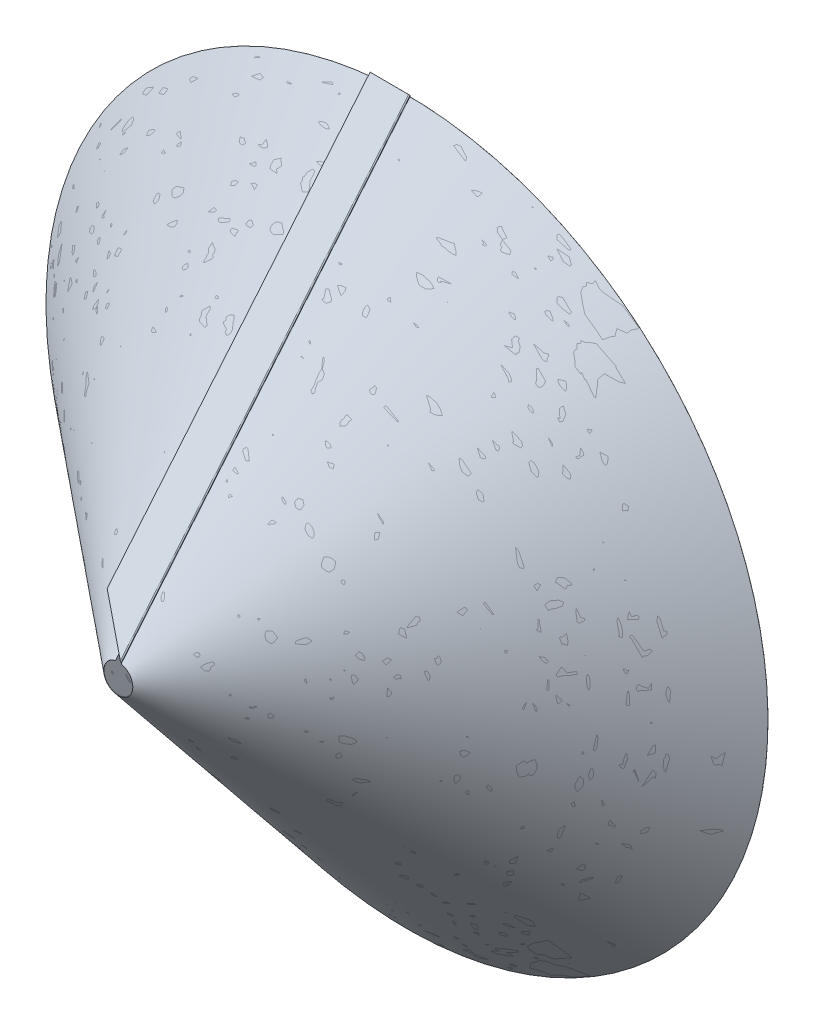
ISO-10303-21;
HEADER;
FILE_DESCRIPTION(('STEP AP214'),'2;1');
FILE_NAME('part.step','',(''),(''),'','','');
FILE_SCHEMA(('AUTOMOTIVE_DESIGN { 1 0 10303 214 1 1 1 1 }'));
ENDSEC;
DATA;
#1=APPLICATION_CONTEXT('core data for automotive mechanical design processes');
#2=APPLICATION_PROTOCOL_DEFINITION('international standard','automotive_design',2000,#1);
#3=PRODUCT_CONTEXT('',#1,'mechanical');
#4=PRODUCT('Part','Part','',(#3));
#5=PRODUCT_RELATED_PRODUCT_CATEGORY('part','',(#4));
#6=PRODUCT_DEFINITION_FORMATION('','',#4);
#7=PRODUCT_DEFINITION_CONTEXT('part definition',#1,'design');
#8=PRODUCT_DEFINITION('design','',#6,#7);
#9=PRODUCT_DEFINITION_SHAPE('','',#8);
#10=(LENGTH_UNIT() NAMED_UNIT(*) SI_UNIT(.MILLI.,.METRE.));
#11=(NAMED_UNIT(*) PLANE_ANGLE_UNIT() SI_UNIT($,.RADIAN.));
#12=(NAMED_UNIT(*) SI_UNIT($,.STERADIAN.) SOLID_ANGLE_UNIT());
#13=UNCERTAINTY_MEASURE_WITH_UNIT(LENGTH_MEASURE(1.E-05),#10,'distance_accuracy_value','');
#14=(GEOMETRIC_REPRESENTATION_CONTEXT(3) GLOBAL_UNCERTAINTY_ASSIGNED_CONTEXT((#13)) GLOBAL_UNIT_ASSIGNED_CONTEXT((#10,
#11,#12)) REPRESENTATION_CONTEXT('',''));
#15=CARTESIAN_POINT('',(0.,0.,0.));
#16=DIRECTION('',(0.,0.,1.));
#17=DIRECTION('',(1.,0.,0.));
#18=AXIS2_PLACEMENT_3D('',#15,#16,#17);
#19=CARTESIAN_POINT('',(2.,10.1980390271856,200.));
#20=DIRECTION('',(0.,0.,-1.));
#21=DIRECTION('',(0.,1.,0.));
#22=AXIS2_PLACEMENT_3D('',#19,#20,#21);
#23=PLANE('',#22);
#24=DIRECTION('',(1.,0.,0.));
#25=VECTOR('',#24,1.);
#26=CARTESIAN_POINT('',(2.,10.7979589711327,200.));
#27=LINE('',#26,#25);
#28=CARTESIAN_POINT('',(2.,10.7979589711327,200.));
#29=VERTEX_POINT('',#28);
#30=CARTESIAN_POINT('',(2.1,10.7979589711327,200.));
#31=VERTEX_POINT('',#30);
#32=EDGE_CURVE('E15',#29,#31,#27,.T.);
#33=ORIENTED_EDGE('',*,*,#32,.F.);
#34=DIRECTION('',(0.,1.,0.));
#35=VECTOR('',#34,1.);
#36=CARTESIAN_POINT('',(2.,10.1980390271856,200.));
#37=LINE('',#36,#35);
#38=CARTESIAN_POINT('',(2.,10.1980390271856,200.));
#39=VERTEX_POINT('',#38);
#40=EDGE_CURVE('E543',#39,#29,#37,.T.);
#41=ORIENTED_EDGE('',*,*,#40,.F.);
#42=CARTESIAN_POINT('',(2.1,10.1980390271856,200.));
#43=CARTESIAN_POINT('',(2.,10.1980390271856,200.));
#44=B_SPLINE_CURVE_WITH_KNOTS('',1,(#42,#43),.UNSPECIFIED.,.F.,.F.,(2,2),(0.,1.),.UNSPECIFIED.);
#45=CARTESIAN_POINT('',(2.1,10.1980390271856,200.));
#46=VERTEX_POINT('',#45);
#47=EDGE_CURVE('E153',#39,#46,#44,.F.);
#48=ORIENTED_EDGE('',*,*,#47,.T.);
#49=DIRECTION('',(0.,1.,0.));
#50=VECTOR('',#49,1.);
#51=CARTESIAN_POINT('',(2.1,250.487524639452,200.));
#52=LINE('',#51,#50);
#53=EDGE_CURVE('E545',#46,#31,#52,.T.);
#54=ORIENTED_EDGE('',*,*,#53,.T.);
#55=EDGE_LOOP('',(#33,#41,#48,#54));
#56=FACE_BOUND('',#55,.T.);
#57=ADVANCED_FACE('F143',(#56),#23,.F.);
#58=CARTESIAN_POINT('',(2.1,10.1980390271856,200.));
#59=CARTESIAN_POINT('',(2.1,10.1705327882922,200.008296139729));
#60=CARTESIAN_POINT('',(2.10185060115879,10.1395321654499,200.017116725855));
#61=CARTESIAN_POINT('',(2.11146528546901,10.0762580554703,200.03527048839));
#62=CARTESIAN_POINT('',(2.1211395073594,10.0414332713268,200.041489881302));
#63=CARTESIAN_POINT('',(2.14419912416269,9.98104159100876,200.053721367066));
#64=CARTESIAN_POINT('',(2.15935294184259,9.95377495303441,200.057690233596));
#65=CARTESIAN_POINT('',(2.19130838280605,9.90771182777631,200.063772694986));
#66=CARTESIAN_POINT('',(2.20769019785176,9.88901326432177,200.066004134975));
#67=CARTESIAN_POINT('',(2.25775592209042,9.84096257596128,200.070585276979));
#68=CARTESIAN_POINT('',(2.28776707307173,9.82116446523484,200.072637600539));
#69=CARTESIAN_POINT('',(2.33174425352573,9.79887284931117,200.074209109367));
#70=CARTESIAN_POINT('',(2.34551700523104,9.7928283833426,200.074664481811));
#71=CARTESIAN_POINT('',(2.36522298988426,9.78532513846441,200.075227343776));
#72=CARTESIAN_POINT('',(2.37163344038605,9.78308481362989,200.075395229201));
#73=CARTESIAN_POINT('',(2.38106369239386,9.78005350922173,200.075617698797));
#74=CARTESIAN_POINT('',(2.38417621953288,9.77909793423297,200.075687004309));
#75=CARTESIAN_POINT('',(2.38880505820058,9.77773807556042,200.075784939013));
#76=CARTESIAN_POINT('',(2.39034156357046,9.77729788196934,200.075815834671));
#77=CARTESIAN_POINT('',(2.39263649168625,9.77665230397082,200.075863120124));
#78=CARTESIAN_POINT('',(2.39295855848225,9.7764852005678,200.075932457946));
#79=CARTESIAN_POINT('',(2.43117051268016,9.76706847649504,200.075967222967));
#80=CARTESIAN_POINT('',(2.45006305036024,9.76241554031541,200.075983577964));
#81=CARTESIAN_POINT('',(2.50630329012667,9.74856795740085,200.07603181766));
#82=CARTESIAN_POINT('',(2.54290003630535,9.7394584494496,200.076145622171));
#83=CARTESIAN_POINT('',(2.99652453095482,9.62868789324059,200.075786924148));
#84=CARTESIAN_POINT('',(3.5787990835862,9.42691890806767,200.075992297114));
#85=CARTESIAN_POINT('',(4.70080391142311,8.92066656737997,200.076053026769));
#86=CARTESIAN_POINT('',(5.2385697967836,8.61645396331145,200.076082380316));
#87=CARTESIAN_POINT('',(6.75402920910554,7.56334726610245,200.076147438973));
#88=CARTESIAN_POINT('',(7.63341311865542,6.67427551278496,200.076217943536));
#89=CARTESIAN_POINT('',(9.01520802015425,4.64099558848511,200.076299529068));
#90=CARTESIAN_POINT('',(9.51727461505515,3.49718735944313,200.076361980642));
#91=CARTESIAN_POINT('',(10.0788667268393,1.10614647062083,200.076434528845));
#92=CARTESIAN_POINT('',(10.1382226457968,-0.140586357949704,200.076488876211));
#93=CARTESIAN_POINT('',(9.80739712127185,-2.57234437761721,200.076551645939));
#94=CARTESIAN_POINT('',(9.41724319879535,-3.75684464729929,200.076597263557));
#95=CARTESIAN_POINT('',(8.23974405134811,-5.90794844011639,200.076649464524));
#96=CARTESIAN_POINT('',(7.45261767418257,-6.87407950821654,200.07668592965));
#97=CARTESIAN_POINT('',(5.58550486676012,-8.46142070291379,200.076726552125));
#98=CARTESIAN_POINT('',(4.50589719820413,-9.08227399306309,200.076753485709));
#99=CARTESIAN_POINT('',(2.19647241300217,-9.89775972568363,200.076781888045));
#100=CARTESIAN_POINT('',(0.967137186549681,-10.0922025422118,200.076798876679));
#101=CARTESIAN_POINT('',(-1.47988060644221,-10.0298335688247,200.076814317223));
#102=CARTESIAN_POINT('',(-2.69704767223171,-9.77302520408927,200.076821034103));
#103=CARTESIAN_POINT('',(-4.95978708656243,-8.84231894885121,200.076822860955));
#104=CARTESIAN_POINT('',(-6.00488209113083,-8.16861624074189,200.07681895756));
#105=CARTESIAN_POINT('',(-7.78630553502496,-6.49297853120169,200.076806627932));
#106=CARTESIAN_POINT('',(-8.5222638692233,-5.49140176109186,200.076791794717));
#107=CARTESIAN_POINT('',(-9.58906554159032,-3.29165547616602,200.07676475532));
#108=CARTESIAN_POINT('',(-9.91969940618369,-2.09395511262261,200.076738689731));
#109=CARTESIAN_POINT('',(-10.1326118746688,0.340887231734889,200.076696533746));
#110=CARTESIAN_POINT('',(-10.0148707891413,1.57751353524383,200.076658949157));
#111=CARTESIAN_POINT('',(-9.34660843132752,3.92793020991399,200.076601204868));
#112=CARTESIAN_POINT('',(-8.7962602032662,5.0412344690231,200.076551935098));
#113=CARTESIAN_POINT('',(-7.3348480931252,6.99930776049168,200.076478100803));
#114=CARTESIAN_POINT('',(-6.42412583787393,7.84369194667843,200.076416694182));
#115=CARTESIAN_POINT('',(-4.3613946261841,9.15267006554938,200.076327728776));
#116=CARTESIAN_POINT('',(-3.20985763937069,9.61702556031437,200.076254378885));
#117=CARTESIAN_POINT('',(-2.01295146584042,9.86140793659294,200.076200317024));
#118=CARTESIAN_POINT('',(2.,10.1980390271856,200.));
#119=CARTESIAN_POINT('',(2.,10.1636674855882,200.));
#120=CARTESIAN_POINT('',(2.00355597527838,10.1252855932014,200.));
#121=CARTESIAN_POINT('',(2.02173204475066,10.0469030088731,200.));
#122=CARTESIAN_POINT('',(2.03635213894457,10.0069023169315,200.));
#123=CARTESIAN_POINT('',(2.07196471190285,9.93633253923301,200.));
#124=CARTESIAN_POINT('',(2.09295719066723,9.90576345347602,200.));
#125=CARTESIAN_POINT('',(2.13511251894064,9.854638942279,200.));
#126=CARTESIAN_POINT('',(2.15627536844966,9.83408351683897,200.));
#127=CARTESIAN_POINT('',(2.21730641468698,9.78221917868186,200.));
#128=CARTESIAN_POINT('',(2.25471710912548,9.76071220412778,200.));
#129=CARTESIAN_POINT('',(2.30559025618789,9.73710938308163,200.));
#130=CARTESIAN_POINT('',(2.32167415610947,9.73068471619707,200.));
#131=CARTESIAN_POINT('',(2.34468790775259,9.72271178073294,200.));
#132=CARTESIAN_POINT('',(2.35217380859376,9.72033147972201,200.));
#133=CARTESIAN_POINT('',(2.3631494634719,9.71711450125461,200.));
#134=CARTESIAN_POINT('',(2.36676581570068,9.71610108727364,200.));
#135=CARTESIAN_POINT('',(2.37213014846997,9.7146615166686,200.));
#136=CARTESIAN_POINT('',(2.37390822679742,9.71419508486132,200.));
#137=CARTESIAN_POINT('',(2.37656068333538,9.71351459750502,200.));
#138=CARTESIAN_POINT('',(2.3774423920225,9.71329096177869,200.));
#139=CARTESIAN_POINT('',(2.41568112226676,9.70390946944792,200.));
#140=CARTESIAN_POINT('',(2.43458006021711,9.69927463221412,200.));
#141=CARTESIAN_POINT('',(2.49083663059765,9.68548114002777,200.));
#142=CARTESIAN_POINT('',(2.52819426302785,9.67632248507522,200.));
#143=CARTESIAN_POINT('',(2.97516695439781,9.56674928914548,200.));
#144=CARTESIAN_POINT('',(3.55566922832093,9.36604376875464,200.));
#145=CARTESIAN_POINT('',(4.67050277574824,8.86310459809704,200.));
#146=CARTESIAN_POINT('',(5.20483404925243,8.56087094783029,200.));
#147=CARTESIAN_POINT('',(6.71045176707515,7.51469567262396,200.));
#148=CARTESIAN_POINT('',(7.58436210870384,6.63127972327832,200.));
#149=CARTESIAN_POINT('',(8.95725612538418,4.61126724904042,200.));
#150=CARTESIAN_POINT('',(9.45623980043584,3.47467072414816,200.));
#151=CARTESIAN_POINT('',(10.0142738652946,1.0991518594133,200.));
#152=CARTESIAN_POINT('',(10.0733242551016,-0.139770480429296,200.));
#153=CARTESIAN_POINT('',(9.74471230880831,-2.5558073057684,200.));
#154=CARTESIAN_POINT('',(9.35704997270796,-3.73292179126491,200.));
#155=CARTESIAN_POINT('',(8.1872072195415,-5.87016737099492,200.));
#156=CARTESIAN_POINT('',(7.4050268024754,-6.83029846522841,200.));
#157=CARTESIAN_POINT('',(5.54998214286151,-8.4074431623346,200.));
#158=CARTESIAN_POINT('',(4.47711790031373,-9.02445676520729,200.));
#159=CARTESIAN_POINT('',(2.18257497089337,-9.83472338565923,200.));
#160=CARTESIAN_POINT('',(0.960896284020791,-10.0279764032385,200.));
#161=CARTESIAN_POINT('',(-1.47037741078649,-9.96602711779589,200.));
#162=CARTESIAN_POINT('',(-2.67997241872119,-9.71082481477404,200.));
#163=CARTESIAN_POINT('',(-4.9281574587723,-8.78610739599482,200.));
#164=CARTESIAN_POINT('',(-5.96674749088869,-8.11659228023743,200.));
#165=CARTESIAN_POINT('',(-7.73669992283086,-6.45172422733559,200.));
#166=CARTESIAN_POINT('',(-8.46806232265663,-5.45637129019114,200.));
#167=CARTESIAN_POINT('',(-9.52796762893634,-3.27077154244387,200.));
#168=CARTESIAN_POINT('',(-9.85651053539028,-2.08052473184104,200.));
#169=CARTESIAN_POINT('',(-10.0680008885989,0.338629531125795,200.));
#170=CARTESIAN_POINT('',(-9.95094833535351,1.5675369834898,200.));
#171=CARTESIAN_POINT('',(-9.28693397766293,3.90276235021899,200.));
#172=CARTESIAN_POINT('',(-8.7399721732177,5.00908026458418,200.));
#173=CARTESIAN_POINT('',(-7.28794217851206,6.95443717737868,200.));
#174=CARTESIAN_POINT('',(-6.38287398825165,7.79347617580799,200.));
#175=CARTESIAN_POINT('',(-4.33347376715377,9.09387080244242,200.));
#176=CARTESIAN_POINT('',(-3.18914173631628,9.55522643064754,200.));
#177=CARTESIAN_POINT('',(-2.,9.79795897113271,200.));
#178=B_SPLINE_SURFACE_WITH_KNOTS('',1,3,((#58,#59,#60,#61,#62,#63,#64,#65,#66,#67,#68,#69,#70,
#71,#72,#73,#74,#75,#76,#77,#78,#79,#80,#81,#82,#83,#84,#85,#86,#87,#88,#89,#90,#91,#92,#93,#94,
#95,#96,#97,#98,#99,#100,#101,#102,#103,#104,#105,#106,#107,#108,#109,#110,#111,#112,#113,#114,
#115,#116,#117),(#118,#119,#120,#121,#122,#123,#124,#125,#126,#127,#128,#129,#130,#131,#132,
#133,#134,#135,#136,#137,#138,#139,#140,#141,#142,#143,#144,#145,#146,#147,#148,#149,#150,#151,
#152,#153,#154,#155,#156,#157,#158,#159,#160,#161,#162,#163,#164,#165,#166,#167,#168,#169,#170,
#171,#172,#173,#174,#175,#176,#177)),.UNSPECIFIED.,.F.,.F.,.F.,(2,2),(4,2,2,2,2,2,2,2,2,2,2,2,2,
2,2,2,2,2,2,2,2,2,2,2,2,2,2,2,2,4),(0.,1.),(0.,0.0625,0.125,0.1875,0.25,0.375,0.4375,0.46875,
0.484375,0.4921875,0.49609375,0.498046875,0.5,0.515625,0.53125,0.5625,0.59375,0.625,0.65625,
0.6875,0.71875,0.75,0.78125,0.8125,0.84375,0.875,0.90625,0.9375,0.96875,1.),.UNSPECIFIED.);
#179=CARTESIAN_POINT('',(2.,10.1980390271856,200.));
#180=CARTESIAN_POINT('',(2.,10.1636674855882,200.));
#181=CARTESIAN_POINT('',(2.00355597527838,10.1252855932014,200.));
#182=CARTESIAN_POINT('',(2.02173204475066,10.0469030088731,200.));
#183=CARTESIAN_POINT('',(2.03635213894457,10.0069023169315,200.));
#184=CARTESIAN_POINT('',(2.07196471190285,9.93633253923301,200.));
#185=CARTESIAN_POINT('',(2.09295719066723,9.90576345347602,200.));
#186=CARTESIAN_POINT('',(2.13511251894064,9.854638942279,200.));
#187=CARTESIAN_POINT('',(2.15627536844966,9.83408351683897,200.));
#188=CARTESIAN_POINT('',(2.21730641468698,9.78221917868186,200.));
#189=CARTESIAN_POINT('',(2.25471710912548,9.76071220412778,200.));
#190=CARTESIAN_POINT('',(2.30559025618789,9.73710938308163,200.));
#191=CARTESIAN_POINT('',(2.32167415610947,9.73068471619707,200.));
#192=CARTESIAN_POINT('',(2.34468790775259,9.72271178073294,200.));
#193=CARTESIAN_POINT('',(2.35217380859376,9.72033147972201,200.));
#194=CARTESIAN_POINT('',(2.3631494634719,9.71711450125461,200.));
#195=CARTESIAN_POINT('',(2.36676581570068,9.71610108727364,200.));
#196=CARTESIAN_POINT('',(2.37213014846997,9.7146615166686,200.));
#197=CARTESIAN_POINT('',(2.37390822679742,9.71419508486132,200.));
#198=CARTESIAN_POINT('',(2.37656068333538,9.71351459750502,200.));
#199=CARTESIAN_POINT('',(2.3774423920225,9.71329096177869,200.));
#200=CARTESIAN_POINT('',(2.41568112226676,9.70390946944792,200.));
#201=CARTESIAN_POINT('',(2.43458006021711,9.69927463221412,200.));
#202=CARTESIAN_POINT('',(2.49083663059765,9.68548114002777,200.));
#203=CARTESIAN_POINT('',(2.52819426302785,9.67632248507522,200.));
#204=CARTESIAN_POINT('',(2.97516695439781,9.56674928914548,200.));
#205=CARTESIAN_POINT('',(3.55566922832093,9.36604376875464,200.));
#206=CARTESIAN_POINT('',(4.67050277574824,8.86310459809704,200.));
#207=CARTESIAN_POINT('',(5.20483404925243,8.56087094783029,200.));
#208=CARTESIAN_POINT('',(6.71045176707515,7.51469567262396,200.));
#209=CARTESIAN_POINT('',(7.58436210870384,6.63127972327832,200.));
#210=CARTESIAN_POINT('',(8.95725612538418,4.61126724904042,200.));
#211=CARTESIAN_POINT('',(9.45623980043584,3.47467072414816,200.));
#212=CARTESIAN_POINT('',(10.0142738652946,1.0991518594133,200.));
#213=CARTESIAN_POINT('',(10.0733242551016,-0.139770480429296,200.));
#214=CARTESIAN_POINT('',(9.74471230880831,-2.5558073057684,200.));
#215=CARTESIAN_POINT('',(9.35704997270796,-3.73292179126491,200.));
#216=CARTESIAN_POINT('',(8.1872072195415,-5.87016737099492,200.));
#217=CARTESIAN_POINT('',(7.4050268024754,-6.83029846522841,200.));
#218=CARTESIAN_POINT('',(5.54998214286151,-8.4074431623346,200.));
#219=CARTESIAN_POINT('',(4.47711790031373,-9.02445676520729,200.));
#220=CARTESIAN_POINT('',(2.18257497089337,-9.83472338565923,200.));
#221=CARTESIAN_POINT('',(0.960896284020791,-10.0279764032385,200.));
#222=CARTESIAN_POINT('',(-1.47037741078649,-9.96602711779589,200.));
#223=CARTESIAN_POINT('',(-2.67997241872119,-9.71082481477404,200.));
#224=CARTESIAN_POINT('',(-4.9281574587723,-8.78610739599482,200.));
#225=CARTESIAN_POINT('',(-5.96674749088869,-8.11659228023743,200.));
#226=CARTESIAN_POINT('',(-7.73669992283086,-6.45172422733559,200.));
#227=CARTESIAN_POINT('',(-8.46806232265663,-5.45637129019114,200.));
#228=CARTESIAN_POINT('',(-9.52796762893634,-3.27077154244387,200.));
#229=CARTESIAN_POINT('',(-9.85651053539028,-2.08052473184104,200.));
#230=CARTESIAN_POINT('',(-10.0680008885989,0.338629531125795,200.));
#231=CARTESIAN_POINT('',(-9.95094833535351,1.5675369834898,200.));
#232=CARTESIAN_POINT('',(-9.28693397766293,3.90276235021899,200.));
#233=CARTESIAN_POINT('',(-8.7399721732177,5.00908026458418,200.));
#234=CARTESIAN_POINT('',(-7.28794217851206,6.95443717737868,200.));
#235=CARTESIAN_POINT('',(-6.38287398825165,7.79347617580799,200.));
#236=CARTESIAN_POINT('',(-4.33347376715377,9.09387080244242,200.));
#237=CARTESIAN_POINT('',(-3.18914173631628,9.55522643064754,200.));
#238=CARTESIAN_POINT('',(-2.,9.79795897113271,200.));
#239=B_SPLINE_CURVE_WITH_KNOTS('',3,(#179,#180,#181,#182,#183,#184,#185,#186,#187,#188,#189,
#190,#191,#192,#193,#194,#195,#196,#197,#198,#199,#200,#201,#202,#203,#204,#205,#206,#207,#208,
#209,#210,#211,#212,#213,#214,#215,#216,#217,#218,#219,#220,#221,#222,#223,#224,#225,#226,#227,
#228,#229,#230,#231,#232,#233,#234,#235,#236,#237,#238),.UNSPECIFIED.,.F.,.F.,(4,2,2,2,2,2,2,2,
2,2,2,2,2,2,2,2,2,2,2,2,2,2,2,2,2,2,2,2,2,4),(0.,0.0625,0.125,0.1875,0.25,0.375,0.4375,0.46875,
0.484375,0.4921875,0.49609375,0.498046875,0.5,0.515625,0.53125,0.5625,0.59375,0.625,0.65625,
0.6875,0.71875,0.75,0.78125,0.8125,0.84375,0.875,0.90625,0.9375,0.96875,1.),.UNSPECIFIED.);
#240=CARTESIAN_POINT('',(-2.,9.79795897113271,200.));
#241=VERTEX_POINT('',#240);
#242=EDGE_CURVE('E502',#39,#241,#239,.T.);
#243=CARTESIAN_POINT('',(-2.,9.79795897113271,200.));
#244=CARTESIAN_POINT('',(-2.01295146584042,9.86140793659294,200.076200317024));
#245=B_SPLINE_CURVE_WITH_KNOTS('',1,(#243,#244),.UNSPECIFIED.,.F.,.F.,(2,2),(0.,1.),.UNSPECIFIED.);
#246=CARTESIAN_POINT('',(-2.01295152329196,9.86140792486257,200.076200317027));
#247=VERTEX_POINT('',#246);
#248=EDGE_CURVE('E195',#241,#247,#245,.T.);
#249=CARTESIAN_POINT('',(2.1,10.1980390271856,200.));
#250=CARTESIAN_POINT('',(2.10000116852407,10.1909650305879,200.002124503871));
#251=CARTESIAN_POINT('',(2.10012077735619,10.1838818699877,200.004219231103));
#252=CARTESIAN_POINT('',(2.10061463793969,10.1693640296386,200.008470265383));
#253=CARTESIAN_POINT('',(2.10100110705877,10.1619291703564,200.010624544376));
#254=CARTESIAN_POINT('',(2.10206694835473,10.1468055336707,200.014988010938));
#255=CARTESIAN_POINT('',(2.10275635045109,10.1391172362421,200.017196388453));
#256=CARTESIAN_POINT('',(2.10444559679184,10.1235823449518,200.021697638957));
#257=CARTESIAN_POINT('',(2.10545294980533,10.1157367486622,200.023991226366));
#258=CARTESIAN_POINT('',(2.10727284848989,10.1038935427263,200.027317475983));
#259=CARTESIAN_POINT('',(2.10793921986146,10.0998930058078,200.02841759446));
#260=CARTESIAN_POINT('',(2.1094136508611,10.0918164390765,200.030518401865));
#261=CARTESIAN_POINT('',(2.11022393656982,10.0877402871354,200.031517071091));
#262=CARTESIAN_POINT('',(2.11197143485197,10.079552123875,200.033455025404));
#263=CARTESIAN_POINT('',(2.11290994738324,10.0754402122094,200.034393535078));
#264=CARTESIAN_POINT('',(2.11490740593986,10.0672110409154,200.036216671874));
#265=CARTESIAN_POINT('',(2.11596692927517,10.0630938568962,200.037101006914));
#266=CARTESIAN_POINT('',(2.11930324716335,10.0508128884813,200.039681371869));
#267=CARTESIAN_POINT('',(2.12174616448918,10.0426807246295,200.041313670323));
#268=CARTESIAN_POINT('',(2.12695214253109,10.0267549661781,200.044506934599));
#269=CARTESIAN_POINT('',(2.12970488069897,10.0189581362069,200.046068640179));
#270=CARTESIAN_POINT('',(2.1341081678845,10.0074900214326,200.04835163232));
#271=CARTESIAN_POINT('',(2.1355968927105,10.0037605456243,200.049091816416));
#272=CARTESIAN_POINT('',(2.13868450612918,9.99639878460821,200.050496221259));
#273=CARTESIAN_POINT('',(2.14028146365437,9.99276587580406,200.051161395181));
#274=CARTESIAN_POINT('',(2.14356747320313,9.98560262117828,200.052436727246));
#275=CARTESIAN_POINT('',(2.14525470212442,9.98207155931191,200.053047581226));
#276=CARTESIAN_POINT('',(2.14871382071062,9.9751176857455,200.054215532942));
#277=CARTESIAN_POINT('',(2.15048380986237,9.97169405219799,200.054773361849));
#278=CARTESIAN_POINT('',(2.15409718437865,9.96496039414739,200.055841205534));
#279=CARTESIAN_POINT('',(2.15593863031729,9.96164943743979,200.056351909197));
#280=CARTESIAN_POINT('',(2.15968319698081,9.95514620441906,200.057330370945));
#281=CARTESIAN_POINT('',(2.16158433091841,9.95195288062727,200.05779878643));
#282=CARTESIAN_POINT('',(2.16729532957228,9.94267047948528,200.059127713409));
#283=CARTESIAN_POINT('',(2.17123391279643,9.93665420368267,200.059947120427));
#284=CARTESIAN_POINT('',(2.17920744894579,9.92514993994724,200.061473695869));
#285=CARTESIAN_POINT('',(2.18322587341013,9.91965093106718,200.06218452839));
#286=CARTESIAN_POINT('',(2.19132504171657,9.90915378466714,200.063506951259));
#287=CARTESIAN_POINT('',(2.19539089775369,9.90414459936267,200.06412181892));
#288=CARTESIAN_POINT('',(2.20357995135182,9.89457393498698,200.065254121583));
#289=CARTESIAN_POINT('',(2.20769103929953,9.89000250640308,200.065774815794));
#290=CARTESIAN_POINT('',(2.21597188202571,9.88126249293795,200.066712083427));
#291=CARTESIAN_POINT('',(2.22013191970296,9.87708505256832,200.067132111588));
#292=CARTESIAN_POINT('',(2.22842562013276,9.86910024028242,200.06791145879));
#293=CARTESIAN_POINT('',(2.23255129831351,9.86528470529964,200.068272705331));
#294=CARTESIAN_POINT('',(2.24071044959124,9.85801124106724,200.068973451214));
#295=CARTESIAN_POINT('',(2.2447366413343,9.85454516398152,200.069313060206));
#296=CARTESIAN_POINT('',(2.25271294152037,9.84794783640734,200.069957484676));
#297=CARTESIAN_POINT('',(2.25665630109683,9.84480853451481,200.070263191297));
#298=CARTESIAN_POINT('',(2.26447397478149,9.83883329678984,200.070841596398));
#299=CARTESIAN_POINT('',(2.26834261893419,9.83599003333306,200.071115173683));
#300=CARTESIAN_POINT('',(2.27602064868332,9.83057783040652,200.071628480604));
#301=CARTESIAN_POINT('',(2.27982534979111,9.82800234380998,200.07186916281));
#302=CARTESIAN_POINT('',(2.28738534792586,9.82309699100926,200.072316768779));
#303=CARTESIAN_POINT('',(2.2911369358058,9.82076149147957,200.072524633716));
#304=CARTESIAN_POINT('',(2.29860000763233,9.8163058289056,200.072909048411));
#305=CARTESIAN_POINT('',(2.30230872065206,9.81418110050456,200.073086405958));
#306=CARTESIAN_POINT('',(2.30969915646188,9.81012388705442,200.073405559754));
#307=CARTESIAN_POINT('',(2.31337883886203,9.80818773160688,200.07354819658));
#308=CARTESIAN_POINT('',(2.32411102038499,9.80273139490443,200.073945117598));
#309=CARTESIAN_POINT('',(2.33123268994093,9.79934558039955,200.074184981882));
#310=CARTESIAN_POINT('',(2.34510525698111,9.79320397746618,200.074634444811));
#311=CARTESIAN_POINT('',(2.35184356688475,9.79041992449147,200.074844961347));
#312=CARTESIAN_POINT('',(2.36188454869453,9.78659607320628,200.075132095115));
#313=CARTESIAN_POINT('',(2.36513106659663,9.78540874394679,200.075220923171));
#314=CARTESIAN_POINT('',(2.37155452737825,9.78315650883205,200.075389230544));
#315=CARTESIAN_POINT('',(2.37473053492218,9.7820889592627,200.075468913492));
#316=CARTESIAN_POINT('',(2.38102190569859,9.7800672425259,200.07561610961));
#317=CARTESIAN_POINT('',(2.38413652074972,9.7791107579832,200.075683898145));
#318=CARTESIAN_POINT('',(2.38879575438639,9.77774023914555,200.075785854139));
#319=CARTESIAN_POINT('',(2.3903320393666,9.77729804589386,200.075819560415));
#320=CARTESIAN_POINT('',(2.40066033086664,9.77440950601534,200.07600605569));
#321=CARTESIAN_POINT('',(2.40955315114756,9.77233102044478,200.07597218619));
#322=CARTESIAN_POINT('',(2.43838771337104,9.76543532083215,200.075918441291));
#323=CARTESIAN_POINT('',(2.45827771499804,9.76043526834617,200.075968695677));
#324=CARTESIAN_POINT('',(2.5165339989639,9.74596732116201,200.076082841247));
#325=CARTESIAN_POINT('',(2.55494219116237,9.73665274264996,200.076116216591));
#326=CARTESIAN_POINT('',(2.61921572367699,9.72073188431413,200.076098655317));
#327=CARTESIAN_POINT('',(2.64510680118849,9.71422759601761,200.076071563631));
#328=CARTESIAN_POINT('',(2.69817055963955,9.70038697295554,200.076032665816));
#329=CARTESIAN_POINT('',(2.72533649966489,9.6930246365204,200.076021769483));
#330=CARTESIAN_POINT('',(2.81052430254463,9.66933364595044,200.075990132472));
#331=CARTESIAN_POINT('',(2.86836707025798,9.65236406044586,200.075972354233));
#332=CARTESIAN_POINT('',(3.05401057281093,9.59559702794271,200.075933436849));
#333=CARTESIAN_POINT('',(3.18102182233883,9.55321887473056,200.075934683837));
#334=CARTESIAN_POINT('',(3.44518670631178,9.45948611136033,200.075950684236));
#335=CARTESIAN_POINT('',(3.58217171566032,9.40766218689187,200.075966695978));
#336=CARTESIAN_POINT('',(3.85990347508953,9.29635528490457,200.075997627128));
#337=CARTESIAN_POINT('',(4.00055673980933,9.23663801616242,200.076012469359));
#338=CARTESIAN_POINT('',(4.2800340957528,9.11050161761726,200.076032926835));
#339=CARTESIAN_POINT('',(4.41883813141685,9.04403794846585,200.076038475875));
#340=CARTESIAN_POINT('',(4.69324109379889,8.90484397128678,200.07605171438));
#341=CARTESIAN_POINT('',(4.82884049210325,8.83211459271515,200.076059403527));
#342=CARTESIAN_POINT('',(5.09655080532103,8.68053883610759,200.076073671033));
#343=CARTESIAN_POINT('',(5.22866222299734,8.60169334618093,200.076080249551));
#344=CARTESIAN_POINT('',(5.48910166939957,8.43801403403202,200.076092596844));
#345=CARTESIAN_POINT('',(5.61743013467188,8.35318090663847,200.076098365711));
#346=CARTESIAN_POINT('',(5.87000230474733,8.17766522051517,200.076109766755));
#347=CARTESIAN_POINT('',(5.99424644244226,8.08698328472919,200.076115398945));
#348=CARTESIAN_POINT('',(6.23841637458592,7.90000709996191,200.076127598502));
#349=CARTESIAN_POINT('',(6.35834260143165,7.80371341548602,200.076134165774));
#350=CARTESIAN_POINT('',(6.59365317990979,7.60574688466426,200.076147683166));
#351=CARTESIAN_POINT('',(6.70903788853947,7.50407446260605,200.076154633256));
#352=CARTESIAN_POINT('',(6.93504105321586,7.29558282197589,200.076168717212));
#353=CARTESIAN_POINT('',(7.04565991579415,7.1887640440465,200.076175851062));
#354=CARTESIAN_POINT('',(7.26190698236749,6.97021172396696,200.076189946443));
#355=CARTESIAN_POINT('',(7.36753572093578,6.85847871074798,200.076196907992));
#356=CARTESIAN_POINT('',(7.5735776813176,6.63032942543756,200.076210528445));
#357=CARTESIAN_POINT('',(7.67399158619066,6.51391377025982,200.076217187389));
#358=CARTESIAN_POINT('',(7.86937866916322,6.2766305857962,200.076230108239));
#359=CARTESIAN_POINT('',(7.96435262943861,6.15576370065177,200.076236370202));
#360=CARTESIAN_POINT('',(8.14863497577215,5.90980929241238,200.076248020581));
#361=CARTESIAN_POINT('',(8.23794411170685,5.78472233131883,200.076253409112));
#362=CARTESIAN_POINT('',(8.41066523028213,5.53056612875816,200.076264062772));
#363=CARTESIAN_POINT('',(8.49407801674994,5.40149743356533,200.076269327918));
#364=CARTESIAN_POINT('',(8.65487357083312,5.13968083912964,200.076280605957));
#365=CARTESIAN_POINT('',(8.73225710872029,5.00693341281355,200.076286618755));
#366=CARTESIAN_POINT('',(8.88086895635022,4.73805448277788,200.076298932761));
#367=CARTESIAN_POINT('',(8.9520978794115,4.60192331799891,200.076305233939));
#368=CARTESIAN_POINT('',(9.08827436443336,4.32657171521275,200.076317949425));
#369=CARTESIAN_POINT('',(9.15322254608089,4.18735158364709,200.076324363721));
#370=CARTESIAN_POINT('',(9.27671123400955,3.90611653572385,200.076336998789));
#371=CARTESIAN_POINT('',(9.33525245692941,3.76410193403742,200.076343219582));
#372=CARTESIAN_POINT('',(9.44580033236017,3.4775721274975,200.076355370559));
#373=CARTESIAN_POINT('',(9.49780780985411,3.33305724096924,200.076361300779));
#374=CARTESIAN_POINT('',(9.59516095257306,3.04182106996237,200.076372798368));
#375=CARTESIAN_POINT('',(9.64050747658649,2.8951000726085,200.076378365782));
#376=CARTESIAN_POINT('',(9.72441170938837,2.59974560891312,200.076388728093));
#377=CARTESIAN_POINT('',(9.76297014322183,2.45111234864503,200.076393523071));
#378=CARTESIAN_POINT('',(9.83316759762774,2.15223681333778,200.076402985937));
#379=CARTESIAN_POINT('',(9.86480732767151,2.00199470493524,200.076407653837));
#380=CARTESIAN_POINT('',(9.92115189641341,1.70023162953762,200.076417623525));
#381=CARTESIAN_POINT('',(9.94585740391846,1.54871078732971,200.076422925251));
#382=CARTESIAN_POINT('',(9.98832199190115,1.24471058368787,200.076433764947));
#383=CARTESIAN_POINT('',(10.0060815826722,1.09223129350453,200.076439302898));
#384=CARTESIAN_POINT('',(10.0346418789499,0.7866345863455,200.076450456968));
#385=CARTESIAN_POINT('',(10.0454431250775,0.633517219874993,200.07645607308));
#386=CARTESIAN_POINT('',(10.0600739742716,0.326964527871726,200.076467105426));
#387=CARTESIAN_POINT('',(10.0639042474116,0.173529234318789,200.076472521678));
#388=CARTESIAN_POINT('',(10.0645797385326,-0.13333921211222,200.076483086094));
#389=CARTESIAN_POINT('',(10.0614257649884,-0.28677236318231,200.076488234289));
#390=CARTESIAN_POINT('',(10.0481190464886,-0.593316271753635,200.076498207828));
#391=CARTESIAN_POINT('',(10.0379671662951,-0.746427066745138,200.076503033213));
#392=CARTESIAN_POINT('',(10.0106509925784,-1.05200633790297,200.076512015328));
#393=CARTESIAN_POINT('',(9.99348744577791,-1.20447488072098,200.07651617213));
#394=CARTESIAN_POINT('',(9.95213451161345,-1.50843975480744,200.076524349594));
#395=CARTESIAN_POINT('',(9.92794586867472,-1.65993618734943,200.07652837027));
#396=CARTESIAN_POINT('',(9.87264614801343,-1.96164389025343,200.076536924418));
#397=CARTESIAN_POINT('',(9.84153575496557,-2.11185528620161,200.076541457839));
#398=CARTESIAN_POINT('',(9.7724959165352,-2.41069065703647,200.07655070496));
#399=CARTESIAN_POINT('',(9.73456697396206,-2.55931474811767,200.076555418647));
#400=CARTESIAN_POINT('',(9.65199263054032,-2.85467287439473,200.076564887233));
#401=CARTESIAN_POINT('',(9.60734773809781,-3.00140705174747,200.076569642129));
#402=CARTESIAN_POINT('',(9.51144372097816,-3.29268281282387,200.076578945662));
#403=CARTESIAN_POINT('',(9.46018520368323,-3.43722459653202,200.076583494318));
#404=CARTESIAN_POINT('',(9.35115553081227,-3.72381285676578,200.076592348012));
#405=CARTESIAN_POINT('',(9.2933850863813,-3.86585960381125,200.076596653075));
#406=CARTESIAN_POINT('',(9.17143294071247,-4.1471548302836,200.076604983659));
#407=CARTESIAN_POINT('',(9.10725197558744,-4.2864036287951,200.076609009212));
#408=CARTESIAN_POINT('',(8.9725800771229,-4.56180029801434,200.076616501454));
#409=CARTESIAN_POINT('',(8.90208974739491,-4.69794846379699,200.076619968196));
#410=CARTESIAN_POINT('',(8.75490436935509,-4.96683207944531,200.076626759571));
#411=CARTESIAN_POINT('',(8.67820990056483,-5.09956784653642,200.076630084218));
#412=CARTESIAN_POINT('',(8.51882397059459,-5.36137182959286,200.07663712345));
#413=CARTESIAN_POINT('',(8.43613302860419,-5.49044036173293,200.076640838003));
#414=CARTESIAN_POINT('',(8.26495791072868,-5.74466475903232,200.076648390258));
#415=CARTESIAN_POINT('',(8.17647409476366,-5.869820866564,200.076652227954));
#416=CARTESIAN_POINT('',(7.9939164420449,-6.11597469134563,200.076659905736));
#417=CARTESIAN_POINT('',(7.89984296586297,-6.23697267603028,200.076663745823));
#418=CARTESIAN_POINT('',(7.70630882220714,-6.47456447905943,200.076671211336));
#419=CARTESIAN_POINT('',(7.60684858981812,-6.59115865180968,200.07667483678));
#420=CARTESIAN_POINT('',(7.40274324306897,-6.81969665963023,200.076681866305));
#421=CARTESIAN_POINT('',(7.29809863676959,-6.93164094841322,200.076685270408));
#422=CARTESIAN_POINT('',(7.08382675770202,-7.15063271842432,200.07669184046));
#423=CARTESIAN_POINT('',(6.9741999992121,-7.25768070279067,200.076695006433));
#424=CARTESIAN_POINT('',(6.75016580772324,-7.4666335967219,200.076700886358));
#425=CARTESIAN_POINT('',(6.63575877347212,-7.56853893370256,200.076703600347));
#426=CARTESIAN_POINT('',(6.4023731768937,-7.76695327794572,200.076708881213));
#427=CARTESIAN_POINT('',(6.28339498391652,-7.86346271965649,200.076711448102));
#428=CARTESIAN_POINT('',(6.04115180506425,-8.0509217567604,200.07671685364));
#429=CARTESIAN_POINT('',(5.91788714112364,-8.1418717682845,200.076719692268));
#430=CARTESIAN_POINT('',(5.66734848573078,-8.3180558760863,200.076725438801));
#431=CARTESIAN_POINT('',(5.54007470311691,-8.4032902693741,200.076728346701));
#432=CARTESIAN_POINT('',(5.28179502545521,-8.56788634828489,200.076734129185));
#433=CARTESIAN_POINT('',(5.15078933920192,-8.64724836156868,200.076737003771));
#434=CARTESIAN_POINT('',(4.88532272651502,-8.7999426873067,200.076742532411));
#435=CARTESIAN_POINT('',(4.75086205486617,-8.87327544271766,200.076745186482));
#436=CARTESIAN_POINT('',(4.47876200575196,-9.01375369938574,200.07675029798));
#437=CARTESIAN_POINT('',(4.34112292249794,-9.08089977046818,200.076752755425));
#438=CARTESIAN_POINT('',(4.06294261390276,-9.2088468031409,200.076757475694));
#439=CARTESIAN_POINT('',(3.92240167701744,-9.2696483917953,200.076759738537));
#440=CARTESIAN_POINT('',(3.63869393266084,-9.38474865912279,200.076763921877));
#441=CARTESIAN_POINT('',(3.49552733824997,-9.43904786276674,200.076765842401));
#442=CARTESIAN_POINT('',(3.20685370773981,-9.54098181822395,200.076769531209));
#443=CARTESIAN_POINT('',(3.06134685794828,-9.58861709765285,200.076771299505));
#444=CARTESIAN_POINT('',(2.7683163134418,-9.67717220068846,200.076774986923));
#445=CARTESIAN_POINT('',(2.62079276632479,-9.71809251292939,200.076776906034));
#446=CARTESIAN_POINT('',(2.32404288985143,-9.79317084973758,200.076780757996));
#447=CARTESIAN_POINT('',(2.17481664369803,-9.82732920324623,200.076782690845));
#448=CARTESIAN_POINT('',(1.87497547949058,-9.88883607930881,200.076786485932));
#449=CARTESIAN_POINT('',(1.72436063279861,-9.91618494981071,200.076788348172));
#450=CARTESIAN_POINT('',(1.42205613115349,-9.96402499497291,200.076791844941));
#451=CARTESIAN_POINT('',(1.27036654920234,-9.98451663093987,200.076793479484));
#452=CARTESIAN_POINT('',(0.966226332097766,-10.0185936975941,200.076796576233));
#453=CARTESIAN_POINT('',(0.81377576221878,-10.0321797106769,200.076798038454));
#454=CARTESIAN_POINT('',(0.508427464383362,-10.0523967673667,200.076800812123));
#455=CARTESIAN_POINT('',(0.355529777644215,-10.0590284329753,200.076802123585));
#456=CARTESIAN_POINT('',(0.0496008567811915,-10.0652879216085,200.076804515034));
#457=CARTESIAN_POINT('',(-0.103430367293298,-10.064916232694,200.076805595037));
#458=CARTESIAN_POINT('',(-0.409302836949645,-10.057120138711,200.076807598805));
#459=CARTESIAN_POINT('',(-0.562144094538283,-10.0496962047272,200.07680852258));
#460=CARTESIAN_POINT('',(-0.867316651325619,-10.0278631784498,200.07681040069));
#461=CARTESIAN_POINT('',(-1.01964798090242,-10.0134545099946,200.076811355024));
#462=CARTESIAN_POINT('',(-1.32349097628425,-9.97771983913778,200.076813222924));
#463=CARTESIAN_POINT('',(-1.4750026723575,-9.95639409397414,200.076814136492));
#464=CARTESIAN_POINT('',(-1.77689639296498,-9.90689250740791,200.076815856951));
#465=CARTESIAN_POINT('',(-1.92727846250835,-9.87871694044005,200.076816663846));
#466=CARTESIAN_POINT('',(-2.22660303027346,-9.81558254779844,200.076818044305));
#467=CARTESIAN_POINT('',(-2.37554560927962,-9.78062410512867,200.076818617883));
#468=CARTESIAN_POINT('',(-2.67168115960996,-9.70399016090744,200.076819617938));
#469=CARTESIAN_POINT('',(-2.8188742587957,-9.66231515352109,200.076820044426));
#470=CARTESIAN_POINT('',(-3.11120059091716,-9.57231410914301,200.076820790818));
#471=CARTESIAN_POINT('',(-3.25633398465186,-9.52398859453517,200.076821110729));
#472=CARTESIAN_POINT('',(-3.54423084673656,-9.4207523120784,200.076821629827));
#473=CARTESIAN_POINT('',(-3.6869944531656,-9.36584192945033,200.07682182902));
#474=CARTESIAN_POINT('',(-3.96983245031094,-9.24950545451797,200.076822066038));
#475=CARTESIAN_POINT('',(-4.10990698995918,-9.18807972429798,200.076822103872));
#476=CARTESIAN_POINT('',(-4.38709226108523,-9.05888968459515,200.076822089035));
#477=CARTESIAN_POINT('',(-4.52420314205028,-8.99112569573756,200.07682203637));
#478=CARTESIAN_POINT('',(-4.79519606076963,-8.84943266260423,200.076821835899));
#479=CARTESIAN_POINT('',(-4.92907819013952,-8.77550379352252,200.076821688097));
#480=CARTESIAN_POINT('',(-5.19334809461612,-8.62165414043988,200.076821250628));
#481=CARTESIAN_POINT('',(-5.32373598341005,-8.54173355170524,200.076820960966));
#482=CARTESIAN_POINT('',(-5.58075184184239,-8.37607317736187,200.076820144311));
#483=CARTESIAN_POINT('',(-5.70737999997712,-8.29033368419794,200.07681961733));
#484=CARTESIAN_POINT('',(-5.95661047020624,-8.11320767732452,200.076818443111));
#485=CARTESIAN_POINT('',(-6.07921305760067,-8.02182155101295,200.076817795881));
#486=CARTESIAN_POINT('',(-6.3201261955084,-7.83357438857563,200.076816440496));
#487=CARTESIAN_POINT('',(-6.43843706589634,-7.73671376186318,200.076815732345));
#488=CARTESIAN_POINT('',(-6.67050063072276,-7.53768936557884,200.076814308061));
#489=CARTESIAN_POINT('',(-6.78425357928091,-7.43552589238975,200.076813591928));
#490=CARTESIAN_POINT('',(-7.00692807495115,-7.22607449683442,200.076811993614));
#491=CARTESIAN_POINT('',(-7.11584988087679,-7.11878684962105,200.076811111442));
#492=CARTESIAN_POINT('',(-7.32866902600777,-6.89935005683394,200.076809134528));
#493=CARTESIAN_POINT('',(-7.43256660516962,-6.78720114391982,200.076808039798));
#494=CARTESIAN_POINT('',(-7.63515175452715,-6.55829781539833,200.076805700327));
#495=CARTESIAN_POINT('',(-7.73383945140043,-6.44154351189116,200.07680445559));
#496=CARTESIAN_POINT('',(-7.92581874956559,-6.20368525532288,200.076801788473));
#497=CARTESIAN_POINT('',(-8.01911049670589,-6.08258141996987,200.076800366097));
#498=CARTESIAN_POINT('',(-8.20011159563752,-5.83627957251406,200.076797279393));
#499=CARTESIAN_POINT('',(-8.28782118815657,-5.71108173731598,200.076795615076));
#500=CARTESIAN_POINT('',(-8.45747114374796,-5.45684699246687,200.076792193));
#501=CARTESIAN_POINT('',(-8.53941185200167,-5.32781031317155,200.076790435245));
#502=CARTESIAN_POINT('',(-8.69733694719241,-5.06615302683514,200.076786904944));
#503=CARTESIAN_POINT('',(-8.77332171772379,-4.93353265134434,200.076785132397));
#504=CARTESIAN_POINT('',(-8.91914771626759,-4.66496276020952,200.076781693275));
#505=CARTESIAN_POINT('',(-8.98898921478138,-4.52901339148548,200.076780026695));
#506=CARTESIAN_POINT('',(-9.12233748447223,-4.25404943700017,200.076776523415));
#507=CARTESIAN_POINT('',(-9.18584451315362,-4.11503497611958,200.076774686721));
#508=CARTESIAN_POINT('',(-9.30643708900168,-3.83425493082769,200.076770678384));
#509=CARTESIAN_POINT('',(-9.36352286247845,-3.69248944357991,200.076768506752));
#510=CARTESIAN_POINT('',(-9.47119046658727,-3.40651224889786,200.076763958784));
#511=CARTESIAN_POINT('',(-9.52177237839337,-3.26230057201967,200.076761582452));
#512=CARTESIAN_POINT('',(-9.61634929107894,-2.97173599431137,200.076756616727));
#513=CARTESIAN_POINT('',(-9.6603443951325,-2.82538312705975,200.076754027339));
#514=CARTESIAN_POINT('',(-9.74166437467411,-2.53084088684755,200.076748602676));
#515=CARTESIAN_POINT('',(-9.77898946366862,-2.38265157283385,200.076745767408));
#516=CARTESIAN_POINT('',(-9.84688546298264,-2.08474101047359,200.076740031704));
#517=CARTESIAN_POINT('',(-9.8774567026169,-1.93501983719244,200.076737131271));
#518=CARTESIAN_POINT('',(-9.93176084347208,-1.63435026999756,200.076731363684));
#519=CARTESIAN_POINT('',(-9.95549410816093,-1.48340194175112,200.076728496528));
#520=CARTESIAN_POINT('',(-9.99603783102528,-1.18058248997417,200.076722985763));
#521=CARTESIAN_POINT('',(-10.012848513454,-1.02871139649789,200.076720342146));
#522=CARTESIAN_POINT('',(-10.0394623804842,-0.724360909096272,200.076714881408));
#523=CARTESIAN_POINT('',(-10.0492657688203,-0.571881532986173,200.07671206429));
#524=CARTESIAN_POINT('',(-10.0618960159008,-0.266638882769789,200.076705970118));
#525=CARTESIAN_POINT('',(-10.064723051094,-0.113875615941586,200.076702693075));
#526=CARTESIAN_POINT('',(-10.0634320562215,0.191620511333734,200.076695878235));
#527=CARTESIAN_POINT('',(-10.0593140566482,0.344353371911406,200.076692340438));
#528=CARTESIAN_POINT('',(-10.0441640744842,0.649474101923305,200.076685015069));
#529=CARTESIAN_POINT('',(-10.033132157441,0.801861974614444,200.076681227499));
#530=CARTESIAN_POINT('',(-10.0041849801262,1.10597827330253,200.076673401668));
#531=CARTESIAN_POINT('',(-9.98626991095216,1.25770671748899,200.076669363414));
#532=CARTESIAN_POINT('',(-9.94358642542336,1.56018960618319,200.07666124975));
#533=CARTESIAN_POINT('',(-9.9188183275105,1.71094409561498,200.076657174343));
#534=CARTESIAN_POINT('',(-9.86245864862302,2.01116431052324,200.076649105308));
#535=CARTESIAN_POINT('',(-9.83086742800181,2.16063010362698,200.076645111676));
#536=CARTESIAN_POINT('',(-9.76089092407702,2.45795829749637,200.076637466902));
#537=CARTESIAN_POINT('',(-9.72250587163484,2.60582075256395,200.076633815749));
#538=CARTESIAN_POINT('',(-9.63897466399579,2.89961836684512,200.076626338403));
#539=CARTESIAN_POINT('',(-9.59382872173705,3.04555358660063,200.076622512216));
#540=CARTESIAN_POINT('',(-9.49691982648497,3.33520531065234,200.076614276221));
#541=CARTESIAN_POINT('',(-9.44515703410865,3.47892186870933,200.076609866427));
#542=CARTESIAN_POINT('',(-9.33515516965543,3.76385453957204,200.076600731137));
#543=CARTESIAN_POINT('',(-9.27691608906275,3.90507064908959,200.076596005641));
#544=CARTESIAN_POINT('',(-9.1541021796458,4.1847203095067,200.076586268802));
#545=CARTESIAN_POINT('',(-9.08952734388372,4.32315385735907,200.076581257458));
#546=CARTESIAN_POINT('',(-8.95418198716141,4.59695623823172,200.07657097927));
#547=CARTESIAN_POINT('',(-8.88341154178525,4.73232510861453,200.07656571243));
#548=CARTESIAN_POINT('',(-8.73581446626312,4.99971565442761,200.076555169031));
#549=CARTESIAN_POINT('',(-8.65898799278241,5.13173741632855,200.076549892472));
#550=CARTESIAN_POINT('',(-8.49941833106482,5.39215103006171,200.076539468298));
#551=CARTESIAN_POINT('',(-8.41667530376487,5.52054298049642,200.076534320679));
#552=CARTESIAN_POINT('',(-8.24541149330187,5.77341418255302,200.076524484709));
#553=CARTESIAN_POINT('',(-8.15689073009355,5.89789344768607,200.076519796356));
#554=CARTESIAN_POINT('',(-7.97421744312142,6.14264894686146,200.076510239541));
#555=CARTESIAN_POINT('',(-7.88006491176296,6.26292517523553,200.076505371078));
#556=CARTESIAN_POINT('',(-7.68636674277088,6.49905255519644,200.076494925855));
#557=CARTESIAN_POINT('',(-7.58682110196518,6.61490370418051,200.076489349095));
#558=CARTESIAN_POINT('',(-7.38256880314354,6.84196620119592,200.076477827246));
#559=CARTESIAN_POINT('',(-7.2778620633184,6.95317747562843,200.07647188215));
#560=CARTESIAN_POINT('',(-7.0635196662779,7.17074509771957,200.076459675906));
#561=CARTESIAN_POINT('',(-6.95388398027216,7.27710141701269,200.076453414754));
#562=CARTESIAN_POINT('',(-6.72991536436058,7.48474377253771,200.07644064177));
#563=CARTESIAN_POINT('',(-6.61558251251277,7.58602989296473,200.07643412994));
#564=CARTESIAN_POINT('',(-6.38245083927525,7.78331597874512,200.0764211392));
#565=CARTESIAN_POINT('',(-6.26365219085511,7.87931614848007,200.076414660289));
#566=CARTESIAN_POINT('',(-6.02182027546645,8.06581423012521,200.076401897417));
#567=CARTESIAN_POINT('',(-5.89878721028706,8.15631240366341,200.076395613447));
#568=CARTESIAN_POINT('',(-5.64871733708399,8.33159008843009,200.076383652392));
#569=CARTESIAN_POINT('',(-5.52168065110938,8.41636977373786,200.076377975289));
#570=CARTESIAN_POINT('',(-5.26384349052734,8.57998990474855,200.076366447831));
#571=CARTESIAN_POINT('',(-5.13304312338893,8.65883051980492,200.076360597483));
#572=CARTESIAN_POINT('',(-4.86798013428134,8.81045222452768,200.076348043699));
#573=CARTESIAN_POINT('',(-4.73371756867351,8.88323341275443,200.076341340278));
#574=CARTESIAN_POINT('',(-4.46202218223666,9.02262081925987,200.076327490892));
#575=CARTESIAN_POINT('',(-4.3245893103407,9.08922693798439,200.07632034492));
#576=CARTESIAN_POINT('',(-4.04684549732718,9.21614843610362,200.076305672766));
#577=CARTESIAN_POINT('',(-3.90653449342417,9.27646367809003,200.076298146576));
#578=CARTESIAN_POINT('',(-3.6233262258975,9.39068727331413,200.076282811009));
#579=CARTESIAN_POINT('',(-3.48042892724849,9.44459553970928,200.076275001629));
#580=CARTESIAN_POINT('',(-3.19233982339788,9.54588841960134,200.07625939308));
#581=CARTESIAN_POINT('',(-3.04714800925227,9.593273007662,200.076251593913));
#582=CARTESIAN_POINT('',(-2.75476123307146,9.68140153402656,200.076236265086));
#583=CARTESIAN_POINT('',(-2.60756626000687,9.72214543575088,200.07622873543));
#584=CARTESIAN_POINT('',(-2.3114661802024,9.79687529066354,200.076214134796));
#585=CARTESIAN_POINT('',(-2.1625610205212,9.83086103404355,200.076207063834));
#586=CARTESIAN_POINT('',(-2.01295146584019,9.86140793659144,200.076200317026));
#587=B_SPLINE_CURVE_WITH_KNOTS('',3,(#249,#250,#251,#252,#253,#254,#255,#256,#257,#258,#259,
#260,#261,#262,#263,#264,#265,#266,#267,#268,#269,#270,#271,#272,#273,#274,#275,#276,#277,#278,
#279,#280,#281,#282,#283,#284,#285,#286,#287,#288,#289,#290,#291,#292,#293,#294,#295,#296,#297,
#298,#299,#300,#301,#302,#303,#304,#305,#306,#307,#308,#309,#310,#311,#312,#313,#314,#315,#316,
#317,#318,#319,#320,#321,#322,#323,#324,#325,#326,#327,#328,#329,#330,#331,#332,#333,#334,#335,
#336,#337,#338,#339,#340,#341,#342,#343,#344,#345,#346,#347,#348,#349,#350,#351,#352,#353,#354,
#355,#356,#357,#358,#359,#360,#361,#362,#363,#364,#365,#366,#367,#368,#369,#370,#371,#372,#373,
#374,#375,#376,#377,#378,#379,#380,#381,#382,#383,#384,#385,#386,#387,#388,#389,#390,#391,#392,
#393,#394,#395,#396,#397,#398,#399,#400,#401,#402,#403,#404,#405,#406,#407,#408,#409,#410,#411,
#412,#413,#414,#415,#416,#417,#418,#419,#420,#421,#422,#423,#424,#425,#426,#427,#428,#429,#430,
#431,#432,#433,#434,#435,#436,#437,#438,#439,#440,#441,#442,#443,#444,#445,#446,#447,#448,#449,
#450,#451,#452,#453,#454,#455,#456,#457,#458,#459,#460,#461,#462,#463,#464,#465,#466,#467,#468,
#469,#470,#471,#472,#473,#474,#475,#476,#477,#478,#479,#480,#481,#482,#483,#484,#485,#486,#487,
#488,#489,#490,#491,#492,#493,#494,#495,#496,#497,#498,#499,#500,#501,#502,#503,#504,#505,#506,
#507,#508,#509,#510,#511,#512,#513,#514,#515,#516,#517,#518,#519,#520,#521,#522,#523,#524,#525,
#526,#527,#528,#529,#530,#531,#532,#533,#534,#535,#536,#537,#538,#539,#540,#541,#542,#543,#544,
#545,#546,#547,#548,#549,#550,#551,#552,#553,#554,#555,#556,#557,#558,#559,#560,#561,#562,#563,
#564,#565,#566,#567,#568,#569,#570,#571,#572,#573,#574,#575,#576,#577,#578,#579,#580,#581,#582,
#583,#584,#585,#586),.UNSPECIFIED.,.F.,.F.,(4,2,2,2,2,2,2,2,2,2,2,2,2,2,2,2,2,2,2,2,2,2,2,2,2,2,
2,2,2,2,2,2,2,2,2,2,2,2,2,2,2,2,2,2,2,2,2,2,2,2,2,2,2,2,2,2,2,2,2,2,2,2,2,2,2,2,2,2,2,2,2,2,2,2,
2,2,2,2,2,2,2,2,2,2,2,2,2,2,2,2,2,2,2,2,2,2,2,2,2,2,2,2,2,2,2,2,2,2,2,2,2,2,2,2,2,2,2,2,2,2,2,2,
2,2,2,2,2,2,2,2,2,2,2,2,2,2,2,2,2,2,2,2,2,2,2,2,2,2,2,2,2,2,2,2,2,2,2,2,2,2,2,2,2,2,2,2,2,2,4),
(0.,0.0221578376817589,0.0454038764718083,0.0694855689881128,0.0941849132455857,
0.106788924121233,0.119608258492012,0.13256881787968,0.145594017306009,0.171522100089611,
0.196755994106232,0.209003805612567,0.221072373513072,0.232952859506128,0.244633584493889,
0.2561002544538,0.267336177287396,0.289036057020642,0.309570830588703,0.329004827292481,
0.347506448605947,0.365230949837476,0.382120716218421,0.398087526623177,0.413232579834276,
0.427655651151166,0.441454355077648,0.454723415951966,0.467554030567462,0.480033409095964,
0.50368952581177,0.525560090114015,0.535932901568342,0.545986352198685,0.555762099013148,
0.56055879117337,0.587942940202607,0.649478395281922,0.768035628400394,0.848120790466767,
0.932554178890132,1.11337723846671,1.51491876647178,1.95419753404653,2.41247193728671,
2.87399746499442,3.3354546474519,3.7968449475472,4.25818179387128,4.71946958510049,
5.18071105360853,5.64191619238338,6.10308191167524,6.5641981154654,7.0252537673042,
7.48624295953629,7.94717100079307,8.40803608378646,8.86884219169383,9.3296023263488,
9.79031695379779,10.2509799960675,10.7115848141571,11.1721301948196,11.6326263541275,
12.0930752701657,12.5534797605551,13.0138504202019,13.4741853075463,13.9344759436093,
14.3947133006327,14.8548937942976,15.3150252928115,15.7751080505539,16.235145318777,
16.6951486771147,17.1551172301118,17.615043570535,18.0749197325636,18.5347431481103,
18.9945226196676,19.4542591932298,19.9139560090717,20.3736242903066,20.8332629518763,
21.2928645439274,21.7524211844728,22.2119304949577,22.671401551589,23.1308355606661,
23.5902351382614,24.0496108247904,24.5089608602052,24.9682771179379,25.4275510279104,
25.8867795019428,26.3459708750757,26.8051258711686,27.2642474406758,27.7233466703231,
28.1824224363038,28.6414673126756,29.100473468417,29.5594385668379,30.0183716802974,
30.4772741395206,30.9361487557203,31.3950063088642,31.853845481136,32.3126587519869,
32.7714382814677,33.2301817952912,33.688898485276,34.1475896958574,34.60625771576,
35.0649127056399,35.5235527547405,35.9821697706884,36.4407553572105,36.8993066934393,
37.3578324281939,37.8163335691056,38.2748127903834,38.7332808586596,39.1917365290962,
39.6501724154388,40.1085808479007,40.566959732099,41.0253184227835,41.4836584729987,
41.9419823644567,42.4003005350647,42.8586115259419,43.316907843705,43.7751818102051,
44.2334314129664,44.6916661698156,45.1498876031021,45.6080974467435,46.0663052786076,
46.5245087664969,46.9826995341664,47.4408690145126,47.8990143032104,48.3571440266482,
48.8152593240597,49.2733635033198,49.7314682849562,50.1895735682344,50.6476732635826,
51.1057611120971,51.5638365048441,52.0219103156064,52.4799847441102,52.9380594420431,
53.3961414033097,53.854226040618,54.3123030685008,54.7703623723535,55.2283998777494,
55.6864234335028,56.1444339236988,56.6024369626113,57.0604473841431,57.518467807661,
57.976494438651,58.4345228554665,58.8925537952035,59.3505989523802),.UNSPECIFIED.);
#588=EDGE_CURVE('E592',#46,#247,#587,.T.);
#589=ORIENTED_EDGE('',*,*,#47,.F.);
#590=ORIENTED_EDGE('',*,*,#242,.T.);
#591=ORIENTED_EDGE('',*,*,#248,.T.);
#592=ORIENTED_EDGE('',*,*,#588,.F.);
#593=EDGE_LOOP('',(#589,#590,#591,#592));
#594=FACE_BOUND('',#593,.T.);
#595=ADVANCED_FACE('F470',(#594),#178,.T.);
#596=CARTESIAN_POINT('',(-2.01295146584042,9.86140793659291,200.076200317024));
#597=CARTESIAN_POINT('',(-2.00593828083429,14.8660357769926,195.910238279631));
#598=CARTESIAN_POINT('',(-2.00594888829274,19.8699218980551,191.743382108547));
#599=CARTESIAN_POINT('',(-2.00391858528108,29.8780711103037,183.410125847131));
#600=CARTESIAN_POINT('',(-2.00344171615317,34.88212203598,179.243469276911));
#601=CARTESIAN_POINT('',(-2.0022838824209,49.894272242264,166.743496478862));
#602=CARTESIAN_POINT('',(-2.00199259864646,59.9023595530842,158.410165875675));
#603=CARTESIAN_POINT('',(-2.00125125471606,89.9266229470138,133.410175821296));
#604=CARTESIAN_POINT('',(-2.00109354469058,109.94279348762,116.743509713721));
#605=CARTESIAN_POINT('',(-2.00066891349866,169.991306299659,66.7435128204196));
#606=CARTESIAN_POINT('',(-2.00058793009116,210.023646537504,33.4101795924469));
#607=CARTESIAN_POINT('',(-2.00051191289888,250.055986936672,0.0768465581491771));
#608=CARTESIAN_POINT('',(-2.,9.79795897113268,200.));
#609=CARTESIAN_POINT('',(-2.,14.8020014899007,195.833333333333));
#610=CARTESIAN_POINT('',(-2.,19.8060440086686,191.666666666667));
#611=CARTESIAN_POINT('',(-2.,29.8141290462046,183.333333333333));
#612=CARTESIAN_POINT('',(-2.,34.8181715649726,179.166666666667));
#613=CARTESIAN_POINT('',(-2.,49.8302991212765,166.666666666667));
#614=CARTESIAN_POINT('',(-2.,59.8383841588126,158.333333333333));
#615=CARTESIAN_POINT('',(-2.,89.8626392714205,133.333333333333));
#616=CARTESIAN_POINT('',(-2.,109.878809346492,116.666666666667));
#617=CARTESIAN_POINT('',(-2.,169.927319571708,66.6666666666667));
#618=CARTESIAN_POINT('',(-2.,209.959659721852,33.3333333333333));
#619=CARTESIAN_POINT('',(-2.,249.991999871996,0.));
#620=B_SPLINE_SURFACE_WITH_KNOTS('',1,3,((#596,#597,#598,#599,#600,#601,#602,#603,#604,#605,
#606,#607),(#608,#609,#610,#611,#612,#613,#614,#615,#616,#617,#618,#619)),.UNSPECIFIED.,.F.,.F.,
.F.,(2,2),(4,2,2,2,2,4),(0.,1.),(-0.156279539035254,-0.136744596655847,-0.11720965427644,
-0.0781397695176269,0.,0.156279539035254),.UNSPECIFIED.);
#621=CARTESIAN_POINT('',(-2.,9.79795897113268,200.));
#622=CARTESIAN_POINT('',(-2.,14.8020014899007,195.833333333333));
#623=CARTESIAN_POINT('',(-2.,19.8060440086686,191.666666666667));
#624=CARTESIAN_POINT('',(-2.,29.8141290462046,183.333333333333));
#625=CARTESIAN_POINT('',(-2.,34.8181715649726,179.166666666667));
#626=CARTESIAN_POINT('',(-2.,49.8302991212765,166.666666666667));
#627=CARTESIAN_POINT('',(-2.,59.8383841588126,158.333333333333));
#628=CARTESIAN_POINT('',(-2.,89.8626392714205,133.333333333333));
#629=CARTESIAN_POINT('',(-2.,109.878809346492,116.666666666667));
#630=CARTESIAN_POINT('',(-2.,169.927319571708,66.6666666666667));
#631=CARTESIAN_POINT('',(-2.,209.959659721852,33.3333333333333));
#632=CARTESIAN_POINT('',(-2.,249.991999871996,0.));
#633=B_SPLINE_CURVE_WITH_KNOTS('',3,(#621,#622,#623,#624,#625,#626,#627,#628,#629,#630,#631,
#632),.UNSPECIFIED.,.F.,.F.,(4,2,2,2,2,4),(-0.156279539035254,-0.136744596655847,
-0.11720965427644,-0.0781397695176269,0.,0.156279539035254),.UNSPECIFIED.);
#634=CARTESIAN_POINT('',(-2.,249.991999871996,0.));
#635=VERTEX_POINT('',#634);
#636=EDGE_CURVE('E508',#241,#635,#633,.T.);
#637=CARTESIAN_POINT('',(-2.,249.991999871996,0.));
#638=CARTESIAN_POINT('',(-2.00051191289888,250.055986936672,0.0768465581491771));
#639=B_SPLINE_CURVE_WITH_KNOTS('',1,(#637,#638),.UNSPECIFIED.,.F.,.F.,(2,2),(0.,1.),.UNSPECIFIED.);
#640=CARTESIAN_POINT('',(-2.00051191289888,250.055986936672,0.0768465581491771));
#641=VERTEX_POINT('',#640);
#642=EDGE_CURVE('E444',#635,#641,#639,.T.);
#643=CARTESIAN_POINT('',(-2.01295146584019,9.86140793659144,200.076200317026));
#644=CARTESIAN_POINT('',(-2.01130537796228,11.1125474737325,199.034688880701));
#645=CARTESIAN_POINT('',(-2.01011652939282,12.3636403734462,197.993120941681));
#646=CARTESIAN_POINT('',(-2.00829842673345,14.8657732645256,195.909921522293));
#647=CARTESIAN_POINT('',(-2.00766917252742,16.1168132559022,194.868290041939));
#648=CARTESIAN_POINT('',(-2.0060884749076,19.8699150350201,191.743373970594));
#649=CARTESIAN_POINT('',(-2.00544409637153,22.3719587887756,189.660067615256));
#650=CARTESIAN_POINT('',(-2.00391301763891,29.8780718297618,183.410126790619));
#651=CARTESIAN_POINT('',(-2.00342837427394,34.8821230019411,179.243470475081));
#652=CARTESIAN_POINT('',(-2.00268316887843,44.8902211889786,170.910152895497));
#653=CARTESIAN_POINT('',(-2.00242260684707,49.8942682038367,166.743491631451));
#654=CARTESIAN_POINT('',(-2.00201530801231,59.9023593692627,158.410165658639));
#655=CARTESIAN_POINT('',(-2.00186857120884,64.9064035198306,154.243500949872));
#656=CARTESIAN_POINT('',(-2.00149930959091,79.9185350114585,141.743505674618));
#657=CARTESIAN_POINT('',(-2.00134773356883,89.9266213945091,133.410173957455));
#658=CARTESIAN_POINT('',(-2.00110948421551,109.942793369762,116.743509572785));
#659=CARTESIAN_POINT('',(-2.00102281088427,119.950878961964,108.410176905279));
#660=CARTESIAN_POINT('',(-2.00088119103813,139.967049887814,91.7435112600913));
#661=CARTESIAN_POINT('',(-2.00082624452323,149.975135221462,83.41017828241));
#662=CARTESIAN_POINT('',(-2.0007332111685,169.991305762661,66.7435121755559));
#663=CARTESIAN_POINT('',(-2.00069512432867,179.999390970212,58.4101790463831));
#664=CARTESIAN_POINT('',(-2.00062912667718,200.015561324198,41.7435127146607));
#665=CARTESIAN_POINT('',(-2.00060121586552,210.023646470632,33.410179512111));
#666=CARTESIAN_POINT('',(-2.00055225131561,230.039816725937,16.7435130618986));
#667=CARTESIAN_POINT('',(-2.00053119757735,240.047901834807,8.41017981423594));
#668=CARTESIAN_POINT('',(-2.00051191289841,250.055986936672,0.0768465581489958));
#669=B_SPLINE_CURVE_WITH_KNOTS('',3,(#643,#644,#645,#646,#647,#648,#649,#650,#651,#652,#653,
#654,#655,#656,#657,#658,#659,#660,#661,#662,#663,#664,#665,#666,#667,#668),.UNSPECIFIED.,.F.,
.F.,(4,2,2,2,2,2,2,2,2,2,2,2,4),(0.,4.88373704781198,9.76747308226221,19.5349445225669,
39.0698869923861,58.6048293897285,78.1397717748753,117.209656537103,156.279541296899,
195.349426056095,234.419310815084,273.48919557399,312.559080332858),.UNSPECIFIED.);
#670=EDGE_CURVE('E581',#247,#641,#669,.T.);
#671=ORIENTED_EDGE('',*,*,#248,.F.);
#672=ORIENTED_EDGE('',*,*,#636,.T.);
#673=ORIENTED_EDGE('',*,*,#642,.T.);
#674=ORIENTED_EDGE('',*,*,#670,.F.);
#675=EDGE_LOOP('',(#671,#672,#673,#674));
#676=FACE_BOUND('',#675,.T.);
#677=ADVANCED_FACE('F403',(#676),#620,.T.);
#678=CARTESIAN_POINT('',(2.10000000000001,250.487524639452,0.));
#679=CARTESIAN_POINT('',(2.10000000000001,250.451839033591,0.0106745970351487));
#680=CARTESIAN_POINT('',(2.1028341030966,250.416049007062,0.0213483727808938));
#681=CARTESIAN_POINT('',(2.11699028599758,250.342865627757,0.0397470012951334));
#682=CARTESIAN_POINT('',(2.12870744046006,250.305174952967,0.0471929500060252));
#683=CARTESIAN_POINT('',(2.15664740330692,250.248740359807,0.0569414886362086));
#684=CARTESIAN_POINT('',(2.16855391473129,250.229396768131,0.0592972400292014));
#685=CARTESIAN_POINT('',(2.19557363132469,250.191948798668,0.0647370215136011));
#686=CARTESIAN_POINT('',(2.21323744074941,250.172477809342,0.0662052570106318));
#687=CARTESIAN_POINT('',(2.24252353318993,250.145048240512,0.0696642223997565));
#688=CARTESIAN_POINT('',(2.25447685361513,250.135675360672,0.0703834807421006));
#689=CARTESIAN_POINT('',(2.28121681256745,250.116917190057,0.0714821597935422));
#690=CARTESIAN_POINT('',(2.29357475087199,250.108140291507,0.0725936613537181));
#691=CARTESIAN_POINT('',(2.3253700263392,250.090764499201,0.0743887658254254));
#692=CARTESIAN_POINT('',(2.34627006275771,250.08194699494,0.0748093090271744));
#693=CARTESIAN_POINT('',(2.3802466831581,250.069909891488,0.075149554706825));
#694=CARTESIAN_POINT('',(2.38482211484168,250.067803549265,0.0756311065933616));
#695=CARTESIAN_POINT('',(2.39631816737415,250.064438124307,0.0761137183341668));
#696=CARTESIAN_POINT('',(2.40090991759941,250.063291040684,0.0762455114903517));
#697=CARTESIAN_POINT('',(2.40955935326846,250.061538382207,0.0763979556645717));
#698=CARTESIAN_POINT('',(2.41273311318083,250.060949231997,0.076441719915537));
#699=CARTESIAN_POINT('',(2.41798896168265,250.06006068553,0.0764987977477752));
#700=CARTESIAN_POINT('',(2.41982336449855,250.059763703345,0.0765163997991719));
#701=CARTESIAN_POINT('',(2.42366623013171,250.059168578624,0.0765491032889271));
#702=CARTESIAN_POINT('',(2.42459328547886,250.058929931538,0.076635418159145));
#703=CARTESIAN_POINT('',(2.44049991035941,250.057139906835,0.076349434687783));
#704=CARTESIAN_POINT('',(2.4471252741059,250.055456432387,0.0763713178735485));
#705=CARTESIAN_POINT('',(2.45865590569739,250.053528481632,0.076668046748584));
#706=CARTESIAN_POINT('',(2.46322382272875,250.052933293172,0.0767485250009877));
#707=CARTESIAN_POINT('',(2.4761907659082,250.051985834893,0.0768370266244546));
#708=CARTESIAN_POINT('',(2.48359960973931,250.051643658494,0.0768566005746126));
#709=CARTESIAN_POINT('',(2.51932689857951,250.051287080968,0.0768566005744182));
#710=CARTESIAN_POINT('',(2.54316835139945,250.051045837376,0.0768564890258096));
#711=CARTESIAN_POINT('',(3.5841849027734,250.040067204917,0.0768576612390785));
#712=CARTESIAN_POINT('',(4.09873979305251,250.03463816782,0.0768582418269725));
#713=CARTESIAN_POINT('',(5.63049826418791,250.018472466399,0.0768599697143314));
#714=CARTESIAN_POINT('',(6.64692463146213,250.007749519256,0.0768565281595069));
#715=CARTESIAN_POINT('',(18.8246437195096,249.87915288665,0.076911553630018));
#716=CARTESIAN_POINT('',(35.017530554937,248.130229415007,0.0768545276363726));
#717=CARTESIAN_POINT('',(66.7795019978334,241.528659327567,0.0768524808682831));
#718=CARTESIAN_POINT('',(82.3464453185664,236.676117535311,0.0768515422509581));
#719=CARTESIAN_POINT('',(112.266558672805,224.036655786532,0.0768492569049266));
#720=CARTESIAN_POINT('',(126.6196524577,216.24976807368,0.07684836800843));
#721=CARTESIAN_POINT('',(153.550621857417,198.037174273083,0.0768462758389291));
#722=CARTESIAN_POINT('',(166.128428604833,187.611513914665,0.0768453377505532));
#723=CARTESIAN_POINT('',(189.028811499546,164.513933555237,0.0768433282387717));
#724=CARTESIAN_POINT('',(199.351331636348,151.842069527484,0.0768425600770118));
#725=CARTESIAN_POINT('',(217.34592762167,124.730576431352,0.0768406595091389));
#726=CARTESIAN_POINT('',(225.017959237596,110.291013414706,0.0768398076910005));
#727=CARTESIAN_POINT('',(237.416435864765,80.1911672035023,0.0768380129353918));
#728=CARTESIAN_POINT('',(242.142850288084,64.5309574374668,0.0768373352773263));
#729=CARTESIAN_POINT('',(248.466618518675,32.5843910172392,0.0768356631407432));
#730=CARTESIAN_POINT('',(250.063956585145,16.2981124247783,0.0768349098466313));
#731=CARTESIAN_POINT('',(250.065075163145,-16.2809055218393,0.0768333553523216));
#732=CARTESIAN_POINT('',(248.468855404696,-32.5735651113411,0.0768327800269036));
#733=CARTESIAN_POINT('',(242.140135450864,-64.5442661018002,0.0768313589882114));
#734=CARTESIAN_POINT('',(237.407650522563,-80.2222291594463,0.0768307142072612));
#735=CARTESIAN_POINT('',(224.983572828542,-110.364803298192,0.0768294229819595));
#736=CARTESIAN_POINT('',(217.292010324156,-124.829340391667,0.0768289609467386));
#737=CARTESIAN_POINT('',(199.240353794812,-151.991647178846,0.0768278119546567));
#738=CARTESIAN_POINT('',(188.880303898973,-164.68935013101,0.076827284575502));
#739=CARTESIAN_POINT('',(165.884797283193,-187.831271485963,0.0768262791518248));
#740=CARTESIAN_POINT('',(153.249396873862,-198.275432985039,0.076825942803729));
#741=CARTESIAN_POINT('',(126.18399423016,-216.508929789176,0.0768250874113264));
#742=CARTESIAN_POINT('',(111.754058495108,-224.298220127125,0.076824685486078));
#743=CARTESIAN_POINT('',(81.6498627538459,-236.921891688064,0.0768239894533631));
#744=CARTESIAN_POINT('',(65.9756764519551,-241.756241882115,0.076823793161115));
#745=CARTESIAN_POINT('',(33.9816339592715,-248.282303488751,0.076823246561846));
#746=CARTESIAN_POINT('',(17.6618568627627,-249.973998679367,0.076822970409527));
#747=CARTESIAN_POINT('',(-14.9990619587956,-250.147890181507,0.0768225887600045));
#748=CARTESIAN_POINT('',(-31.34012381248,-248.630086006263,0.0768225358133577));
#749=CARTESIAN_POINT('',(-63.4177378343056,-242.44035701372,0.0768223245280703));
#750=CARTESIAN_POINT('',(-79.1542106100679,-237.768447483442,0.0768221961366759));
#751=CARTESIAN_POINT('',(-109.419253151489,-225.447618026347,0.0768221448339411));
#752=CARTESIAN_POINT('',(-123.947748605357,-217.798728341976,0.0768222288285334));
#753=CARTESIAN_POINT('',(-151.23910334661,-199.815086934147,0.0768223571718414));
#754=CARTESIAN_POINT('',(-164.001895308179,-189.480379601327,0.0768223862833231));
#755=CARTESIAN_POINT('',(-187.271349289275,-166.519889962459,0.0768226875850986));
#756=CARTESIAN_POINT('',(-197.777954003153,-153.89416426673,0.0768229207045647));
#757=CARTESIAN_POINT('',(-216.13072590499,-126.834703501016,0.0768234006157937));
#758=CARTESIAN_POINT('',(-223.976847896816,-112.40103520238,0.0768235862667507));
#759=CARTESIAN_POINT('',(-236.70622324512,-82.2786910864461,0.0768242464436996));
#760=CARTESIAN_POINT('',(-241.589445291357,-66.5900896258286,0.0768246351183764));
#761=CARTESIAN_POINT('',(-248.204225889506,-34.559533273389,0.076825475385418));
#762=CARTESIAN_POINT('',(-249.935768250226,-18.2176574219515,0.0768258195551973));
#763=CARTESIAN_POINT('',(-250.179424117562,14.4922537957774,0.0768268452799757));
#764=CARTESIAN_POINT('',(-248.69153718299,30.8602084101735,0.0768273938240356));
#765=CARTESIAN_POINT('',(-242.552326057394,62.9936565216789,0.0768286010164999));
#766=CARTESIAN_POINT('',(-237.901017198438,78.7590707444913,0.0768291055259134));
#767=CARTESIAN_POINT('',(-225.612646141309,109.081706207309,0.0768305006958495));
#768=CARTESIAN_POINT('',(-217.975614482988,123.638852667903,0.0768312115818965));
#769=CARTESIAN_POINT('',(-200.008427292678,150.985293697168,0.0768327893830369));
#770=CARTESIAN_POINT('',(-189.678316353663,163.774520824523,0.0768334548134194));
#771=CARTESIAN_POINT('',(-166.72130356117,187.093481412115,0.0768352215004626));
#772=CARTESIAN_POINT('',(-154.094458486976,197.623157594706,0.0768360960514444));
#773=CARTESIAN_POINT('',(-127.028835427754,216.017750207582,0.0768380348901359));
#774=CARTESIAN_POINT('',(-112.590124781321,223.882621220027,0.0768388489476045));
#775=CARTESIAN_POINT('',(-82.4553968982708,236.64557503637,0.0768410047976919));
#776=CARTESIAN_POINT('',(-66.7594533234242,241.543627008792,0.0768420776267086));
#777=CARTESIAN_POINT('',(-34.7134777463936,248.183387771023,0.0768443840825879));
#778=CARTESIAN_POINT('',(-18.3635266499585,249.92508012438,0.0768453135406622));
#779=CARTESIAN_POINT('',(-2.00051191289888,250.055986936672,0.0768465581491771));
#780=CARTESIAN_POINT('',(2.00000000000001,250.487524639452,0.));
#781=CARTESIAN_POINT('',(2.00000000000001,250.442904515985,0.));
#782=CARTESIAN_POINT('',(2.00588753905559,250.39827860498,0.));
#783=CARTESIAN_POINT('',(2.03041386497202,250.309776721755,0.));
#784=CARTESIAN_POINT('',(2.04890224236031,250.265886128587,0.));
#785=CARTESIAN_POINT('',(2.08922625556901,250.201338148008,0.));
#786=CARTESIAN_POINT('',(2.10465538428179,250.18003385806,0.));
#787=CARTESIAN_POINT('',(2.14134232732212,250.1380603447,0.));
#788=CARTESIAN_POINT('',(2.16201736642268,250.11736736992,0.));
#789=CARTESIAN_POINT('',(2.2001518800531,250.087061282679,0.));
#790=CARTESIAN_POINT('',(2.21426013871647,250.077090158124,0.));
#791=CARTESIAN_POINT('',(2.24442577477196,250.057417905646,0.));
#792=CARTESIAN_POINT('',(2.26048315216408,250.047716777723,0.));
#793=CARTESIAN_POINT('',(2.29990259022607,250.028848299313,0.));
#794=CARTESIAN_POINT('',(2.32326465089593,250.019680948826,0.));
#795=CARTESIAN_POINT('',(2.35926331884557,250.007360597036,0.));
#796=CARTESIAN_POINT('',(2.36680285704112,250.004853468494,0.));
#797=CARTESIAN_POINT('',(2.38235038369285,250.00108616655,0.));
#798=CARTESIAN_POINT('',(2.38823926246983,249.999829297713,0.));
#799=CARTESIAN_POINT('',(2.39859819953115,249.997949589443,0.));
#800=CARTESIAN_POINT('',(2.40230544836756,249.997323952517,0.));
#801=CARTESIAN_POINT('',(2.40830598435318,249.996387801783,0.));
#802=CARTESIAN_POINT('',(2.41037944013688,249.996076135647,0.));
#803=CARTESIAN_POINT('',(2.4146826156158,249.995453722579,0.));
#804=CARTESIAN_POINT('',(2.41691233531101,249.995142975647,0.));
#805=CARTESIAN_POINT('',(2.4284758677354,249.993591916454,0.));
#806=CARTESIAN_POINT('',(2.4354811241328,249.991890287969,0.));
#807=CARTESIAN_POINT('',(2.45144947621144,249.989714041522,0.));
#808=CARTESIAN_POINT('',(2.45768233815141,249.98905132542,0.));
#809=CARTESIAN_POINT('',(2.47343968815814,249.98802918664,0.));
#810=CARTESIAN_POINT('',(2.48296417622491,249.987669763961,0.));
#811=CARTESIAN_POINT('',(2.51868228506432,249.987313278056,0.));
#812=CARTESIAN_POINT('',(2.54249438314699,249.98707220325,0.));
#813=CARTESIAN_POINT('',(3.58351002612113,249.976094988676,0.));
#814=CARTESIAN_POINT('',(4.09806482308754,249.97066665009,0.));
#815=CARTESIAN_POINT('',(5.62982315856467,249.954503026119,0.));
#816=CARTESIAN_POINT('',(6.64702669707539,249.943767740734,0.));
#817=CARTESIAN_POINT('',(18.8177509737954,249.815311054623,0.));
#818=CARTESIAN_POINT('',(35.0085870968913,248.066741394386,0.));
#819=CARTESIAN_POINT('',(66.762405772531,241.46686330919,0.));
#820=CARTESIAN_POINT('',(82.3253883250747,236.615554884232,0.));
#821=CARTESIAN_POINT('',(112.237817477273,223.979336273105,0.));
#822=CARTESIAN_POINT('',(126.587264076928,216.194426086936,0.));
#823=CARTESIAN_POINT('',(153.511318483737,197.986505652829,0.));
#824=CARTESIAN_POINT('',(166.085926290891,187.563495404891,0.));
#825=CARTESIAN_POINT('',(188.980428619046,164.471842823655,0.));
#826=CARTESIAN_POINT('',(199.300323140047,151.803200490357,0.));
#827=CARTESIAN_POINT('',(217.290297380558,124.698666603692,0.));
#828=CARTESIAN_POINT('',(224.960377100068,110.262775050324,0.));
#829=CARTESIAN_POINT('',(237.355668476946,80.1706560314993,0.));
#830=CARTESIAN_POINT('',(242.080880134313,64.5144285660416,0.));
#831=CARTESIAN_POINT('',(248.403022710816,32.5760643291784,0.));
#832=CARTESIAN_POINT('',(249.999953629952,16.293927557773,0.));
#833=CARTESIAN_POINT('',(250.001070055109,-16.2767250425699,0.));
#834=CARTESIAN_POINT('',(248.405255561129,-32.5652408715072,0.));
#835=CARTESIAN_POINT('',(242.078159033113,-64.5277320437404,0.));
#836=CARTESIAN_POINT('',(237.346876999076,-80.2017073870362,0.));
#837=CARTESIAN_POINT('',(224.925988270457,-110.336540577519,0.));
#838=CARTESIAN_POINT('',(217.236381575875,-124.797398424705,0.));
#839=CARTESIAN_POINT('',(199.189359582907,-151.952729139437,0.));
#840=CARTESIAN_POINT('',(188.831944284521,-164.647202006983,0.));
#841=CARTESIAN_POINT('',(165.842342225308,-187.783179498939,0.));
#842=CARTESIAN_POINT('',(153.210155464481,-198.224684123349,0.));
#843=CARTESIAN_POINT('',(126.15170314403,-216.453497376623,0.));
#844=CARTESIAN_POINT('',(111.725437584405,-224.240806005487,0.));
#845=CARTESIAN_POINT('',(81.6289726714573,-236.861234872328,0.));
#846=CARTESIAN_POINT('',(65.9587733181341,-241.694355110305,0.));
#847=CARTESIAN_POINT('',(33.9729480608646,-248.218739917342,0.));
#848=CARTESIAN_POINT('',(17.6573221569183,-249.910004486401,0.));
#849=CARTESIAN_POINT('',(-14.9952089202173,-250.083850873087,0.));
#850=CARTESIAN_POINT('',(-31.3321140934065,-248.566432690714,0.));
#851=CARTESIAN_POINT('',(-63.4014890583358,-242.378293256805,0.));
#852=CARTESIAN_POINT('',(-79.1339588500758,-237.707572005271,0.));
#853=CARTESIAN_POINT('',(-109.391228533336,-225.389906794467,0.));
#854=CARTESIAN_POINT('',(-123.916028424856,-217.742962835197,0.));
#855=CARTESIAN_POINT('',(-151.200373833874,-199.763940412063,0.));
#856=CARTESIAN_POINT('',(-163.959919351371,-189.431861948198,0.));
#857=CARTESIAN_POINT('',(-187.223397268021,-166.47726953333,0.));
#858=CARTESIAN_POINT('',(-197.727329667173,-153.854755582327,0.));
#859=CARTESIAN_POINT('',(-216.075388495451,-126.802244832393,0.));
#860=CARTESIAN_POINT('',(-223.919514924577,-112.372248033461,0.));
#861=CARTESIAN_POINT('',(-236.645621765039,-82.2576404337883,0.));
#862=CARTESIAN_POINT('',(-241.527602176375,-66.5730296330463,0.));
#863=CARTESIAN_POINT('',(-248.140684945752,-34.5506996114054,0.));
#864=CARTESIAN_POINT('',(-249.871787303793,-18.2129803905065,0.));
#865=CARTESIAN_POINT('',(-250.115381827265,14.4885304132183,0.));
#866=CARTESIAN_POINT('',(-248.627873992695,30.8523219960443,0.));
#867=CARTESIAN_POINT('',(-242.490240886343,62.9775182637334,0.));
#868=CARTESIAN_POINT('',(-237.84011561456,78.7389229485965,0.));
#869=CARTESIAN_POINT('',(-225.554901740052,109.053772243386,0.));
#870=CARTESIAN_POINT('',(-217.919813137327,123.607216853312,0.));
#871=CARTESIAN_POINT('',(-199.957241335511,150.9466366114,0.));
#872=CARTESIAN_POINT('',(-189.629758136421,163.732611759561,0.));
#873=CARTESIAN_POINT('',(-166.678641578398,187.045586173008,0.));
#874=CARTESIAN_POINT('',(-154.055008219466,197.572585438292,0.));
#875=CARTESIAN_POINT('',(-126.996336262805,215.962456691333,0.));
#876=CARTESIAN_POINT('',(-112.561297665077,223.825328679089,0.));
#877=CARTESIAN_POINT('',(-82.4343071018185,236.585008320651,0.));
#878=CARTESIAN_POINT('',(-66.742355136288,241.481815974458,0.));
#879=CARTESIAN_POINT('',(-34.7046093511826,248.119874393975,0.));
#880=CARTESIAN_POINT('',(-18.3588155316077,249.861125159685,0.));
#881=CARTESIAN_POINT('',(-2.,249.991999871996,0.));
#882=B_SPLINE_SURFACE_WITH_KNOTS('',1,3,((#678,#679,#680,#681,#682,#683,#684,#685,#686,#687,
#688,#689,#690,#691,#692,#693,#694,#695,#696,#697,#698,#699,#700,#701,#702,#703,#704,#705,#706,
#707,#708,#709,#710,#711,#712,#713,#714,#715,#716,#717,#718,#719,#720,#721,#722,#723,#724,#725,
#726,#727,#728,#729,#730,#731,#732,#733,#734,#735,#736,#737,#738,#739,#740,#741,#742,#743,#744,
#745,#746,#747,#748,#749,#750,#751,#752,#753,#754,#755,#756,#757,#758,#759,#760,#761,#762,#763,
#764,#765,#766,#767,#768,#769,#770,#771,#772,#773,#774,#775,#776,#777,#778,#779),(#780,#781,
#782,#783,#784,#785,#786,#787,#788,#789,#790,#791,#792,#793,#794,#795,#796,#797,#798,#799,#800,
#801,#802,#803,#804,#805,#806,#807,#808,#809,#810,#811,#812,#813,#814,#815,#816,#817,#818,#819,
#820,#821,#822,#823,#824,#825,#826,#827,#828,#829,#830,#831,#832,#833,#834,#835,#836,#837,#838,
#839,#840,#841,#842,#843,#844,#845,#846,#847,#848,#849,#850,#851,#852,#853,#854,#855,#856,#857,
#858,#859,#860,#861,#862,#863,#864,#865,#866,#867,#868,#869,#870,#871,#872,#873,#874,#875,#876,
#877,#878,#879,#880,#881)),.UNSPECIFIED.,.F.,.F.,.F.,(2,2),(4,2,2,2,2,2,2,2,2,2,2,2,2,2,2,2,2,2,
2,2,2,2,2,2,2,2,2,2,2,2,2,2,2,2,2,2,2,2,2,2,2,2,2,2,2,2,2,2,2,2,4),(0.,1.),(0.,0.125,0.25,
0.3125,0.375,0.40625,0.4375,0.46875,0.4765625,0.48046875,0.482421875,0.4833984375,0.484375,
0.48828125,0.490234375,0.4921875,0.49609375,0.498046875,0.5,0.515625,0.53125,0.546875,0.5625,
0.578125,0.59375,0.609375,0.625,0.640625,0.65625,0.671875,0.6875,0.703125,0.71875,0.734375,0.75,
0.765625,0.78125,0.796875,0.8125,0.828125,0.84375,0.859375,0.875,0.890625,0.90625,0.921875,
0.9375,0.953125,0.96875,0.984375,1.),.UNSPECIFIED.);
#883=CARTESIAN_POINT('',(-2.,249.991999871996,0.));
#884=CARTESIAN_POINT('',(-18.3588155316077,249.861125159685,0.));
#885=CARTESIAN_POINT('',(-34.7046093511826,248.119874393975,0.));
#886=CARTESIAN_POINT('',(-66.742355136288,241.481815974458,0.));
#887=CARTESIAN_POINT('',(-82.4343071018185,236.585008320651,0.));
#888=CARTESIAN_POINT('',(-112.561297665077,223.825328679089,0.));
#889=CARTESIAN_POINT('',(-126.996336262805,215.962456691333,0.));
#890=CARTESIAN_POINT('',(-154.055008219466,197.572585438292,0.));
#891=CARTESIAN_POINT('',(-166.678641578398,187.045586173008,0.));
#892=CARTESIAN_POINT('',(-189.629758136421,163.732611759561,0.));
#893=CARTESIAN_POINT('',(-199.957241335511,150.9466366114,0.));
#894=CARTESIAN_POINT('',(-217.919813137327,123.607216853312,0.));
#895=CARTESIAN_POINT('',(-225.554901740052,109.053772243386,0.));
#896=CARTESIAN_POINT('',(-237.84011561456,78.7389229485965,0.));
#897=CARTESIAN_POINT('',(-242.490240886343,62.9775182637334,0.));
#898=CARTESIAN_POINT('',(-248.627873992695,30.8523219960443,0.));
#899=CARTESIAN_POINT('',(-250.115381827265,14.4885304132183,0.));
#900=CARTESIAN_POINT('',(-249.871787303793,-18.2129803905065,0.));
#901=CARTESIAN_POINT('',(-248.140684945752,-34.5506996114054,0.));
#902=CARTESIAN_POINT('',(-241.527602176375,-66.5730296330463,0.));
#903=CARTESIAN_POINT('',(-236.645621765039,-82.2576404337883,0.));
#904=CARTESIAN_POINT('',(-223.919514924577,-112.372248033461,0.));
#905=CARTESIAN_POINT('',(-216.075388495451,-126.802244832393,0.));
#906=CARTESIAN_POINT('',(-197.727329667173,-153.854755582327,0.));
#907=CARTESIAN_POINT('',(-187.223397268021,-166.47726953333,0.));
#908=CARTESIAN_POINT('',(-163.959919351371,-189.431861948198,0.));
#909=CARTESIAN_POINT('',(-151.200373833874,-199.763940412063,0.));
#910=CARTESIAN_POINT('',(-123.916028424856,-217.742962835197,0.));
#911=CARTESIAN_POINT('',(-109.391228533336,-225.389906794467,0.));
#912=CARTESIAN_POINT('',(-79.1339588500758,-237.707572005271,0.));
#913=CARTESIAN_POINT('',(-63.4014890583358,-242.378293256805,0.));
#914=CARTESIAN_POINT('',(-31.3321140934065,-248.566432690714,0.));
#915=CARTESIAN_POINT('',(-14.9952089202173,-250.083850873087,0.));
#916=CARTESIAN_POINT('',(17.6573221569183,-249.910004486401,0.));
#917=CARTESIAN_POINT('',(33.9729480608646,-248.218739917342,0.));
#918=CARTESIAN_POINT('',(65.9587733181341,-241.694355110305,0.));
#919=CARTESIAN_POINT('',(81.6289726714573,-236.861234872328,0.));
#920=CARTESIAN_POINT('',(111.725437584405,-224.240806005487,0.));
#921=CARTESIAN_POINT('',(126.15170314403,-216.453497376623,0.));
#922=CARTESIAN_POINT('',(153.210155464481,-198.224684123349,0.));
#923=CARTESIAN_POINT('',(165.842342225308,-187.783179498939,0.));
#924=CARTESIAN_POINT('',(188.831944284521,-164.647202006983,0.));
#925=CARTESIAN_POINT('',(199.189359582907,-151.952729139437,0.));
#926=CARTESIAN_POINT('',(217.236381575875,-124.797398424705,0.));
#927=CARTESIAN_POINT('',(224.925988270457,-110.336540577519,0.));
#928=CARTESIAN_POINT('',(237.346876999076,-80.2017073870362,0.));
#929=CARTESIAN_POINT('',(242.078159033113,-64.5277320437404,0.));
#930=CARTESIAN_POINT('',(248.405255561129,-32.5652408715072,0.));
#931=CARTESIAN_POINT('',(250.001070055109,-16.2767250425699,0.));
#932=CARTESIAN_POINT('',(249.999953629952,16.293927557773,0.));
#933=CARTESIAN_POINT('',(248.403022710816,32.5760643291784,0.));
#934=CARTESIAN_POINT('',(242.080880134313,64.5144285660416,0.));
#935=CARTESIAN_POINT('',(237.355668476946,80.1706560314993,0.));
#936=CARTESIAN_POINT('',(224.960377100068,110.262775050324,0.));
#937=CARTESIAN_POINT('',(217.290297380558,124.698666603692,0.));
#938=CARTESIAN_POINT('',(199.300323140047,151.803200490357,0.));
#939=CARTESIAN_POINT('',(188.980428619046,164.471842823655,0.));
#940=CARTESIAN_POINT('',(166.085926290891,187.563495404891,0.));
#941=CARTESIAN_POINT('',(153.511318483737,197.986505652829,0.));
#942=CARTESIAN_POINT('',(126.587264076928,216.194426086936,0.));
#943=CARTESIAN_POINT('',(112.237817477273,223.979336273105,0.));
#944=CARTESIAN_POINT('',(82.3253883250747,236.615554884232,0.));
#945=CARTESIAN_POINT('',(66.762405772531,241.46686330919,0.));
#946=CARTESIAN_POINT('',(35.0085870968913,248.066741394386,0.));
#947=CARTESIAN_POINT('',(18.8177509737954,249.815311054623,0.));
#948=CARTESIAN_POINT('',(6.64702669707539,249.943767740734,0.));
#949=CARTESIAN_POINT('',(5.62982315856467,249.954503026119,0.));
#950=CARTESIAN_POINT('',(4.09806482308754,249.97066665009,0.));
#951=CARTESIAN_POINT('',(3.58351002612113,249.976094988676,0.));
#952=CARTESIAN_POINT('',(2.54249438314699,249.98707220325,0.));
#953=CARTESIAN_POINT('',(2.51868228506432,249.987313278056,0.));
#954=CARTESIAN_POINT('',(2.48296417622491,249.987669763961,0.));
#955=CARTESIAN_POINT('',(2.47343968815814,249.98802918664,0.));
#956=CARTESIAN_POINT('',(2.45768233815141,249.98905132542,0.));
#957=CARTESIAN_POINT('',(2.45144947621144,249.989714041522,0.));
#958=CARTESIAN_POINT('',(2.4354811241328,249.991890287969,0.));
#959=CARTESIAN_POINT('',(2.4284758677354,249.993591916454,0.));
#960=CARTESIAN_POINT('',(2.41691233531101,249.995142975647,0.));
#961=CARTESIAN_POINT('',(2.4146826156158,249.995453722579,0.));
#962=CARTESIAN_POINT('',(2.41037944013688,249.996076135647,0.));
#963=CARTESIAN_POINT('',(2.40830598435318,249.996387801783,0.));
#964=CARTESIAN_POINT('',(2.40230544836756,249.997323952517,0.));
#965=CARTESIAN_POINT('',(2.39859819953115,249.997949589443,0.));
#966=CARTESIAN_POINT('',(2.38823926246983,249.999829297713,0.));
#967=CARTESIAN_POINT('',(2.38235038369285,250.00108616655,0.));
#968=CARTESIAN_POINT('',(2.36680285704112,250.004853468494,0.));
#969=CARTESIAN_POINT('',(2.35926331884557,250.007360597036,0.));
#970=CARTESIAN_POINT('',(2.32326465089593,250.019680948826,0.));
#971=CARTESIAN_POINT('',(2.29990259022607,250.028848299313,0.));
#972=CARTESIAN_POINT('',(2.26048315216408,250.047716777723,0.));
#973=CARTESIAN_POINT('',(2.24442577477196,250.057417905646,0.));
#974=CARTESIAN_POINT('',(2.21426013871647,250.077090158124,0.));
#975=CARTESIAN_POINT('',(2.2001518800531,250.087061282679,0.));
#976=CARTESIAN_POINT('',(2.16201736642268,250.11736736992,0.));
#977=CARTESIAN_POINT('',(2.14134232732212,250.1380603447,0.));
#978=CARTESIAN_POINT('',(2.10465538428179,250.18003385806,0.));
#979=CARTESIAN_POINT('',(2.08922625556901,250.201338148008,0.));
#980=CARTESIAN_POINT('',(2.04890224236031,250.265886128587,0.));
#981=CARTESIAN_POINT('',(2.03041386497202,250.309776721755,0.));
#982=CARTESIAN_POINT('',(2.00588753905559,250.39827860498,0.));
#983=CARTESIAN_POINT('',(2.00000000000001,250.442904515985,0.));
#984=CARTESIAN_POINT('',(2.00000000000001,250.487524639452,0.));
#985=B_SPLINE_CURVE_WITH_KNOTS('',3,(#883,#884,#885,#886,#887,#888,#889,#890,#891,#892,#893,
#894,#895,#896,#897,#898,#899,#900,#901,#902,#903,#904,#905,#906,#907,#908,#909,#910,#911,#912,
#913,#914,#915,#916,#917,#918,#919,#920,#921,#922,#923,#924,#925,#926,#927,#928,#929,#930,#931,
#932,#933,#934,#935,#936,#937,#938,#939,#940,#941,#942,#943,#944,#945,#946,#947,#948,#949,#950,
#951,#952,#953,#954,#955,#956,#957,#958,#959,#960,#961,#962,#963,#964,#965,#966,#967,#968,#969,
#970,#971,#972,#973,#974,#975,#976,#977,#978,#979,#980,#981,#982,#983,#984),.UNSPECIFIED.,.F.,
.F.,(4,2,2,2,2,2,2,2,2,2,2,2,2,2,2,2,2,2,2,2,2,2,2,2,2,2,2,2,2,2,2,2,2,2,2,2,2,2,2,2,2,2,2,2,2,
2,2,2,2,2,4),(0.,0.015625,0.03125,0.046875,0.0625,0.078125,0.09375,0.109375,0.125,0.140625,
0.15625,0.171875,0.1875,0.203125,0.21875,0.234375,0.25,0.265625,0.28125,0.296875,0.3125,
0.328125,0.34375,0.359375,0.375,0.390625,0.40625,0.421875,0.4375,0.453125,0.46875,0.484375,0.5,
0.501953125,0.50390625,0.5078125,0.509765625,0.51171875,0.515625,0.5166015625,0.517578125,
0.51953125,0.5234375,0.53125,0.5625,0.59375,0.625,0.6875,0.75,0.875,1.),.UNSPECIFIED.);
#986=CARTESIAN_POINT('',(2.,250.487524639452,0.));
#987=VERTEX_POINT('',#986);
#988=EDGE_CURVE('E515',#635,#987,#985,.T.);
#989=CARTESIAN_POINT('',(2.00000000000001,250.487524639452,0.));
#990=CARTESIAN_POINT('',(2.10000000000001,250.487524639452,0.));
#991=B_SPLINE_CURVE_WITH_KNOTS('',1,(#989,#990),.UNSPECIFIED.,.F.,.F.,(2,2),(0.,1.),.UNSPECIFIED.);
#992=CARTESIAN_POINT('',(2.1,250.487524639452,0.));
#993=VERTEX_POINT('',#992);
#994=EDGE_CURVE('E161',#987,#993,#991,.T.);
#995=CARTESIAN_POINT('',(-2.00051191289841,250.055986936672,0.0768465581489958));
#996=CARTESIAN_POINT('',(-6.09127868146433,250.023259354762,0.0768462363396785));
#997=CARTESIAN_POINT('',(-10.1812119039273,249.889858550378,0.07684591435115));
#998=CARTESIAN_POINT('',(-18.3496360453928,249.422727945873,0.0768452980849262));
#999=CARTESIAN_POINT('',(-22.4281269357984,249.088997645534,0.0768450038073));
#1000=CARTESIAN_POINT('',(-30.5638537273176,248.222227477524,0.0768444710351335));
#1001=CARTESIAN_POINT('',(-34.6210897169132,247.689188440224,0.0768442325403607));
#1002=CARTESIAN_POINT('',(-42.7045178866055,246.424813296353,0.0768437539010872));
#1003=CARTESIAN_POINT('',(-46.7307103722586,245.693479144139,0.0768435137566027));
#1004=CARTESIAN_POINT('',(-54.7422166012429,244.0335364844,0.0768429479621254));
#1005=CARTESIAN_POINT('',(-58.7275303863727,243.104928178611,0.0768426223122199));
#1006=CARTESIAN_POINT('',(-66.6478388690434,241.053406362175,0.0768419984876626));
#1007=CARTESIAN_POINT('',(-70.5828332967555,239.930491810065,0.076841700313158));
#1008=CARTESIAN_POINT('',(-78.3930957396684,237.493314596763,0.0768411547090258));
#1009=CARTESIAN_POINT('',(-82.2683639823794,236.179052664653,0.0768409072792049));
#1010=CARTESIAN_POINT('',(-89.9497647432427,233.362132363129,0.0768404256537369));
#1011=CARTESIAN_POINT('',(-93.7558982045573,231.859476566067,0.0768401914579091));
#1012=CARTESIAN_POINT('',(-101.289588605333,228.668734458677,0.0768396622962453));
#1013=CARTESIAN_POINT('',(-105.017146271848,226.980649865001,0.0768393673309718));
#1014=CARTESIAN_POINT('',(-112.385001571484,223.42378049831,0.076838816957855));
#1015=CARTESIAN_POINT('',(-116.025299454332,221.554996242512,0.0768385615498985));
#1016=CARTESIAN_POINT('',(-123.209985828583,217.641439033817,0.0768381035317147));
#1017=CARTESIAN_POINT('',(-126.754375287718,215.596667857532,0.0768379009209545));
#1018=CARTESIAN_POINT('',(-133.738592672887,211.335843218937,0.0768375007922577));
#1019=CARTESIAN_POINT('',(-137.178422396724,209.119792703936,0.0768373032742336));
#1020=CARTESIAN_POINT('',(-143.944837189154,204.521138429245,0.076836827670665));
#1021=CARTESIAN_POINT('',(-147.271423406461,202.138536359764,0.0768365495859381));
#1022=CARTESIAN_POINT('',(-153.803762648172,197.213124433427,0.0768360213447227));
#1023=CARTESIAN_POINT('',(-157.009516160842,194.670315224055,0.0768357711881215));
#1024=CARTESIAN_POINT('',(-163.292628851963,189.430810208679,0.0768353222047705));
#1025=CARTESIAN_POINT('',(-166.369989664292,186.734116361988,0.0768351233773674));
#1026=CARTESIAN_POINT('',(-172.38875195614,181.193158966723,0.0768347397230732));
#1027=CARTESIAN_POINT('',(-175.330156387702,178.348898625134,0.076834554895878));
#1028=CARTESIAN_POINT('',(-181.069416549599,172.519151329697,0.0768341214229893));
#1029=CARTESIAN_POINT('',(-183.867274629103,169.533666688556,0.0768338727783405));
#1030=CARTESIAN_POINT('',(-189.313237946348,163.429169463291,0.0768334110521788));
#1031=CARTESIAN_POINT('',(-191.961344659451,160.310158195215,0.0768331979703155));
#1032=CARTESIAN_POINT('',(-197.101624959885,153.946276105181,0.0768328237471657));
#1033=CARTESIAN_POINT('',(-199.593801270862,150.701407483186,0.0768326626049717));
#1034=CARTESIAN_POINT('',(-204.416035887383,144.093475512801,0.0768323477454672));
#1035=CARTESIAN_POINT('',(-206.746098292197,140.730415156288,0.0768321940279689));
#1036=CARTESIAN_POINT('',(-211.237900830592,133.89379612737,0.0768318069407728));
#1037=CARTESIAN_POINT('',(-213.399644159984,130.420239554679,0.0768315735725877));
#1038=CARTESIAN_POINT('',(-217.550228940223,123.371390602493,0.0768311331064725));
#1039=CARTESIAN_POINT('',(-219.539072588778,119.7960995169,0.0768309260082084));
#1040=CARTESIAN_POINT('',(-223.339295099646,112.55251047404,0.0768305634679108));
#1041=CARTESIAN_POINT('',(-225.150677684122,108.88421446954,0.0768304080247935));
#1042=CARTESIAN_POINT('',(-228.591409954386,101.463341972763,0.0768301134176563));
#1043=CARTESIAN_POINT('',(-230.220765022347,97.7107679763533,0.076829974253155));
#1044=CARTESIAN_POINT('',(-233.292861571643,90.130099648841,0.0768296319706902));
#1045=CARTESIAN_POINT('',(-234.735607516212,86.3020071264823,0.0768294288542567));
#1046=CARTESIAN_POINT('',(-237.43170543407,78.5797861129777,0.0768290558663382));
#1047=CARTESIAN_POINT('',(-238.685060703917,74.6856587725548,0.0768288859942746));
#1048=CARTESIAN_POINT('',(-240.999607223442,66.8408155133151,0.076828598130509));
#1049=CARTESIAN_POINT('',(-242.060803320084,62.8901010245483,0.0768284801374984));
#1050=CARTESIAN_POINT('',(-243.988255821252,54.941529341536,0.0768282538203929));
#1051=CARTESIAN_POINT('',(-244.854518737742,50.94367372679,0.0768281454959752));
#1052=CARTESIAN_POINT('',(-246.389323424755,42.9103015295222,0.0768278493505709));
#1053=CARTESIAN_POINT('',(-247.057870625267,38.8747859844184,0.0768276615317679));
#1054=CARTESIAN_POINT('',(-248.196368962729,30.7759360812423,0.0768273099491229));
#1055=CARTESIAN_POINT('',(-248.66632427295,26.7126023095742,0.0768271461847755));
#1056=CARTESIAN_POINT('',(-249.406766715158,18.5679201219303,0.0768268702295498));
#1057=CARTESIAN_POINT('',(-249.677259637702,14.4865722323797,0.0768267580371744));
#1058=CARTESIAN_POINT('',(-250.017899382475,6.31566559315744,0.0768265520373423));
#1059=CARTESIAN_POINT('',(-250.0880537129,2.22610715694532,0.0768264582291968));
#1060=CARTESIAN_POINT('',(-250.027139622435,-5.95138089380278,0.0768262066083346));
#1061=CARTESIAN_POINT('',(-249.896077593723,-10.0393105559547,0.0768260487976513));
#1062=CARTESIAN_POINT('',(-249.433793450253,-18.20372114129,0.0768257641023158));
#1063=CARTESIAN_POINT('',(-249.10257638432,-22.28020235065,0.0768256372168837));
#1064=CARTESIAN_POINT('',(-248.241040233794,-30.4119342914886,0.0768254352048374));
#1065=CARTESIAN_POINT('',(-247.710727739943,-34.4671857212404,0.0768253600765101));
#1066=CARTESIAN_POINT('',(-246.452053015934,-42.5466756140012,0.0768252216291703));
#1067=CARTESIAN_POINT('',(-245.723698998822,-46.5709153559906,0.0768251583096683));
#1068=CARTESIAN_POINT('',(-244.070001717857,-54.5785645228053,0.0768249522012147));
#1069=CARTESIAN_POINT('',(-243.144665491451,-58.5619754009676,0.0768248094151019));
#1070=CARTESIAN_POINT('',(-241.099961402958,-66.4785470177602,0.076824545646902));
#1071=CARTESIAN_POINT('',(-239.980599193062,-70.4117092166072,0.0768244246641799));
#1072=CARTESIAN_POINT('',(-237.550788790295,-78.2184002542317,0.0768242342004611));
#1073=CARTESIAN_POINT('',(-236.240347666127,-82.0919312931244,0.0768241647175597));
#1074=CARTESIAN_POINT('',(-233.431319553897,-89.7699749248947,0.0768240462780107));
#1075=CARTESIAN_POINT('',(-231.932741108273,-93.5744906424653,0.0768239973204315));
#1076=CARTESIAN_POINT('',(-228.750393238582,-101.105086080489,0.0768238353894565));
#1077=CARTESIAN_POINT('',(-227.066631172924,-104.831168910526,0.0768237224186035));
#1078=CARTESIAN_POINT('',(-223.518652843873,-112.19624066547,0.0768235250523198));
#1079=CARTESIAN_POINT('',(-221.654442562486,-115.83523247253,0.0768234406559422));
#1080=CARTESIAN_POINT('',(-217.750285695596,-123.017497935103,0.0768233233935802));
#1081=CARTESIAN_POINT('',(-215.710346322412,-126.560775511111,0.076823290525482));
#1082=CARTESIAN_POINT('',(-211.459444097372,-133.542985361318,0.0768232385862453));
#1083=CARTESIAN_POINT('',(-209.248489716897,-136.981922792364,0.076823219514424));
#1084=CARTESIAN_POINT('',(-204.660290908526,-143.746796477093,0.0768231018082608));
#1085=CARTESIAN_POINT('',(-202.28305378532,-147.072737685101,0.0768230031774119));
#1086=CARTESIAN_POINT('',(-197.36862143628,-153.604056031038,0.0768228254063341));
#1087=CARTESIAN_POINT('',(-194.831432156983,-156.809437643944,0.0768227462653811));
#1088=CARTESIAN_POINT('',(-189.603402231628,-163.09210350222,0.0768226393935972));
#1089=CARTESIAN_POINT('',(-186.912568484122,-166.169393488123,0.07682261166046));
#1090=CARTESIAN_POINT('',(-181.383551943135,-172.188338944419,0.0768225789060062));
#1091=CARTESIAN_POINT('',(-178.545377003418,-175.130001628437,0.0768225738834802));
#1092=CARTESIAN_POINT('',(-172.728006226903,-180.870131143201,0.0768224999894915));
#1093=CARTESIAN_POINT('',(-169.748817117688,-183.668604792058,0.0768224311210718));
#1094=CARTESIAN_POINT('',(-163.657099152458,-189.116175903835,0.0768223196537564));
#1095=CARTESIAN_POINT('',(-160.544575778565,-191.765279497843,0.0768222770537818));
#1096=CARTESIAN_POINT('',(-154.193840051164,-196.90795414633,0.0768222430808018));
#1097=CARTESIAN_POINT('',(-150.955633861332,-199.401532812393,0.0768222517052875));
#1098=CARTESIAN_POINT('',(-144.361179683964,-204.226996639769,0.0768222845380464));
#1099=CARTESIAN_POINT('',(-141.004938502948,-206.558891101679,0.0768223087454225));
#1100=CARTESIAN_POINT('',(-134.182091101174,-211.054807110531,0.0768222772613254));
#1101=CARTESIAN_POINT('',(-130.7154906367,-213.218837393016,0.076822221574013));
#1102=CARTESIAN_POINT('',(-123.680659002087,-217.37446728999,0.0768221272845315));
#1103=CARTESIAN_POINT('',(-120.112432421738,-219.366074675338,0.0768220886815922));
#1104=CARTESIAN_POINT('',(-112.883047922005,-223.172319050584,0.0768220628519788));
#1105=CARTESIAN_POINT('',(-109.221894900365,-224.986965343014,0.0768220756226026));
#1106=CARTESIAN_POINT('',(-101.815354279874,-228.43474252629,0.0768221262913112));
#1107=CARTESIAN_POINT('',(-98.069971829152,-230.067884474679,0.0768221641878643));
#1108=CARTESIAN_POINT('',(-90.5037019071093,-233.148095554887,0.0768221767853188));
#1109=CARTESIAN_POINT('',(-86.6828186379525,-234.595175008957,0.0768221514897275));
#1110=CARTESIAN_POINT('',(-78.9749955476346,-237.300489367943,0.0768221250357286));
#1111=CARTESIAN_POINT('',(-75.0880589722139,-238.558733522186,0.0768221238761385));
#1112=CARTESIAN_POINT('',(-67.2575405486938,-240.883616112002,0.0768221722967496));
#1113=CARTESIAN_POINT('',(-63.3139619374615,-241.950265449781,0.0768222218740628));
#1114=CARTESIAN_POINT('',(-55.3795691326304,-243.889191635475,0.0768223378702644));
#1115=CARTESIAN_POINT('',(-51.3887580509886,-244.761481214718,0.0768224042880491));
#1116=CARTESIAN_POINT('',(-43.3693441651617,-246.308915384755,0.0768224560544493));
#1117=CARTESIAN_POINT('',(-39.3407436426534,-246.984071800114,0.0768224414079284));
#1118=CARTESIAN_POINT('',(-31.2555521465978,-248.136373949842,0.0768224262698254));
#1119=CARTESIAN_POINT('',(-27.1989626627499,-248.613530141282,0.0768224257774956));
#1120=CARTESIAN_POINT('',(-19.0675549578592,-249.368969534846,0.076822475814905));
#1121=CARTESIAN_POINT('',(-14.9927378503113,-249.647264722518,0.0768225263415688));
#1122=CARTESIAN_POINT('',(-6.8346362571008,-250.004113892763,0.0768226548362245));
#1123=CARTESIAN_POINT('',(-2.75135237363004,-250.082681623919,0.0768227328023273));
#1124=CARTESIAN_POINT('',(5.41388711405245,-250.039208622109,0.0768228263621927));
#1125=CARTESIAN_POINT('',(9.49584278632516,-249.917180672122,0.0768228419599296));
#1126=CARTESIAN_POINT('',(17.6486500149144,-249.473564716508,0.0768228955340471));
#1127=CARTESIAN_POINT('',(21.7195021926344,-249.151988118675,0.0768229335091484));
#1128=CARTESIAN_POINT('',(29.840365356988,-248.310318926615,0.076823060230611));
#1129=CARTESIAN_POINT('',(33.8903776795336,-247.790239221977,0.0768231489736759));
#1130=CARTESIAN_POINT('',(41.9598234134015,-246.552602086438,0.0768233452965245));
#1131=CARTESIAN_POINT('',(45.9792590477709,-245.835059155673,0.0768234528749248));
#1132=CARTESIAN_POINT('',(53.9777799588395,-244.203541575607,0.0768235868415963));
#1133=CARTESIAN_POINT('',(57.9568679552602,-243.289580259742,0.0768236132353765));
#1134=CARTESIAN_POINT('',(65.8653191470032,-241.268167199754,0.0768236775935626));
#1135=CARTESIAN_POINT('',(69.7946853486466,-240.160727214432,0.0768237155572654));
#1136=CARTESIAN_POINT('',(77.5943562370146,-237.755286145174,0.0768238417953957));
#1137=CARTESIAN_POINT('',(81.4646649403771,-236.457298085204,0.0768239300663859));
#1138=CARTESIAN_POINT('',(89.1368822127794,-233.673684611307,0.0768241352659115));
#1139=CARTESIAN_POINT('',(92.938796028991,-232.188073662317,0.0768242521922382));
#1140=CARTESIAN_POINT('',(100.464854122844,-229.032151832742,0.0768244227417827));
#1141=CARTESIAN_POINT('',(104.189003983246,-227.361854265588,0.0768244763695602));
#1142=CARTESIAN_POINT('',(111.550917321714,-223.841259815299,0.0768246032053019));
#1143=CARTESIAN_POINT('',(115.188686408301,-221.990974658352,0.0768246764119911));
#1144=CARTESIAN_POINT('',(122.369256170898,-218.115086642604,0.0768248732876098));
#1145=CARTESIAN_POINT('',(125.912063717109,-216.089496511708,0.0768249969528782));
#1146=CARTESIAN_POINT('',(132.894125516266,-211.867675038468,0.0768252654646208));
#1147=CARTESIAN_POINT('',(136.333388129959,-209.671457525,0.0768254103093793));
#1148=CARTESIAN_POINT('',(143.099747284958,-205.113077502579,0.0768256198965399));
#1149=CARTESIAN_POINT('',(146.426852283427,-202.750927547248,0.0768256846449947));
#1150=CARTESIAN_POINT('',(152.961367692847,-197.866968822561,0.0768258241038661));
#1151=CARTESIAN_POINT('',(156.168786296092,-195.34517101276,0.0768258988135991));
#1152=CARTESIAN_POINT('',(162.456430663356,-190.148177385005,0.0768260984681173));
#1153=CARTESIAN_POINT('',(165.536666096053,-187.472993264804,0.076826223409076));
#1154=CARTESIAN_POINT('',(171.562442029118,-181.975483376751,0.0768265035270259));
#1155=CARTESIAN_POINT('',(174.507993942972,-179.153170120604,0.0768266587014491));
#1156=CARTESIAN_POINT('',(180.256877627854,-173.367682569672,0.0768269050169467));
#1157=CARTESIAN_POINT('',(183.060220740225,-170.40451954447,0.0768269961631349));
#1158=CARTESIAN_POINT('',(188.518531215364,-164.344955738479,0.0768271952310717));
#1159=CARTESIAN_POINT('',(191.173509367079,-161.248564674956,0.0768273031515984));
#1160=CARTESIAN_POINT('',(196.328959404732,-154.930137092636,0.0768275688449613));
#1161=CARTESIAN_POINT('',(198.829443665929,-151.708110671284,0.0768277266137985));
#1162=CARTESIAN_POINT('',(203.669770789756,-145.146001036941,0.0768280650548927));
#1163=CARTESIAN_POINT('',(206.009627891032,-141.805928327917,0.0768282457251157));
#1164=CARTESIAN_POINT('',(210.522547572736,-135.015343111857,0.0768285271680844));
#1165=CARTESIAN_POINT('',(212.69562408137,-131.564839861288,0.0768286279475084));
#1166=CARTESIAN_POINT('',(216.870433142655,-124.562061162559,0.0768288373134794));
#1167=CARTESIAN_POINT('',(218.872178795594,-121.009793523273,0.0768289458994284));
#1168=CARTESIAN_POINT('',(222.699795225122,-113.812118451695,0.0768292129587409));
#1169=CARTESIAN_POINT('',(224.525680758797,-110.166718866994,0.0768293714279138));
#1170=CARTESIAN_POINT('',(227.997040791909,-102.791409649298,0.0768297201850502));
#1171=CARTESIAN_POINT('',(229.64253199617,-99.0615078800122,0.0768299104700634));
#1172=CARTESIAN_POINT('',(232.748555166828,-91.5258549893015,0.0768302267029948));
#1173=CARTESIAN_POINT('',(234.209103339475,-87.7201105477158,0.0768303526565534));
#1174=CARTESIAN_POINT('',(236.942466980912,-80.0421496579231,0.076830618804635));
#1175=CARTESIAN_POINT('',(238.215297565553,-76.1699385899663,0.0768307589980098));
#1176=CARTESIAN_POINT('',(240.570464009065,-68.3683834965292,0.0768310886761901));
#1177=CARTESIAN_POINT('',(241.652816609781,-64.4390445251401,0.0768312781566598));
#1178=CARTESIAN_POINT('',(243.624259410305,-56.5325710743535,0.076831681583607));
#1179=CARTESIAN_POINT('',(244.513368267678,-52.5554412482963,0.0768318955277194));
#1180=CARTESIAN_POINT('',(246.095550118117,-44.5627560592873,0.0768322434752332));
#1181=CARTESIAN_POINT('',(246.78864106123,-40.5472042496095,0.0768323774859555));
#1182=CARTESIAN_POINT('',(247.977891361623,-32.4874022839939,0.0768326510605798));
#1183=CARTESIAN_POINT('',(248.474067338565,-28.4431545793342,0.0768327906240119));
#1184=CARTESIAN_POINT('',(249.268595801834,-20.3356481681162,0.0768331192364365));
#1185=CARTESIAN_POINT('',(249.566966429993,-16.2723912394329,0.0768333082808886));
#1186=CARTESIAN_POINT('',(249.9649864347,-8.13655325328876,0.0768337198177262));
#1187=CARTESIAN_POINT('',(250.064655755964,-4.06397317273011,0.0768339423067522));
#1188=CARTESIAN_POINT('',(250.06437600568,4.08079134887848,0.0768343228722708));
#1189=CARTESIAN_POINT('',(249.964445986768,8.15297579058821,0.0768344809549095));
#1190=CARTESIAN_POINT('',(249.565978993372,16.287243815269,0.0768348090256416));
#1191=CARTESIAN_POINT('',(249.267459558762,20.3493282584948,0.0768349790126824));
#1192=CARTESIAN_POINT('',(248.47282118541,28.4537309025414,0.076835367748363));
#1193=CARTESIAN_POINT('',(247.976721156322,32.496050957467,0.0768355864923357));
#1194=CARTESIAN_POINT('',(246.787923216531,40.5512587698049,0.0768360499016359));
#1195=CARTESIAN_POINT('',(246.095245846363,44.5641495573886,0.0768362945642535));
#1196=CARTESIAN_POINT('',(244.514301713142,52.5508010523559,0.0768367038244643));
#1197=CARTESIAN_POINT('',(243.626054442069,56.5245656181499,0.0768368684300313));
#1198=CARTESIAN_POINT('',(241.656845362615,64.4236526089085,0.076837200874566));
#1199=CARTESIAN_POINT('',(240.575901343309,68.3489794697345,0.076837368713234));
#1200=CARTESIAN_POINT('',(238.224161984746,76.1419176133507,0.0768377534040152));
#1201=CARTESIAN_POINT('',(236.953385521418,80.0095345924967,0.0768379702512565));
#1202=CARTESIAN_POINT('',(234.224838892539,87.6777777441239,0.0768384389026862));
#1203=CARTESIAN_POINT('',(232.767088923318,91.4784111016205,0.0768386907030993));
#1204=CARTESIAN_POINT('',(229.667465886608,99.0033817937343,0.0768391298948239));
#1205=CARTESIAN_POINT('',(228.025611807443,102.72772694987,0.0768393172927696));
#1206=CARTESIAN_POINT('',(224.562404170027,110.091554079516,0.0768397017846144));
#1207=CARTESIAN_POINT('',(222.74106785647,113.731044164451,0.0768398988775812));
#1208=CARTESIAN_POINT('',(218.923500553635,120.916629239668,0.0768403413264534));
#1209=CARTESIAN_POINT('',(216.927287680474,124.462733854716,0.0768405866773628));
#1210=CARTESIAN_POINT('',(212.764566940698,131.453013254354,0.0768411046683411));
#1211=CARTESIAN_POINT('',(210.598078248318,134.89719945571,0.0768413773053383));
#1212=CARTESIAN_POINT('',(206.099423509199,141.675081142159,0.0768418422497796));
#1213=CARTESIAN_POINT('',(203.767275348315,145.008788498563,0.0768420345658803));
#1214=CARTESIAN_POINT('',(198.94349305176,151.558218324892,0.0768424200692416));
#1215=CARTESIAN_POINT('',(196.451874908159,154.77395257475,0.076842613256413));
#1216=CARTESIAN_POINT('',(191.315318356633,161.079973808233,0.0768430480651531));
#1217=CARTESIAN_POINT('',(188.670396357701,164.170274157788,0.0768432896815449));
#1218=CARTESIAN_POINT('',(183.233393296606,170.217961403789,0.0768438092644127));
#1219=CARTESIAN_POINT('',(180.441329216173,173.175363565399,0.0768440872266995));
#1220=CARTESIAN_POINT('',(174.716226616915,178.949765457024,0.0768445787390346));
#1221=CARTESIAN_POINT('',(171.78320368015,181.766780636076,0.0768447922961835));
#1222=CARTESIAN_POINT('',(165.783701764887,187.254261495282,0.0768452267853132));
#1223=CARTESIAN_POINT('',(162.717236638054,189.92474232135,0.076845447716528));
#1224=CARTESIAN_POINT('',(156.45833839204,195.113032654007,0.0768459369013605));
#1225=CARTESIAN_POINT('',(153.26591934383,197.630859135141,0.0768462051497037));
#1226=CARTESIAN_POINT('',(146.76259702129,202.50771387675,0.0768467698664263));
#1227=CARTESIAN_POINT('',(143.451708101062,204.866761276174,0.0768470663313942));
#1228=CARTESIAN_POINT('',(136.718991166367,209.419893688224,0.0768475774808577));
#1229=CARTESIAN_POINT('',(133.297177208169,211.613999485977,0.0768477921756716));
#1230=CARTESIAN_POINT('',(126.351370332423,215.832637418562,0.0768482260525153));
#1231=CARTESIAN_POINT('',(122.827394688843,217.85719799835,0.0768484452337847));
#1232=CARTESIAN_POINT('',(115.686014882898,221.732126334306,0.0768489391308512));
#1233=CARTESIAN_POINT('',(112.068632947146,223.582535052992,0.076849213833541));
#1234=CARTESIAN_POINT('',(104.749195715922,227.104535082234,0.0768498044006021));
#1235=CARTESIAN_POINT('',(101.047166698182,228.776180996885,0.0768501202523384));
#1236=CARTESIAN_POINT('',(93.5671389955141,231.936042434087,0.0768506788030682));
#1237=CARTESIAN_POINT('',(89.789167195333,233.424321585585,0.0768509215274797));
#1238=CARTESIAN_POINT('',(82.1665555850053,236.214756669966,0.0768513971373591));
#1239=CARTESIAN_POINT('',(78.3219377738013,237.516972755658,0.0768516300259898));
#1240=CARTESIAN_POINT('',(70.5749440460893,239.932702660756,0.0768521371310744));
#1241=CARTESIAN_POINT('',(66.6725858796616,241.046273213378,0.0768524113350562));
#1242=CARTESIAN_POINT('',(60.7826798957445,242.573124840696,0.0768528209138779));
#1243=CARTESIAN_POINT('',(58.8134569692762,243.058128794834,0.076852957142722));
#1244=CARTESIAN_POINT('',(54.8639982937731,243.979961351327,0.0768532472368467));
#1245=CARTESIAN_POINT('',(52.883764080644,244.416796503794,0.0768534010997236));
#1246=CARTESIAN_POINT('',(48.9169158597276,245.241334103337,0.0768536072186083));
#1247=CARTESIAN_POINT('',(46.9303202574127,245.629125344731,0.0768536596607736));
#1248=CARTESIAN_POINT('',(42.9695635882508,246.355731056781,0.076854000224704));
#1249=CARTESIAN_POINT('',(40.995488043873,246.695012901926,0.0768542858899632));
#1250=CARTESIAN_POINT('',(37.0818778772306,247.323818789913,0.0768553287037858));
#1251=CARTESIAN_POINT('',(35.1424868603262,247.6142369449,0.0768560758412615));
#1252=CARTESIAN_POINT('',(31.3203944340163,248.144574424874,0.0768580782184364));
#1253=CARTESIAN_POINT('',(29.4378767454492,248.385817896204,0.0768593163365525));
#1254=CARTESIAN_POINT('',(25.7516550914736,248.817080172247,0.0768621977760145));
#1255=CARTESIAN_POINT('',(23.9481635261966,249.008897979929,0.076863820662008));
#1256=CARTESIAN_POINT('',(21.2780101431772,249.261341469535,0.0768663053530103));
#1257=CARTESIAN_POINT('',(20.4128704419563,249.338246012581,0.0768671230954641));
#1258=CARTESIAN_POINT('',(18.7106338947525,249.479164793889,0.0768686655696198));
#1259=CARTESIAN_POINT('',(17.8735658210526,249.543523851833,0.0768693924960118));
#1260=CARTESIAN_POINT('',(16.230250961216,249.659271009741,0.076870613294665));
#1261=CARTESIAN_POINT('',(15.4240322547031,249.711056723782,0.0768711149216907));
#1262=CARTESIAN_POINT('',(13.8451812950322,249.801563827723,0.076871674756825));
#1263=CARTESIAN_POINT('',(13.0725758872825,249.840746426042,0.0768717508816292));
#1264=CARTESIAN_POINT('',(11.926957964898,249.890225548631,0.0768712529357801));
#1265=CARTESIAN_POINT('',(11.5541350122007,249.904975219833,0.0768709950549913));
#1266=CARTESIAN_POINT('',(10.8179293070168,249.931233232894,0.0768702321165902));
#1267=CARTESIAN_POINT('',(10.4545491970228,249.942814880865,0.0768697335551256));
#1268=CARTESIAN_POINT('',(9.73757505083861,249.962691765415,0.0768683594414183));
#1269=CARTESIAN_POINT('',(9.38398326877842,249.97106771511,0.0768674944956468));
#1270=CARTESIAN_POINT('',(8.85735475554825,249.981328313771,0.0768659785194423));
#1271=CARTESIAN_POINT('',(8.68433977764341,249.984343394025,0.0768654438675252));
#1272=CARTESIAN_POINT('',(8.34088513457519,249.989429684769,0.0768640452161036));
#1273=CARTESIAN_POINT('',(8.17044566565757,249.991514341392,0.0768631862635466));
#1274=CARTESIAN_POINT('',(7.68243914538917,249.997088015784,0.0768616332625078));
#1275=CARTESIAN_POINT('',(7.36486871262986,250.000235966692,0.0768617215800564));
#1276=CARTESIAN_POINT('',(6.76900012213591,250.00639328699,0.0768614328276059));
#1277=CARTESIAN_POINT('',(6.49070165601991,250.009371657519,0.0768611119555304));
#1278=CARTESIAN_POINT('',(5.76314198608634,250.017106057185,0.076859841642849));
#1279=CARTESIAN_POINT('',(5.3138804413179,250.021830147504,0.0768586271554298));
#1280=CARTESIAN_POINT('',(4.54101980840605,250.02995881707,0.0768594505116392));
#1281=CARTESIAN_POINT('',(4.21742065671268,250.033362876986,0.0768606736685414));
#1282=CARTESIAN_POINT('',(3.67494088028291,250.039124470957,0.0768562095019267));
#1283=CARTESIAN_POINT('',(3.45606022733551,250.041464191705,0.0768526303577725));
#1284=CARTESIAN_POINT('',(3.10207325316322,250.045123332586,0.0768601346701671));
#1285=CARTESIAN_POINT('',(2.96696704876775,250.0464905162,0.0768661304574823));
#1286=CARTESIAN_POINT('',(2.75958587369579,250.048806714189,0.0768518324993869));
#1287=CARTESIAN_POINT('',(2.68731066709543,250.049654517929,0.0768424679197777));
#1288=CARTESIAN_POINT('',(2.57519283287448,250.050626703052,0.0768643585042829));
#1289=CARTESIAN_POINT('',(2.53535058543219,250.050904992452,0.0768792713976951));
#1290=CARTESIAN_POINT('',(2.4906473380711,250.051600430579,0.0768538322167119));
#1291=CARTESIAN_POINT('',(2.48578561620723,250.051681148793,0.0768505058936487));
#1292=CARTESIAN_POINT('',(2.47718393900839,250.051993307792,0.0768310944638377));
#1293=CARTESIAN_POINT('',(2.47344283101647,250.052185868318,0.0768181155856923));
#1294=CARTESIAN_POINT('',(2.46688556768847,250.052666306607,0.0767736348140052));
#1295=CARTESIAN_POINT('',(2.46406702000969,250.052919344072,0.0767474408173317));
#1296=CARTESIAN_POINT('',(2.45910245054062,250.05350956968,0.0766689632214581));
#1297=CARTESIAN_POINT('',(2.45695257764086,250.053813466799,0.0766241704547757));
#1298=CARTESIAN_POINT('',(2.45298054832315,250.054477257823,0.0765220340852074));
#1299=CARTESIAN_POINT('',(2.45115580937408,250.054822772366,0.0764674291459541));
#1300=CARTESIAN_POINT('',(2.44741514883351,250.055547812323,0.0763843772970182));
#1301=CARTESIAN_POINT('',(2.44549933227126,250.055928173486,0.0763574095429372));
#1302=CARTESIAN_POINT('',(2.43833668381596,250.057198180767,0.0763550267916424));
#1303=CARTESIAN_POINT('',(2.43304804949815,250.057833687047,0.0765489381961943));
#1304=CARTESIAN_POINT('',(2.42392050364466,250.05911159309,0.0765995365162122));
#1305=CARTESIAN_POINT('',(2.42007413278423,250.059706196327,0.0765328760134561));
#1306=CARTESIAN_POINT('',(2.41304160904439,250.060898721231,0.0764355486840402));
#1307=CARTESIAN_POINT('',(2.40985262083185,250.061479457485,0.0764007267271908));
#1308=CARTESIAN_POINT('',(2.40405771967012,250.062652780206,0.0763029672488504));
#1309=CARTESIAN_POINT('',(2.40144777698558,250.063225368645,0.0762460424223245));
#1310=CARTESIAN_POINT('',(2.39671847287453,250.064380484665,0.0761123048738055));
#1311=CARTESIAN_POINT('',(2.39459420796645,250.064943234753,0.0760408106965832));
#1312=CARTESIAN_POINT('',(2.39072035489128,250.066076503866,0.0758791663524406));
#1313=CARTESIAN_POINT('',(2.38896593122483,250.066630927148,0.0757939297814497));
#1314=CARTESIAN_POINT('',(2.38569000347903,250.06775541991,0.0756083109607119));
#1315=CARTESIAN_POINT('',(2.38416509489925,250.068316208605,0.0755108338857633));
#1316=CARTESIAN_POINT('',(2.37957765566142,250.070020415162,0.0752617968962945));
#1317=CARTESIAN_POINT('',(2.37651886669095,250.071179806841,0.0751551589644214));
#1318=CARTESIAN_POINT('',(2.36704776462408,250.074691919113,0.0749277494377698));
#1319=CARTESIAN_POINT('',(2.36060617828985,250.076971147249,0.0749177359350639));
#1320=CARTESIAN_POINT('',(2.34851069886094,250.081563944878,0.0747743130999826));
#1321=CARTESIAN_POINT('',(2.34284564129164,250.083848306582,0.074654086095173));
#1322=CARTESIAN_POINT('',(2.33222149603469,250.088357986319,0.0743943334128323));
#1323=CARTESIAN_POINT('',(2.3272533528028,250.090562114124,0.0742583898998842));
#1324=CARTESIAN_POINT('',(2.31800006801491,250.094972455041,0.0739175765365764));
#1325=CARTESIAN_POINT('',(2.31370127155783,250.097150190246,0.0737222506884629));
#1326=CARTESIAN_POINT('',(2.30564016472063,250.101538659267,0.0732818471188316));
#1327=CARTESIAN_POINT('',(2.30186535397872,250.103727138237,0.073043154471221));
#1328=CARTESIAN_POINT('',(2.29462523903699,250.108140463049,0.0725606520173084));
#1329=CARTESIAN_POINT('',(2.29115441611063,250.110356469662,0.0723178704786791));
#1330=CARTESIAN_POINT('',(2.28100237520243,250.117040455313,0.0716406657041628));
#1331=CARTESIAN_POINT('',(2.274409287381,250.121644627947,0.0712437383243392));
#1332=CARTESIAN_POINT('',(2.26457879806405,250.12861274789,0.0707779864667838));
#1333=CARTESIAN_POINT('',(2.26131836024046,250.13094099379,0.0706444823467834));
#1334=CARTESIAN_POINT('',(2.25501265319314,250.135608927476,0.0703269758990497));
#1335=CARTESIAN_POINT('',(2.25196404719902,250.137944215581,0.0701452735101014));
#1336=CARTESIAN_POINT('',(2.24608927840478,250.142599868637,0.0697518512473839));
#1337=CARTESIAN_POINT('',(2.24325941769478,250.144915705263,0.0695419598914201));
#1338=CARTESIAN_POINT('',(2.23786062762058,250.149538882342,0.0690634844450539));
#1339=CARTESIAN_POINT('',(2.23528588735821,250.151839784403,0.0687987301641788));
#1340=CARTESIAN_POINT('',(2.23034260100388,250.156444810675,0.0682357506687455));
#1341=CARTESIAN_POINT('',(2.22796993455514,250.158744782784,0.0679393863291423));
#1342=CARTESIAN_POINT('',(2.22331919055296,250.163362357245,0.0673591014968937));
#1343=CARTESIAN_POINT('',(2.22104019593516,250.165679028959,0.067075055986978));
#1344=CARTESIAN_POINT('',(2.21428680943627,250.172664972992,0.0662595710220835));
#1345=CARTESIAN_POINT('',(2.20987078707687,250.177394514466,0.0657613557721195));
#1346=CARTESIAN_POINT('',(2.20334507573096,250.184553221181,0.065072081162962));
#1347=CARTESIAN_POINT('',(2.20119358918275,250.186941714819,0.0648526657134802));
#1348=CARTESIAN_POINT('',(2.19702334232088,250.191716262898,0.0643736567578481));
#1349=CARTESIAN_POINT('',(2.19500257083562,250.194100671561,0.0641152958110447));
#1350=CARTESIAN_POINT('',(2.19108752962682,250.198854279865,0.0635730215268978));
#1351=CARTESIAN_POINT('',(2.18919129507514,250.201221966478,0.0632900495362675));
#1352=CARTESIAN_POINT('',(2.1855416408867,250.205944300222,0.0626801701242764));
#1353=CARTESIAN_POINT('',(2.18378563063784,250.208297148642,0.0623548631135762));
#1354=CARTESIAN_POINT('',(2.1787110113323,250.215298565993,0.0613595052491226));
#1355=CARTESIAN_POINT('',(2.17548774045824,250.220010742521,0.0606547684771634));
#1356=CARTESIAN_POINT('',(2.16922375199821,250.229479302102,0.0593046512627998));
#1357=CARTESIAN_POINT('',(2.16618130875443,250.234234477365,0.0586586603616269));
#1358=CARTESIAN_POINT('',(2.16031709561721,250.243761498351,0.0573604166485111));
#1359=CARTESIAN_POINT('',(2.15749234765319,250.248531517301,0.0567084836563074));
#1360=CARTESIAN_POINT('',(2.15219190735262,250.258038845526,0.0552797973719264));
#1361=CARTESIAN_POINT('',(2.14970784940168,250.262772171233,0.0545077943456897));
#1362=CARTESIAN_POINT('',(2.14501723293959,250.272217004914,0.05289571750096));
#1363=CARTESIAN_POINT('',(2.14280544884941,250.276926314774,0.0520577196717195));
#1364=CARTESIAN_POINT('',(2.13856101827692,250.286356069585,0.0503869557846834));
#1365=CARTESIAN_POINT('',(2.13652654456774,250.291075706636,0.0495542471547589));
#1366=CARTESIAN_POINT('',(2.13265231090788,250.300509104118,0.0478554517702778));
#1367=CARTESIAN_POINT('',(2.13081020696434,250.305222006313,0.0469900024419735));
#1368=CARTESIAN_POINT('',(2.1273545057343,250.31461288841,0.0451745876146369));
#1369=CARTESIAN_POINT('',(2.12573731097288,250.319289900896,0.0442264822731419));
#1370=CARTESIAN_POINT('',(2.12269706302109,250.328616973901,0.0422738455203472));
#1371=CARTESIAN_POINT('',(2.12127154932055,250.333266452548,0.0412703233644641));
#1372=CARTESIAN_POINT('',(2.1185799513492,250.342554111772,0.0392359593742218));
#1373=CARTESIAN_POINT('',(2.11731245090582,250.347191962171,0.0382054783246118));
#1374=CARTESIAN_POINT('',(2.11493461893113,250.356448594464,0.0361028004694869));
#1375=CARTESIAN_POINT('',(2.11382288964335,250.361067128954,0.0350311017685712));
#1376=CARTESIAN_POINT('',(2.11175675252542,250.370274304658,0.0328308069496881));
#1377=CARTESIAN_POINT('',(2.11080087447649,250.374862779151,0.0317028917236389));
#1378=CARTESIAN_POINT('',(2.10903083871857,250.384013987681,0.0294020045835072));
#1379=CARTESIAN_POINT('',(2.10821557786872,250.388576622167,0.0282294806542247));
#1380=CARTESIAN_POINT('',(2.10671445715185,250.397681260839,0.0258480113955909));
#1381=CARTESIAN_POINT('',(2.10602779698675,250.402223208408,0.0246393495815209));
#1382=CARTESIAN_POINT('',(2.10415403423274,250.415787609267,0.0209722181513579));
#1383=CARTESIAN_POINT('',(2.10313984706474,250.424818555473,0.0184548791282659));
#1384=CARTESIAN_POINT('',(2.10154472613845,250.442811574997,0.0133062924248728));
#1385=CARTESIAN_POINT('',(2.10096062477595,250.451773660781,0.0106760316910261));
#1386=CARTESIAN_POINT('',(2.10019032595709,250.469665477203,0.00536261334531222));
#1387=CARTESIAN_POINT('',(2.10000274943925,250.478595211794,0.00267967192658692));
#1388=CARTESIAN_POINT('',(2.10000000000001,250.487524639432,-2.43269615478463E-11));
#1389=B_SPLINE_CURVE_WITH_KNOTS('',3,(#995,#996,#997,#998,#999,#1000,#1001,#1002,#1003,#1004,
#1005,#1006,#1007,#1008,#1009,#1010,#1011,#1012,#1013,#1014,#1015,#1016,#1017,#1018,#1019,#1020,
#1021,#1022,#1023,#1024,#1025,#1026,#1027,#1028,#1029,#1030,#1031,#1032,#1033,#1034,#1035,#1036,
#1037,#1038,#1039,#1040,#1041,#1042,#1043,#1044,#1045,#1046,#1047,#1048,#1049,#1050,#1051,#1052,
#1053,#1054,#1055,#1056,#1057,#1058,#1059,#1060,#1061,#1062,#1063,#1064,#1065,#1066,#1067,#1068,
#1069,#1070,#1071,#1072,#1073,#1074,#1075,#1076,#1077,#1078,#1079,#1080,#1081,#1082,#1083,#1084,
#1085,#1086,#1087,#1088,#1089,#1090,#1091,#1092,#1093,#1094,#1095,#1096,#1097,#1098,#1099,#1100,
#1101,#1102,#1103,#1104,#1105,#1106,#1107,#1108,#1109,#1110,#1111,#1112,#1113,#1114,#1115,#1116,
#1117,#1118,#1119,#1120,#1121,#1122,#1123,#1124,#1125,#1126,#1127,#1128,#1129,#1130,#1131,#1132,
#1133,#1134,#1135,#1136,#1137,#1138,#1139,#1140,#1141,#1142,#1143,#1144,#1145,#1146,#1147,#1148,
#1149,#1150,#1151,#1152,#1153,#1154,#1155,#1156,#1157,#1158,#1159,#1160,#1161,#1162,#1163,#1164,
#1165,#1166,#1167,#1168,#1169,#1170,#1171,#1172,#1173,#1174,#1175,#1176,#1177,#1178,#1179,#1180,
#1181,#1182,#1183,#1184,#1185,#1186,#1187,#1188,#1189,#1190,#1191,#1192,#1193,#1194,#1195,#1196,
#1197,#1198,#1199,#1200,#1201,#1202,#1203,#1204,#1205,#1206,#1207,#1208,#1209,#1210,#1211,#1212,
#1213,#1214,#1215,#1216,#1217,#1218,#1219,#1220,#1221,#1222,#1223,#1224,#1225,#1226,#1227,#1228,
#1229,#1230,#1231,#1232,#1233,#1234,#1235,#1236,#1237,#1238,#1239,#1240,#1241,#1242,#1243,#1244,
#1245,#1246,#1247,#1248,#1249,#1250,#1251,#1252,#1253,#1254,#1255,#1256,#1257,#1258,#1259,#1260,
#1261,#1262,#1263,#1264,#1265,#1266,#1267,#1268,#1269,#1270,#1271,#1272,#1273,#1274,#1275,#1276,
#1277,#1278,#1279,#1280,#1281,#1282,#1283,#1284,#1285,#1286,#1287,#1288,#1289,#1290,#1291,#1292,
#1293,#1294,#1295,#1296,#1297,#1298,#1299,#1300,#1301,#1302,#1303,#1304,#1305,#1306,#1307,#1308,
#1309,#1310,#1311,#1312,#1313,#1314,#1315,#1316,#1317,#1318,#1319,#1320,#1321,#1322,#1323,#1324,
#1325,#1326,#1327,#1328,#1329,#1330,#1331,#1332,#1333,#1334,#1335,#1336,#1337,#1338,#1339,#1340,
#1341,#1342,#1343,#1344,#1345,#1346,#1347,#1348,#1349,#1350,#1351,#1352,#1353,#1354,#1355,#1356,
#1357,#1358,#1359,#1360,#1361,#1362,#1363,#1364,#1365,#1366,#1367,#1368,#1369,#1370,#1371,#1372,
#1373,#1374,#1375,#1376,#1377,#1378,#1379,#1380,#1381,#1382,#1383,#1384,#1385,#1386,#1387,
#1388),.UNSPECIFIED.,.F.,.F.,(4,2,2,2,2,2,2,2,2,2,2,2,2,2,2,2,2,2,2,2,2,2,2,2,2,2,2,2,2,2,2,2,2,
2,2,2,2,2,2,2,2,2,2,2,2,2,2,2,2,2,2,2,2,2,2,2,2,2,2,2,2,2,2,2,2,2,2,2,2,2,2,2,2,2,2,2,2,2,2,2,2,
2,2,2,2,2,2,2,2,2,2,2,2,2,2,2,2,2,2,2,2,2,2,2,2,2,2,2,2,2,2,2,2,2,2,2,2,2,2,2,2,2,2,2,2,2,2,2,2,
2,2,2,2,2,2,2,2,2,2,2,2,2,2,2,2,2,2,2,2,2,2,2,2,2,2,2,2,2,2,2,2,2,2,2,2,2,2,2,2,2,2,2,2,2,2,2,2,
2,2,2,2,2,2,2,2,2,2,2,2,2,2,2,2,2,2,2,4),(0.,12.2714179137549,24.5428664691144,36.8142638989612,
49.0855403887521,61.3568043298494,73.6281340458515,85.8994170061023,98.1705324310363,
110.441534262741,122.712500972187,134.983343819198,147.253975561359,159.524482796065,
171.794940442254,184.065241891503,196.335276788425,208.60511081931,220.87482394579,
233.144322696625,245.413511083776,257.682466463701,269.951265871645,282.219807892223,
294.487987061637,306.755872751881,319.02354488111,331.290907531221,343.55786031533,
355.824476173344,368.090834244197,380.356836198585,392.622378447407,404.887531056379,
417.152374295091,429.416811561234,441.680740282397,453.94423093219,466.207364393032,
478.470044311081,490.732167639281,502.993803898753,515.255033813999,527.515760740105,
539.775880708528,552.035462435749,564.294588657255,576.553164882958,588.811088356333,
601.068427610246,613.325263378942,625.581498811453,637.837028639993,650.091920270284,
662.346259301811,674.599953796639,686.852901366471,699.105168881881,711.356836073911,
723.607805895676,735.857972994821,748.107405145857,760.356190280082,772.604237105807,
784.85144079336,797.097864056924,809.343587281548,821.588515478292,833.832544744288,
846.075743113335,858.31819765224,870.559815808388,882.800490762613,895.040283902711,
907.279280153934,919.517388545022,931.754506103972,943.990698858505,956.226052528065,
968.460474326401,980.693857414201,992.926263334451,1005.15777856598,1017.38831275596,
1029.61776137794,1041.84618757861,1054.07367793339,1066.30014133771,1078.52547159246,
1090.7497298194,1102.97300315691,1115.19520160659,1127.41621948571,1139.63611788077,
1151.85498469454,1164.07273069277,1176.2892502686,1188.50460377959,1200.71887854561,
1212.93198461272,1225.14381499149,1237.35442879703,1249.56391594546,1261.77218985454,
1273.97914617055,1286.18484462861,1298.38937150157,1310.5926355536,1322.79452739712,
1334.99510382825,1347.19445866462,1359.39251013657,1371.58915689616,1383.78445848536,
1395.97849717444,1408.17117743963,1420.36238537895,1432.55205445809,1444.73967433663,
1456.92442034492,1469.10543375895,1481.28220833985,1493.45503730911,1505.62419890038,
1511.70791942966,1517.79081165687,1523.86252811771,1529.87110472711,1535.75370057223,
1541.44702458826,1546.88752575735,1549.49312833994,1552.01167854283,1554.43525401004,
1556.75596384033,1557.87529850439,1558.96598071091,1560.02704098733,1560.54616281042,
1561.05751819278,1562.010276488,1562.84521962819,1564.19307864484,1565.16393016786,
1565.82060887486,1566.22594960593,1566.44278787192,1566.56232018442,1566.57690633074,
1566.58814200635,1566.59662914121,1566.60314101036,1566.60871452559,1566.61457282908,
1566.63054286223,1566.64221895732,1566.65194235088,1566.65995786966,1566.66655164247,
1566.67207485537,1566.67695716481,1566.68677434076,1566.70726825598,1566.72559147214,
1566.7418973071,1566.75635739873,1566.76946116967,1566.7818339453,1566.80598125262,
1566.81800636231,1566.82953744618,1566.84052257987,1566.85090799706,1566.86085945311,
1566.87064527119,1566.89011131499,1566.89977688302,1566.90918374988,1566.91832176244,
1566.92718149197,1566.94443296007,1566.96147754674,1566.97821660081,1566.9944111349,
1567.0102173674,1567.02583441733,1567.04123092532,1567.05634254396,1567.07123653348,
1567.08598561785,1567.10059247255,1567.11505237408,1567.12939309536,1567.14364136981,
1567.17191811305,1567.19998445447,1567.22795302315),.UNSPECIFIED.);
#1390=EDGE_CURVE('E384',#641,#993,#1389,.T.);
#1391=ORIENTED_EDGE('',*,*,#642,.F.);
#1392=ORIENTED_EDGE('',*,*,#988,.T.);
#1393=ORIENTED_EDGE('',*,*,#994,.T.);
#1394=ORIENTED_EDGE('',*,*,#1390,.F.);
#1395=EDGE_LOOP('',(#1391,#1392,#1393,#1394));
#1396=FACE_BOUND('',#1395,.T.);
#1397=ADVANCED_FACE('F390',(#1396),#882,.F.);
#1398=CARTESIAN_POINT('',(2.,250.487524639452,0.));
#1399=DIRECTION('',(0.,0.,-1.));
#1400=DIRECTION('',(0.,1.,0.));
#1401=AXIS2_PLACEMENT_3D('',#1398,#1399,#1400);
#1402=PLANE('',#1401);
#1403=ORIENTED_EDGE('',*,*,#994,.F.);
#1404=DIRECTION('',(0.,1.,0.));
#1405=VECTOR('',#1404,1.);
#1406=CARTESIAN_POINT('',(2.,250.487524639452,0.));
#1407=LINE('',#1406,#1405);
#1408=CARTESIAN_POINT('',(2.,250.991999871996,0.));
#1409=VERTEX_POINT('',#1408);
#1410=EDGE_CURVE('E512',#987,#1409,#1407,.T.);
#1411=ORIENTED_EDGE('',*,*,#1410,.T.);
#1412=DIRECTION('',(1.,0.,0.));
#1413=VECTOR('',#1412,1.);
#1414=CARTESIAN_POINT('',(2.,250.991999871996,0.));
#1415=LINE('',#1414,#1413);
#1416=CARTESIAN_POINT('',(2.09999999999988,250.991999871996,0.));
#1417=VERTEX_POINT('',#1416);
#1418=EDGE_CURVE('E147',#1409,#1417,#1415,.T.);
#1419=ORIENTED_EDGE('',*,*,#1418,.T.);
#1420=DIRECTION('',(0.,1.,0.));
#1421=VECTOR('',#1420,1.);
#1422=CARTESIAN_POINT('',(2.1,250.487524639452,0.));
#1423=LINE('',#1422,#1421);
#1424=EDGE_CURVE('E205',#993,#1417,#1423,.T.);
#1425=ORIENTED_EDGE('',*,*,#1424,.F.);
#1426=EDGE_LOOP('',(#1403,#1411,#1419,#1425));
#1427=FACE_BOUND('',#1426,.T.);
#1428=ADVANCED_FACE('F402',(#1427),#1402,.T.);
#1429=CARTESIAN_POINT('',(2.1,250.487524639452,0.));
#1430=DIRECTION('',(1.,0.,0.));
#1431=DIRECTION('',(0.,0.,-1.));
#1432=AXIS2_PLACEMENT_3D('',#1429,#1430,#1431);
#1433=PLANE('',#1432);
#1434=CARTESIAN_POINT('',(2.1,10.1980390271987,200.000000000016));
#1435=CARTESIAN_POINT('',(2.1,20.2101009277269,191.666666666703));
#1436=CARTESIAN_POINT('',(2.1,30.2221628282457,183.333333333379));
#1437=CARTESIAN_POINT('',(2.1,50.2462866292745,166.66666666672));
#1438=CARTESIAN_POINT('',(2.1,60.2583485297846,158.333333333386));
#1439=CARTESIAN_POINT('',(2.1,80.2824723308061,141.666666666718));
#1440=CARTESIAN_POINT('',(2.1,90.2945342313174,133.333333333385));
#1441=CARTESIAN_POINT('',(2.1,110.318658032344,116.666666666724));
#1442=CARTESIAN_POINT('',(2.1,120.33071993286,108.333333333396));
#1443=CARTESIAN_POINT('',(2.1,140.354843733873,91.6666666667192));
#1444=CARTESIAN_POINT('',(2.1,150.366905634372,83.3333333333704));
#1445=CARTESIAN_POINT('',(2.1,170.3910294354,66.6666666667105));
#1446=CARTESIAN_POINT('',(2.1,180.403091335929,58.3333333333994));
#1447=CARTESIAN_POINT('',(2.1,200.427215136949,41.6666666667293));
#1448=CARTESIAN_POINT('',(2.1,210.439277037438,33.3333333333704));
#1449=CARTESIAN_POINT('',(2.10000000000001,230.463400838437,16.6666666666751));
#1450=CARTESIAN_POINT('',(2.10000000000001,240.475462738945,8.33333333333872));
#1451=CARTESIAN_POINT('',(2.10000000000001,250.487524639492,4.86539230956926E-11));
#1452=B_SPLINE_CURVE_WITH_KNOTS('',3,(#1434,#1435,#1436,#1437,#1438,#1439,#1440,#1441,#1442,
#1443,#1444,#1445,#1446,#1447,#1448,#1449,#1450,#1451),.UNSPECIFIED.,.F.,.F.,(4,2,2,2,2,2,2,2,
4),(0.,39.079053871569,78.158107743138,117.237161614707,156.316215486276,195.395269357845,
234.474323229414,273.553377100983,312.632430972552),.UNSPECIFIED.);
#1453=EDGE_CURVE('E597',#46,#993,#1452,.T.);
#1454=ORIENTED_EDGE('',*,*,#1453,.T.);
#1455=ORIENTED_EDGE('',*,*,#1424,.T.);
#1456=DIRECTION('',(0.,0.768475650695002,-0.639879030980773));
#1457=VECTOR('',#1456,1.);
#1458=CARTESIAN_POINT('',(2.1,10.7979589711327,200.));
#1459=LINE('',#1458,#1457);
#1460=EDGE_CURVE('E258',#31,#1417,#1459,.T.);
#1461=ORIENTED_EDGE('',*,*,#1460,.F.);
#1462=ORIENTED_EDGE('',*,*,#53,.F.);
#1463=EDGE_LOOP('',(#1454,#1455,#1461,#1462));
#1464=FACE_BOUND('',#1463,.T.);
#1465=ADVANCED_FACE('F599',(#1464),#1433,.T.);
#1466=CARTESIAN_POINT('',(2.,10.1980390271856,200.));
#1467=CARTESIAN_POINT('',(2.00000000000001,250.487524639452,0.));
#1468=CARTESIAN_POINT('',(2.,10.1636674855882,200.));
#1469=CARTESIAN_POINT('',(2.00000000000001,250.46521379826,0.));
#1470=CARTESIAN_POINT('',(2.00533396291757,10.106094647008,200.));
#1471=CARTESIAN_POINT('',(2.00223261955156,250.431747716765,0.));
#1472=CARTESIAN_POINT('',(2.02904209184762,10.0269026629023,200.));
#1473=CARTESIAN_POINT('',(2.00976273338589,250.387263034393,0.));
#1474=CARTESIAN_POINT('',(2.0533618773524,9.97043847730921,200.));
#1475=CARTESIAN_POINT('',(2.01774600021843,250.354004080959,0.));
#1476=CARTESIAN_POINT('',(2.08246095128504,9.92104799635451,200.));
#1477=CARTESIAN_POINT('',(2.0281574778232,250.320886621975,0.));
#1478=CARTESIAN_POINT('',(2.11401355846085,9.87894949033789,200.));
#1479=CARTESIAN_POINT('',(2.04108110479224,250.287949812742,0.));
#1480=CARTESIAN_POINT('',(2.14569394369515,9.84436122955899,200.));
#1481=CARTESIAN_POINT('',(2.05674494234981,250.255239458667,0.));
#1482=CARTESIAN_POINT('',(2.17682384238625,9.81597857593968,200.));
#1483=CARTESIAN_POINT('',(2.07522390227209,250.222798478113,0.));
#1484=CARTESIAN_POINT('',(2.20672498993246,9.79249689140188,200.));
#1485=CARTESIAN_POINT('',(2.09706895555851,250.190691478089,0.));
#1486=CARTESIAN_POINT('',(2.2353768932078,9.77323203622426,200.));
#1487=CARTESIAN_POINT('',(2.12220620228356,250.158964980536,0.));
#1488=CARTESIAN_POINT('',(2.26275905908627,9.7574998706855,200.));
#1489=CARTESIAN_POINT('',(2.152099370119,250.127731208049,0.));
#1490=CARTESIAN_POINT('',(2.2888509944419,9.7446162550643,200.));
#1491=CARTESIAN_POINT('',(2.18604362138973,250.097032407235,0.));
#1492=CARTESIAN_POINT('',(2.31363220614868,9.73389704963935,200.));
#1493=CARTESIAN_POINT('',(2.22836839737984,250.067119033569,0.));
#1494=CARTESIAN_POINT('',(2.33720200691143,9.72509208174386,200.));
#1495=CARTESIAN_POINT('',(2.2765405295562,250.0380156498,0.));
#1496=CARTESIAN_POINT('',(2.35591675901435,9.71914132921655,200.));
#1497=CARTESIAN_POINT('',(2.33494568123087,250.015097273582,0.));
#1498=CARTESIAN_POINT('',(2.36676581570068,9.71610108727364,200.));
#1499=CARTESIAN_POINT('',(2.38222173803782,249.999796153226,0.));
#1500=CARTESIAN_POINT('',(2.37213014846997,9.7146615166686,200.));
#1501=CARTESIAN_POINT('',(2.43772669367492,249.992351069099,0.));
#1502=CARTESIAN_POINT('',(2.37390822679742,9.71419508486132,200.));
#1503=CARTESIAN_POINT('',(2.4472460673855,249.988026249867,0.));
#1504=CARTESIAN_POINT('',(2.3774448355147,9.71328776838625,200.));
#1505=CARTESIAN_POINT('',(2.54249435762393,249.987075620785,0.));
#1506=CARTESIAN_POINT('',(2.37920336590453,9.71284688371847,200.));
#1507=CARTESIAN_POINT('',(2.59011860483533,249.986586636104,0.));
#1508=CARTESIAN_POINT('',(2.97516695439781,9.56674928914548,200.));
#1509=CARTESIAN_POINT('',(18.8177509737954,249.815311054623,0.));
#1510=CARTESIAN_POINT('',(4.13617150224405,9.16533824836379,200.));
#1511=CARTESIAN_POINT('',(51.1994232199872,246.318171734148,0.));
#1512=CARTESIAN_POINT('',(5.73916532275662,8.25863729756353,200.));
#1513=CARTESIAN_POINT('',(97.8883708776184,231.764246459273,0.));
#1514=CARTESIAN_POINT('',(7.14740693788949,7.07298769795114,200.));
#1515=CARTESIAN_POINT('',(140.936710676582,208.409515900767,0.));
#1516=CARTESIAN_POINT('',(8.31767495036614,5.6529210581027,200.));
#1517=CARTESIAN_POINT('',(178.660534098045,177.140485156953,0.));
#1518=CARTESIAN_POINT('',(9.20674796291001,4.04296898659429,200.));
#1519=CARTESIAN_POINT('',(209.620217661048,139.134558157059,0.));
#1520=CARTESIAN_POINT('',(9.79024849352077,2.29970201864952,200.));
#1521=CARTESIAN_POINT('',(232.630456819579,95.8268834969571,0.));
#1522=CARTESIAN_POINT('',(10.0437990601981,0.479690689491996,200.));
#1523=CARTESIAN_POINT('',(246.80609179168,48.8582011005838,0.));
#1524=CARTESIAN_POINT('',(9.96485737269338,-1.35551487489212,200.));
#1525=CARTESIAN_POINT('',(251.596884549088,0.0117907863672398,0.));
#1526=CARTESIAN_POINT('',(9.55088114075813,-3.14436454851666,200.));
#1527=CARTESIAN_POINT('',(246.809441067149,-48.8537567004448,0.));
#1528=CARTESIAN_POINT('',(8.82144335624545,-4.8286675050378,200.));
#1529=CARTESIAN_POINT('',(232.615594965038,-95.8756827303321,0.));
#1530=CARTESIAN_POINT('',(7.79611701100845,-6.35023291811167,200.));
#1531=CARTESIAN_POINT('',(209.546774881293,-139.258256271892,0.));
#1532=CARTESIAN_POINT('',(6.51383995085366,-7.6617605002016,200.));
#1533=CARTESIAN_POINT('',(178.474528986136,-177.341674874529,0.));
#1534=CARTESIAN_POINT('',(5.01355002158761,-8.71594996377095,200.));
#1535=CARTESIAN_POINT('',(140.577968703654,-208.66618874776,0.));
#1536=CARTESIAN_POINT('',(3.34844824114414,-9.48256014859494,200.));
#1537=CARTESIAN_POINT('',(97.2991720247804,-232.02811463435,0.));
#1538=CARTESIAN_POINT('',(1.57173562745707,-9.93134989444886,200.));
#1539=CARTESIAN_POINT('',(50.2885739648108,-246.527475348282,0.));
#1540=CARTESIAN_POINT('',(-0.256251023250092,-10.0530586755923,200.));
#1541=CARTESIAN_POINT('',(1.34169625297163,-251.60126905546,0.));
#1542=CARTESIAN_POINT('',(-2.07517491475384,-9.83842596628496,200.));
#1543=CARTESIAN_POINT('',(-47.6690192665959,-247.04901450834,0.));
#1544=CARTESIAN_POINT('',(-3.82544056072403,-9.30025520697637,200.));
#1545=CARTESIAN_POINT('',(-94.8664286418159,-233.036850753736,0.));
#1546=CARTESIAN_POINT('',(-5.44745247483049,-8.45134983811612,200.));
#1547=CARTESIAN_POINT('',(-138.440828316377,-210.096018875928,0.));
#1548=CARTESIAN_POINT('',(-6.89012716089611,-7.32488798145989,200.));
#1549=CARTESIAN_POINT('',(-176.719464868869,-179.099783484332,0.));
#1550=CARTESIAN_POINT('',(-8.10238112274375,-5.95404775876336,200.));
#1551=CARTESIAN_POINT('',(-208.231262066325,-141.232241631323,0.));
#1552=CARTESIAN_POINT('',(-9.04836741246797,-4.3879331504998,200.));
#1553=CARTESIAN_POINT('',(-231.763641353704,-97.94225123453,0.));
#1554=CARTESIAN_POINT('',(-9.69223908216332,-2.67564813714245,200.));
#1555=CARTESIAN_POINT('',(-246.409582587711,-50.8884188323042,0.));
#1556=CARTESIAN_POINT('',(-10.017955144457,-0.875780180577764,200.));
#1557=CARTESIAN_POINT('',(-251.602889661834,-1.8752611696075,0.));
#1558=CARTESIAN_POINT('',(-10.0094746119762,0.953083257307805,200.));
#1559=CARTESIAN_POINT('',(-247.140366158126,47.2161135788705,0.));
#1560=CARTESIAN_POINT('',(-9.6726798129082,2.75047335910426,200.));
#1561=CARTESIAN_POINT('',(-233.189990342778,94.5003276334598,0.));
#1562=CARTESIAN_POINT('',(-9.01345307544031,4.4559213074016,200.));
#1563=CARTESIAN_POINT('',(-210.284724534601,138.160661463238,0.));
#1564=CARTESIAN_POINT('',(-8.05872047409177,6.01516858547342,200.));
#1565=CARTESIAN_POINT('',(-179.302274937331,176.518586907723,0.));
#1566=CARTESIAN_POINT('',(-6.83540808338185,7.37395667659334,200.));
#1567=CARTESIAN_POINT('',(-141.431374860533,208.099584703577,0.));
#1568=CARTESIAN_POINT('',(-5.38808185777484,8.49088391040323,200.));
#1569=CARTESIAN_POINT('',(-98.1262590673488,231.688200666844,0.));
#1570=CARTESIAN_POINT('',(-3.76130775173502,9.32454861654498,200.));
#1571=CARTESIAN_POINT('',(-51.0504031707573,246.378623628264,0.));
#1572=CARTESIAN_POINT('',(-2.59457086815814,9.67659270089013,200.));
#1573=CARTESIAN_POINT('',(-18.3588155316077,249.861125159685,0.));
#1574=CARTESIAN_POINT('',(-2.,9.79795897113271,200.));
#1575=CARTESIAN_POINT('',(-2.,249.991999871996,0.));
#1576=B_SPLINE_SURFACE_WITH_KNOTS('',3,1,((#1466,#1467),(#1468,#1469),(#1470,#1471),(#1472,
#1473),(#1474,#1475),(#1476,#1477),(#1478,#1479),(#1480,#1481),(#1482,#1483),(#1484,#1485),
(#1486,#1487),(#1488,#1489),(#1490,#1491),(#1492,#1493),(#1494,#1495),(#1496,#1497),(#1498,
#1499),(#1500,#1501),(#1502,#1503),(#1504,#1505),(#1506,#1507),(#1508,#1509),(#1510,#1511),
(#1512,#1513),(#1514,#1515),(#1516,#1517),(#1518,#1519),(#1520,#1521),(#1522,#1523),(#1524,
#1525),(#1526,#1527),(#1528,#1529),(#1530,#1531),(#1532,#1533),(#1534,#1535),(#1536,#1537),
(#1538,#1539),(#1540,#1541),(#1542,#1543),(#1544,#1545),(#1546,#1547),(#1548,#1549),(#1550,
#1551),(#1552,#1553),(#1554,#1555),(#1556,#1557),(#1558,#1559),(#1560,#1561),(#1562,#1563),
(#1564,#1565),(#1566,#1567),(#1568,#1569),(#1570,#1571),(#1572,#1573),(#1574,#1575)),
.UNSPECIFIED.,.F.,.F.,.F.,(4,1,1,1,1,1,1,1,1,1,1,1,1,1,1,2,2,2,1,1,1,1,1,1,1,1,1,1,1,1,1,1,1,1,
1,1,1,1,1,1,1,1,1,1,1,1,1,1,1,4),(2,2),(0.,0.0625,0.09375,0.125,0.15625,0.1875,0.21875,0.25,
0.28125,0.3125,0.34375,0.375,0.40625,0.4375,0.46875,0.484375,0.4921875,0.5,0.515625,0.53125,
0.546875,0.5625,0.578125,0.59375,0.609375,0.625,0.640625,0.65625,0.671875,0.6875,0.703125,
0.71875,0.734375,0.75,0.765625,0.78125,0.796875,0.8125,0.828125,0.84375,0.859375,0.875,0.890625,
0.90625,0.921875,0.9375,0.953125,0.96875,0.984375,1.),(0.,1.),.UNSPECIFIED.);
#1577=OFFSET_SURFACE('',#1576,0.1,.F.);
#1578=ORIENTED_EDGE('',*,*,#588,.T.);
#1579=ORIENTED_EDGE('',*,*,#670,.T.);
#1580=ORIENTED_EDGE('',*,*,#1390,.T.);
#1581=ORIENTED_EDGE('',*,*,#1453,.F.);
#1582=EDGE_LOOP('',(#1578,#1579,#1580,#1581));
#1583=FACE_BOUND('',#1582,.T.);
#1584=ADVANCED_FACE('F328',(#1583),#1577,.T.);
#1585=CARTESIAN_POINT('',(2.,250.487524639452,0.));
#1586=DIRECTION('',(1.,0.,0.));
#1587=DIRECTION('',(0.,0.,-1.));
#1588=AXIS2_PLACEMENT_3D('',#1585,#1586,#1587);
#1589=PLANE('',#1588);
#1590=DIRECTION('',(0.,0.768600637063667,-0.639728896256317));
#1591=VECTOR('',#1590,1.);
#1592=CARTESIAN_POINT('',(2.,10.1980390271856,200.));
#1593=LINE('',#1592,#1591);
#1594=EDGE_CURVE('E507',#39,#987,#1593,.T.);
#1595=ORIENTED_EDGE('',*,*,#1594,.F.);
#1596=ORIENTED_EDGE('',*,*,#40,.T.);
#1597=DIRECTION('',(0.,0.768475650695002,-0.639879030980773));
#1598=VECTOR('',#1597,1.);
#1599=CARTESIAN_POINT('',(2.,10.7979589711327,200.));
#1600=LINE('',#1599,#1598);
#1601=EDGE_CURVE('E549',#29,#1409,#1600,.T.);
#1602=ORIENTED_EDGE('',*,*,#1601,.T.);
#1603=ORIENTED_EDGE('',*,*,#1410,.F.);
#1604=EDGE_LOOP('',(#1595,#1596,#1602,#1603));
#1605=FACE_BOUND('',#1604,.T.);
#1606=ADVANCED_FACE('F326',(#1605),#1589,.F.);
#1607=CARTESIAN_POINT('',(2.,10.1980390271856,200.));
#1608=CARTESIAN_POINT('',(2.00000000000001,250.487524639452,0.));
#1609=CARTESIAN_POINT('',(2.,10.1636674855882,200.));
#1610=CARTESIAN_POINT('',(2.00000000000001,250.46521379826,0.));
#1611=CARTESIAN_POINT('',(2.00533396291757,10.106094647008,200.));
#1612=CARTESIAN_POINT('',(2.00223261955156,250.431747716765,0.));
#1613=CARTESIAN_POINT('',(2.02904209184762,10.0269026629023,200.));
#1614=CARTESIAN_POINT('',(2.00976273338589,250.387263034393,0.));
#1615=CARTESIAN_POINT('',(2.0533618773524,9.97043847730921,200.));
#1616=CARTESIAN_POINT('',(2.01774600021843,250.354004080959,0.));
#1617=CARTESIAN_POINT('',(2.08246095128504,9.92104799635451,200.));
#1618=CARTESIAN_POINT('',(2.0281574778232,250.320886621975,0.));
#1619=CARTESIAN_POINT('',(2.11401355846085,9.87894949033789,200.));
#1620=CARTESIAN_POINT('',(2.04108110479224,250.287949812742,0.));
#1621=CARTESIAN_POINT('',(2.14569394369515,9.84436122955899,200.));
#1622=CARTESIAN_POINT('',(2.05674494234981,250.255239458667,0.));
#1623=CARTESIAN_POINT('',(2.17682384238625,9.81597857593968,200.));
#1624=CARTESIAN_POINT('',(2.07522390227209,250.222798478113,0.));
#1625=CARTESIAN_POINT('',(2.20672498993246,9.79249689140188,200.));
#1626=CARTESIAN_POINT('',(2.09706895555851,250.190691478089,0.));
#1627=CARTESIAN_POINT('',(2.2353768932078,9.77323203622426,200.));
#1628=CARTESIAN_POINT('',(2.12220620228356,250.158964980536,0.));
#1629=CARTESIAN_POINT('',(2.26275905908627,9.7574998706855,200.));
#1630=CARTESIAN_POINT('',(2.152099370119,250.127731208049,0.));
#1631=CARTESIAN_POINT('',(2.2888509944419,9.7446162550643,200.));
#1632=CARTESIAN_POINT('',(2.18604362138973,250.097032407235,0.));
#1633=CARTESIAN_POINT('',(2.31363220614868,9.73389704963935,200.));
#1634=CARTESIAN_POINT('',(2.22836839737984,250.067119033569,0.));
#1635=CARTESIAN_POINT('',(2.33720200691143,9.72509208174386,200.));
#1636=CARTESIAN_POINT('',(2.2765405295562,250.0380156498,0.));
#1637=CARTESIAN_POINT('',(2.35591675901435,9.71914132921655,200.));
#1638=CARTESIAN_POINT('',(2.33494568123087,250.015097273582,0.));
#1639=CARTESIAN_POINT('',(2.36676581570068,9.71610108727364,200.));
#1640=CARTESIAN_POINT('',(2.38222173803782,249.999796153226,0.));
#1641=CARTESIAN_POINT('',(2.37213014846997,9.7146615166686,200.));
#1642=CARTESIAN_POINT('',(2.43772669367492,249.992351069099,0.));
#1643=CARTESIAN_POINT('',(2.37390822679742,9.71419508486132,200.));
#1644=CARTESIAN_POINT('',(2.4472460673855,249.988026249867,0.));
#1645=CARTESIAN_POINT('',(2.3774448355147,9.71328776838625,200.));
#1646=CARTESIAN_POINT('',(2.54249435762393,249.987075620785,0.));
#1647=CARTESIAN_POINT('',(2.37920336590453,9.71284688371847,200.));
#1648=CARTESIAN_POINT('',(2.59011860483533,249.986586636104,0.));
#1649=CARTESIAN_POINT('',(2.97516695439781,9.56674928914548,200.));
#1650=CARTESIAN_POINT('',(18.8177509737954,249.815311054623,0.));
#1651=CARTESIAN_POINT('',(4.13617150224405,9.16533824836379,200.));
#1652=CARTESIAN_POINT('',(51.1994232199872,246.318171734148,0.));
#1653=CARTESIAN_POINT('',(5.73916532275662,8.25863729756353,200.));
#1654=CARTESIAN_POINT('',(97.8883708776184,231.764246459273,0.));
#1655=CARTESIAN_POINT('',(7.14740693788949,7.07298769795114,200.));
#1656=CARTESIAN_POINT('',(140.936710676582,208.409515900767,0.));
#1657=CARTESIAN_POINT('',(8.31767495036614,5.6529210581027,200.));
#1658=CARTESIAN_POINT('',(178.660534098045,177.140485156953,0.));
#1659=CARTESIAN_POINT('',(9.20674796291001,4.04296898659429,200.));
#1660=CARTESIAN_POINT('',(209.620217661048,139.134558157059,0.));
#1661=CARTESIAN_POINT('',(9.79024849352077,2.29970201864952,200.));
#1662=CARTESIAN_POINT('',(232.630456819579,95.8268834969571,0.));
#1663=CARTESIAN_POINT('',(10.0437990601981,0.479690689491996,200.));
#1664=CARTESIAN_POINT('',(246.80609179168,48.8582011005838,0.));
#1665=CARTESIAN_POINT('',(9.96485737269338,-1.35551487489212,200.));
#1666=CARTESIAN_POINT('',(251.596884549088,0.0117907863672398,0.));
#1667=CARTESIAN_POINT('',(9.55088114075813,-3.14436454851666,200.));
#1668=CARTESIAN_POINT('',(246.809441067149,-48.8537567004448,0.));
#1669=CARTESIAN_POINT('',(8.82144335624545,-4.8286675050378,200.));
#1670=CARTESIAN_POINT('',(232.615594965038,-95.8756827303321,0.));
#1671=CARTESIAN_POINT('',(7.79611701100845,-6.35023291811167,200.));
#1672=CARTESIAN_POINT('',(209.546774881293,-139.258256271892,0.));
#1673=CARTESIAN_POINT('',(6.51383995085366,-7.6617605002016,200.));
#1674=CARTESIAN_POINT('',(178.474528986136,-177.341674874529,0.));
#1675=CARTESIAN_POINT('',(5.01355002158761,-8.71594996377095,200.));
#1676=CARTESIAN_POINT('',(140.577968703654,-208.66618874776,0.));
#1677=CARTESIAN_POINT('',(3.34844824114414,-9.48256014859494,200.));
#1678=CARTESIAN_POINT('',(97.2991720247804,-232.02811463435,0.));
#1679=CARTESIAN_POINT('',(1.57173562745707,-9.93134989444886,200.));
#1680=CARTESIAN_POINT('',(50.2885739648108,-246.527475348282,0.));
#1681=CARTESIAN_POINT('',(-0.256251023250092,-10.0530586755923,200.));
#1682=CARTESIAN_POINT('',(1.34169625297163,-251.60126905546,0.));
#1683=CARTESIAN_POINT('',(-2.07517491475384,-9.83842596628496,200.));
#1684=CARTESIAN_POINT('',(-47.6690192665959,-247.04901450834,0.));
#1685=CARTESIAN_POINT('',(-3.82544056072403,-9.30025520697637,200.));
#1686=CARTESIAN_POINT('',(-94.8664286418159,-233.036850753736,0.));
#1687=CARTESIAN_POINT('',(-5.44745247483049,-8.45134983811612,200.));
#1688=CARTESIAN_POINT('',(-138.440828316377,-210.096018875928,0.));
#1689=CARTESIAN_POINT('',(-6.89012716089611,-7.32488798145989,200.));
#1690=CARTESIAN_POINT('',(-176.719464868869,-179.099783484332,0.));
#1691=CARTESIAN_POINT('',(-8.10238112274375,-5.95404775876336,200.));
#1692=CARTESIAN_POINT('',(-208.231262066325,-141.232241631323,0.));
#1693=CARTESIAN_POINT('',(-9.04836741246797,-4.3879331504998,200.));
#1694=CARTESIAN_POINT('',(-231.763641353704,-97.94225123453,0.));
#1695=CARTESIAN_POINT('',(-9.69223908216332,-2.67564813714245,200.));
#1696=CARTESIAN_POINT('',(-246.409582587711,-50.8884188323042,0.));
#1697=CARTESIAN_POINT('',(-10.017955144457,-0.875780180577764,200.));
#1698=CARTESIAN_POINT('',(-251.602889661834,-1.8752611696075,0.));
#1699=CARTESIAN_POINT('',(-10.0094746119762,0.953083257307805,200.));
#1700=CARTESIAN_POINT('',(-247.140366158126,47.2161135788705,0.));
#1701=CARTESIAN_POINT('',(-9.6726798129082,2.75047335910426,200.));
#1702=CARTESIAN_POINT('',(-233.189990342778,94.5003276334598,0.));
#1703=CARTESIAN_POINT('',(-9.01345307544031,4.4559213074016,200.));
#1704=CARTESIAN_POINT('',(-210.284724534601,138.160661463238,0.));
#1705=CARTESIAN_POINT('',(-8.05872047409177,6.01516858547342,200.));
#1706=CARTESIAN_POINT('',(-179.302274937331,176.518586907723,0.));
#1707=CARTESIAN_POINT('',(-6.83540808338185,7.37395667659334,200.));
#1708=CARTESIAN_POINT('',(-141.431374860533,208.099584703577,0.));
#1709=CARTESIAN_POINT('',(-5.38808185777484,8.49088391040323,200.));
#1710=CARTESIAN_POINT('',(-98.1262590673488,231.688200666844,0.));
#1711=CARTESIAN_POINT('',(-3.76130775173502,9.32454861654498,200.));
#1712=CARTESIAN_POINT('',(-51.0504031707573,246.378623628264,0.));
#1713=CARTESIAN_POINT('',(-2.59457086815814,9.67659270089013,200.));
#1714=CARTESIAN_POINT('',(-18.3588155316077,249.861125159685,0.));
#1715=CARTESIAN_POINT('',(-2.,9.79795897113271,200.));
#1716=CARTESIAN_POINT('',(-2.,249.991999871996,0.));
#1717=B_SPLINE_SURFACE_WITH_KNOTS('',3,1,((#1607,#1608),(#1609,#1610),(#1611,#1612),(#1613,
#1614),(#1615,#1616),(#1617,#1618),(#1619,#1620),(#1621,#1622),(#1623,#1624),(#1625,#1626),
(#1627,#1628),(#1629,#1630),(#1631,#1632),(#1633,#1634),(#1635,#1636),(#1637,#1638),(#1639,
#1640),(#1641,#1642),(#1643,#1644),(#1645,#1646),(#1647,#1648),(#1649,#1650),(#1651,#1652),
(#1653,#1654),(#1655,#1656),(#1657,#1658),(#1659,#1660),(#1661,#1662),(#1663,#1664),(#1665,
#1666),(#1667,#1668),(#1669,#1670),(#1671,#1672),(#1673,#1674),(#1675,#1676),(#1677,#1678),
(#1679,#1680),(#1681,#1682),(#1683,#1684),(#1685,#1686),(#1687,#1688),(#1689,#1690),(#1691,
#1692),(#1693,#1694),(#1695,#1696),(#1697,#1698),(#1699,#1700),(#1701,#1702),(#1703,#1704),
(#1705,#1706),(#1707,#1708),(#1709,#1710),(#1711,#1712),(#1713,#1714),(#1715,#1716)),
.UNSPECIFIED.,.F.,.F.,.F.,(4,1,1,1,1,1,1,1,1,1,1,1,1,1,1,2,2,2,1,1,1,1,1,1,1,1,1,1,1,1,1,1,1,1,
1,1,1,1,1,1,1,1,1,1,1,1,1,1,1,4),(2,2),(0.,0.0625,0.09375,0.125,0.15625,0.1875,0.21875,0.25,
0.28125,0.3125,0.34375,0.375,0.40625,0.4375,0.46875,0.484375,0.4921875,0.5,0.515625,0.53125,
0.546875,0.5625,0.578125,0.59375,0.609375,0.625,0.640625,0.65625,0.671875,0.6875,0.703125,
0.71875,0.734375,0.75,0.765625,0.78125,0.796875,0.8125,0.828125,0.84375,0.859375,0.875,0.890625,
0.90625,0.921875,0.9375,0.953125,0.96875,0.984375,1.),(0.,1.),.UNSPECIFIED.);
#1718=ORIENTED_EDGE('',*,*,#242,.F.);
#1719=ORIENTED_EDGE('',*,*,#1594,.T.);
#1720=ORIENTED_EDGE('',*,*,#988,.F.);
#1721=ORIENTED_EDGE('',*,*,#636,.F.);
#1722=EDGE_LOOP('',(#1718,#1719,#1720,#1721));
#1723=FACE_BOUND('',#1722,.T.);
#1724=ADVANCED_FACE('F314',(#1723),#1717,.F.);
#1725=CARTESIAN_POINT('',(2.10099999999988,10.7979589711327,200.));
#1726=CARTESIAN_POINT('',(2.10099999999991,10.8825877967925,200.034196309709));
#1727=CARTESIAN_POINT('',(2.08464560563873,10.9671686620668,200.068355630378));
#1728=CARTESIAN_POINT('',(2.021801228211,11.1282190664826,200.126912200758));
#1729=CARTESIAN_POINT('',(1.97533823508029,11.2046349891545,200.151255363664));
#1730=CARTESIAN_POINT('',(1.85964112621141,11.3424419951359,200.181897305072));
#1731=CARTESIAN_POINT('',(1.7904566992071,11.4038023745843,200.188159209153));
#1732=CARTESIAN_POINT('',(1.64030157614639,11.5069994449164,200.177235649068));
#1733=CARTESIAN_POINT('',(1.5594076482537,11.5488155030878,200.160035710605));
#1734=CARTESIAN_POINT('',(1.47902540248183,11.5801819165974,200.130265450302));
#1735=CARTESIAN_POINT('',(2.09999999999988,10.7979589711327,200.));
#1736=CARTESIAN_POINT('',(2.09999999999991,10.8825021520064,200.034093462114));
#1737=CARTESIAN_POINT('',(2.08367281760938,10.9669974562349,200.068150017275));
#1738=CARTESIAN_POINT('',(2.02093300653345,11.1278902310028,200.126517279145));
#1739=CARTESIAN_POINT('',(1.9745473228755,11.2042341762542,200.150773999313));
#1740=CARTESIAN_POINT('',(1.85904272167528,11.3419222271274,200.181273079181));
#1741=CARTESIAN_POINT('',(1.78997341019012,11.4032356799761,200.187478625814));
#1742=CARTESIAN_POINT('',(1.64006812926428,11.5063713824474,200.176481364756));
#1743=CARTESIAN_POINT('',(1.55930879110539,11.5481730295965,200.159264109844));
#1744=CARTESIAN_POINT('',(1.47906030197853,11.5795424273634,200.129497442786));
#1745=CARTESIAN_POINT('',(1.99999999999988,10.7979589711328,200.));
#1746=CARTESIAN_POINT('',(1.9999999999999,10.8739376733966,200.023808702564));
#1747=CARTESIAN_POINT('',(1.98639401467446,10.9498768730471,200.047588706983));
#1748=CARTESIAN_POINT('',(1.93411083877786,11.0950066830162,200.087025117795));
#1749=CARTESIAN_POINT('',(1.89545610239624,11.1641528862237,200.102637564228));
#1750=CARTESIAN_POINT('',(1.79920226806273,11.2899454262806,200.118850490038));
#1751=CARTESIAN_POINT('',(1.74164450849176,11.3465662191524,200.119420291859));
#1752=CARTESIAN_POINT('',(1.61672344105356,11.4435651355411,200.101052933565));
#1753=CARTESIAN_POINT('',(1.54942307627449,11.4839256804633,200.082104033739));
#1754=CARTESIAN_POINT('',(1.48255025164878,11.515593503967,200.052696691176));
#1755=CARTESIAN_POINT('',(1.99898999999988,10.7979589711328,200.));
#1756=CARTESIAN_POINT('',(1.9989899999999,10.8738511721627,200.023704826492));
#1757=CARTESIAN_POINT('',(1.98541149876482,10.9497039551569,200.047381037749));
#1758=CARTESIAN_POINT('',(1.93323393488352,11.0946745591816,200.086626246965));
#1759=CARTESIAN_POINT('',(1.8946572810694,11.1637480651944,200.102151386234));
#1760=CARTESIAN_POINT('',(1.79859787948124,11.2894204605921,200.118220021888));
#1761=CARTESIAN_POINT('',(1.74115638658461,11.3459938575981,200.118732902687));
#1762=CARTESIAN_POINT('',(1.61648765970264,11.4429307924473,200.10029110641));
#1763=CARTESIAN_POINT('',(1.5493232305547,11.4832767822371,200.08132471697));
#1764=CARTESIAN_POINT('',(1.48258550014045,11.5149476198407,200.051921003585));
#1765=B_SPLINE_SURFACE_WITH_KNOTS('',1,3,((#1725,#1726,#1727,#1728,#1729,#1730,#1731,#1732,
#1733,#1734),(#1735,#1736,#1737,#1738,#1739,#1740,#1741,#1742,#1743,#1744),(#1745,#1746,#1747,
#1748,#1749,#1750,#1751,#1752,#1753,#1754),(#1755,#1756,#1757,#1758,#1759,#1760,#1761,#1762,
#1763,#1764)),.UNSPECIFIED.,.F.,.F.,.F.,(2,1,1,2),(4,2,2,2,4),(-0.01,0.,1.,1.0101),(0.,0.25,0.5,
0.75,1.),.UNSPECIFIED.);
#1766=DIRECTION('',(0.0348994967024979,-0.639489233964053,-0.768007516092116));
#1767=VECTOR('',#1766,1.);
#1768=CARTESIAN_POINT('',(1.47906030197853,11.5795424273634,200.129497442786));
#1769=LINE('',#1768,#1767);
#1770=CARTESIAN_POINT('',(1.48255025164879,11.5155935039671,200.052696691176));
#1771=VERTEX_POINT('',#1770);
#1772=CARTESIAN_POINT('',(1.47906030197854,11.5795424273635,200.129497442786));
#1773=VERTEX_POINT('',#1772);
#1774=EDGE_CURVE('E226',#1771,#1773,#1769,.F.);
#1775=CARTESIAN_POINT('',(1.99999999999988,10.7979589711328,200.));
#1776=CARTESIAN_POINT('',(2.00000018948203,10.8074549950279,200.002975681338));
#1777=CARTESIAN_POINT('',(1.99979018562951,10.8169510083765,200.005951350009));
#1778=CARTESIAN_POINT('',(1.99895115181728,10.8359295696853,200.011886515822));
#1779=CARTESIAN_POINT('',(1.99832212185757,10.8454121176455,200.014846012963));
#1780=CARTESIAN_POINT('',(1.99664639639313,10.8643503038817,200.020732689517));
#1781=CARTESIAN_POINT('',(1.99559970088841,10.8738059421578,200.02365986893));
#1782=CARTESIAN_POINT('',(1.99309133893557,10.8926769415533,200.029465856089));
#1783=CARTESIAN_POINT('',(1.99162967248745,10.9020923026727,200.032344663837));
#1784=CARTESIAN_POINT('',(1.9882950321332,10.9208694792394,200.038037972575));
#1785=CARTESIAN_POINT('',(1.98642205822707,10.9302312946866,200.040852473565));
#1786=CARTESIAN_POINT('',(1.98226952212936,10.9488882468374,200.046401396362));
#1787=CARTESIAN_POINT('',(1.97998995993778,10.9581833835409,200.049135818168));
#1788=CARTESIAN_POINT('',(1.97502998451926,10.97669401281,200.054509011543));
#1789=CARTESIAN_POINT('',(1.97234957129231,10.9859095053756,200.057147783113));
#1790=CARTESIAN_POINT('',(1.96659464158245,11.0042480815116,200.062314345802));
#1791=CARTESIAN_POINT('',(1.96352012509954,11.013371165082,200.064842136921));
#1792=CARTESIAN_POINT('',(1.95698472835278,11.0315123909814,200.069771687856));
#1793=CARTESIAN_POINT('',(1.95352384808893,11.0405305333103,200.072173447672));
#1794=CARTESIAN_POINT('',(1.94622443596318,11.0584496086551,200.07683620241));
#1795=CARTESIAN_POINT('',(1.94238590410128,11.067350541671,200.079097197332));
#1796=CARTESIAN_POINT('',(1.93434085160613,11.0850232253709,200.083464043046));
#1797=CARTESIAN_POINT('',(1.93013433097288,11.093794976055,200.085569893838));
#1798=CARTESIAN_POINT('',(1.92136389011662,11.1111976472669,200.089612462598));
#1799=CARTESIAN_POINT('',(1.9167999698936,11.1198285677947,200.091549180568));
#1800=CARTESIAN_POINT('',(1.90732621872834,11.1369382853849,200.095239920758));
#1801=CARTESIAN_POINT('',(1.9024163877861,11.1454170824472,200.096993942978));
#1802=CARTESIAN_POINT('',(1.89226317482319,11.1622116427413,200.100306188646));
#1803=CARTESIAN_POINT('',(1.88701979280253,11.1705274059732,200.101864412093));
#1804=CARTESIAN_POINT('',(1.87621267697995,11.1869853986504,200.104772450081));
#1805=CARTESIAN_POINT('',(1.87064894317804,11.1951276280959,200.106122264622));
#1806=CARTESIAN_POINT('',(1.85921512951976,11.2112284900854,200.108601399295));
#1807=CARTESIAN_POINT('',(1.85334504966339,11.2191871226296,200.109730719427));
#1808=CARTESIAN_POINT('',(1.84131332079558,11.2349111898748,200.111757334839));
#1809=CARTESIAN_POINT('',(1.83515167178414,11.2426766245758,200.112654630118));
#1810=CARTESIAN_POINT('',(1.82255231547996,11.2580051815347,200.114206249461));
#1811=CARTESIAN_POINT('',(1.81611460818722,11.2655683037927,200.114860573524));
#1812=CARTESIAN_POINT('',(1.80297934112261,11.2804836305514,200.115915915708));
#1813=CARTESIAN_POINT('',(1.79628178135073,11.2878358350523,200.11631693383));
#1814=CARTESIAN_POINT('',(1.78264366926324,11.3023212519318,200.116855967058));
#1815=CARTESIAN_POINT('',(1.77570311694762,11.3094544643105,200.116993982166));
#1816=CARTESIAN_POINT('',(1.76159649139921,11.3234943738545,200.116997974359));
#1817=CARTESIAN_POINT('',(1.75443041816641,11.3304010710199,200.116863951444));
#1818=CARTESIAN_POINT('',(1.73989079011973,11.3439809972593,200.116315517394));
#1819=CARTESIAN_POINT('',(1.73251723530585,11.3506542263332,200.115901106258));
#1820=CARTESIAN_POINT('',(1.7175812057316,11.3637608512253,200.114784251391));
#1821=CARTESIAN_POINT('',(1.71001873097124,11.3701942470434,200.114081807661));
#1822=CARTESIAN_POINT('',(1.69472389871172,11.3828154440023,200.112381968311));
#1823=CARTESIAN_POINT('',(1.68699154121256,11.3890032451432,200.11138457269));
#1824=CARTESIAN_POINT('',(1.67137640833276,11.4011281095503,200.109088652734));
#1825=CARTESIAN_POINT('',(1.66349363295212,11.4070651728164,200.107790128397));
#1826=CARTESIAN_POINT('',(1.647597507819,11.4186840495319,200.104886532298));
#1827=CARTESIAN_POINT('',(1.63958415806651,11.4243658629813,200.103281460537));
#1828=CARTESIAN_POINT('',(1.6234470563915,11.4354703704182,200.099760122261));
#1829=CARTESIAN_POINT('',(1.61532330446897,11.4408930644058,200.097843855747));
#1830=CARTESIAN_POINT('',(1.59898584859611,11.4514761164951,200.093696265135));
#1831=CARTESIAN_POINT('',(1.59077214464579,11.4566364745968,200.091464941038));
#1832=CARTESIAN_POINT('',(1.57427546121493,11.4666922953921,200.086684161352));
#1833=CARTESIAN_POINT('',(1.5659924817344,11.4715877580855,200.084134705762));
#1834=CARTESIAN_POINT('',(1.54937809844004,11.4811119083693,200.078715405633));
#1835=CARTESIAN_POINT('',(1.54104669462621,11.4857405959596,200.075845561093));
#1836=CARTESIAN_POINT('',(1.52435643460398,11.4947299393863,200.069783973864));
#1837=CARTESIAN_POINT('',(1.51599757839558,11.4990905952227,200.066592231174));
#1838=CARTESIAN_POINT('',(1.49927345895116,11.507543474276,200.059886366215));
#1839=CARTESIAN_POINT('',(1.49090819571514,11.5116356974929,200.056372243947));
#1840=CARTESIAN_POINT('',(1.48255025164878,11.515593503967,200.052696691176));
#1841=B_SPLINE_CURVE_WITH_KNOTS('',3,(#1775,#1776,#1777,#1778,#1779,#1780,#1781,#1782,#1783,
#1784,#1785,#1786,#1787,#1788,#1789,#1790,#1791,#1792,#1793,#1794,#1795,#1796,#1797,#1798,#1799,
#1800,#1801,#1802,#1803,#1804,#1805,#1806,#1807,#1808,#1809,#1810,#1811,#1812,#1813,#1814,#1815,
#1816,#1817,#1818,#1819,#1820,#1821,#1822,#1823,#1824,#1825,#1826,#1827,#1828,#1829,#1830,#1831,
#1832,#1833,#1834,#1835,#1836,#1837,#1838,#1839,#1840),.UNSPECIFIED.,.F.,.F.,(4,2,2,2,2,2,2,2,2,
2,2,2,2,2,2,2,2,2,2,2,2,2,2,2,2,2,2,2,2,2,2,2,4),(0.,0.0298517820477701,0.0597035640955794,
0.0895553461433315,0.119407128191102,0.149258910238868,0.179110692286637,0.208962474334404,
0.238814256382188,0.268666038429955,0.298517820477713,0.32836960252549,0.358221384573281,
0.388073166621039,0.417924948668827,0.447776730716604,0.477628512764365,0.507480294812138,
0.537332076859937,0.567183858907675,0.597035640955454,0.626887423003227,0.656739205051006,
0.686590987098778,0.716442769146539,0.746294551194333,0.776146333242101,0.805998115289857,
0.835849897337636,0.865701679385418,0.895553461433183,0.925405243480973,0.955257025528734),.UNSPECIFIED.);
#1842=EDGE_CURVE('E262',#29,#1771,#1841,.T.);
#1843=CARTESIAN_POINT('',(2.09999999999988,10.7979589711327,200.));
#1844=CARTESIAN_POINT('',(2.10000022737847,10.8085252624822,200.004261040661));
#1845=CARTESIAN_POINT('',(2.09974822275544,10.8190915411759,200.008522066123));
#1846=CARTESIAN_POINT('',(2.09874138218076,10.8402079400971,200.01702471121));
#1847=CARTESIAN_POINT('',(2.09798654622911,10.8507580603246,200.021266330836));
#1848=CARTESIAN_POINT('',(2.09597567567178,10.8718260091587,200.029710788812));
#1849=CARTESIAN_POINT('',(2.09471964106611,10.8823438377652,200.033913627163));
#1850=CARTESIAN_POINT('',(2.0917096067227,10.9033311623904,200.042261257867));
#1851=CARTESIAN_POINT('',(2.08995560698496,10.9138006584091,200.04640605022));
#1852=CARTESIAN_POINT('',(2.08595403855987,10.9346753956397,200.054618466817));
#1853=CARTESIAN_POINT('',(2.08370646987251,10.9450806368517,200.058686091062));
#1854=CARTESIAN_POINT('',(2.07872342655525,10.9658111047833,200.06672524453));
#1855=CARTESIAN_POINT('',(2.07598795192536,10.9761363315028,200.070696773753));
#1856=CARTESIAN_POINT('',(2.07003598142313,10.9966912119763,200.078525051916));
#1857=CARTESIAN_POINT('',(2.0668194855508,11.0069208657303,200.082381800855));
#1858=CARTESIAN_POINT('',(2.05991356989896,11.0272692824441,200.089962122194));
#1859=CARTESIAN_POINT('',(2.05622415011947,11.0373880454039,200.093685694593));
#1860=CARTESIAN_POINT('',(2.04838167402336,11.0574996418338,200.100981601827));
#1861=CARTESIAN_POINT('',(2.04422861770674,11.0674924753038,200.104553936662));
#1862=CARTESIAN_POINT('',(2.03546932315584,11.0873374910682,200.111529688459));
#1863=CARTESIAN_POINT('',(2.03086308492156,11.0971896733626,200.114933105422));
#1864=CARTESIAN_POINT('',(2.02120902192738,11.1167390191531,200.121553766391));
#1865=CARTESIAN_POINT('',(2.01616119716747,11.1264361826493,200.124771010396));
#1866=CARTESIAN_POINT('',(2.00563666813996,11.1456615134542,200.131002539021));
#1867=CARTESIAN_POINT('',(2.00015996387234,11.1551896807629,200.134016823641));
#1868=CARTESIAN_POINT('',(1.98879146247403,11.1740634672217,200.139826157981));
#1869=CARTESIAN_POINT('',(1.98289966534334,11.1834090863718,200.142621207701));
#1870=CARTESIAN_POINT('',(1.97071580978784,11.2019046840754,200.147976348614));
#1871=CARTESIAN_POINT('',(1.96442375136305,11.2110546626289,200.150536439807));
#1872=CARTESIAN_POINT('',(1.95145521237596,11.2291463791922,200.155406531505));
#1873=CARTESIAN_POINT('',(1.94477873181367,11.238088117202,200.157716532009));
#1874=CARTESIAN_POINT('',(1.93105815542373,11.2557512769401,200.162071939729));
#1875=CARTESIAN_POINT('',(1.92401405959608,11.2644726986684,200.164117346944));
#1876=CARTESIAN_POINT('',(1.90957598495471,11.2816837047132,200.16792973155));
#1877=CARTESIAN_POINT('',(1.90218200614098,11.2901732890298,200.169696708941));
#1878=CARTESIAN_POINT('',(1.88706277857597,11.3069096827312,200.172939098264));
#1879=CARTESIAN_POINT('',(1.87933752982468,11.315156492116,200.174414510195));
#1880=CARTESIAN_POINT('',(1.86357520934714,11.3313970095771,200.177061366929));
#1881=CARTESIAN_POINT('',(1.85553813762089,11.3393907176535,200.17823281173));
#1882=CARTESIAN_POINT('',(1.8391724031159,11.3551153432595,200.180260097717));
#1883=CARTESIAN_POINT('',(1.83084374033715,11.3628462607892,200.181115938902));
#1884=CARTESIAN_POINT('',(1.81391578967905,11.3780362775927,200.182501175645));
#1885=CARTESIAN_POINT('',(1.80531650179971,11.3854953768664,200.183030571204));
#1886=CARTESIAN_POINT('',(1.78786894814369,11.4001334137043,200.183752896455));
#1887=CARTESIAN_POINT('',(1.77902068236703,11.4073123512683,200.183945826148));
#1888=CARTESIAN_POINT('',(1.76109744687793,11.4213824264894,200.18398604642));
#1889=CARTESIAN_POINT('',(1.7520224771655,11.4282735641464,200.183833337));
#1890=CARTESIAN_POINT('',(1.73366867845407,11.4417611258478,200.183173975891));
#1891=CARTESIAN_POINT('',(1.72438984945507,11.4483575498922,200.182667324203));
#1892=CARTESIAN_POINT('',(1.70565168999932,11.4612495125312,200.181292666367));
#1893=CARTESIAN_POINT('',(1.69619235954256,11.4675450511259,200.180424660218));
#1894=CARTESIAN_POINT('',(1.67711700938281,11.4798298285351,200.178320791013));
#1895=CARTESIAN_POINT('',(1.66750098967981,11.4858190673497,200.177084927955));
#1896=CARTESIAN_POINT('',(1.64813646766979,11.4974866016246,200.174239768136));
#1897=CARTESIAN_POINT('',(1.63838796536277,11.503164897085,200.172630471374));
#1898=CARTESIAN_POINT('',(1.61878301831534,11.5142066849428,200.169033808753));
#1899=CARTESIAN_POINT('',(1.60892657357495,11.5195701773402,200.167046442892));
#1900=CARTESIAN_POINT('',(1.58913055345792,11.5299792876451,200.162689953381));
#1901=CARTESIAN_POINT('',(1.57919097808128,11.5350249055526,200.160320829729));
#1902=CARTESIAN_POINT('',(1.55925371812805,11.5447960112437,200.155198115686));
#1903=CARTESIAN_POINT('',(1.54925603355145,11.5495214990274,200.152444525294));
#1904=CARTESIAN_POINT('',(1.52922772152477,11.55865083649,200.14655106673));
#1905=CARTESIAN_POINT('',(1.51919709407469,11.5630546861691,200.143411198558));
#1906=CARTESIAN_POINT('',(1.49912815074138,11.5715402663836,200.13674460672));
#1907=CARTESIAN_POINT('',(1.48908983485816,11.5756219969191,200.133217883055));
#1908=CARTESIAN_POINT('',(1.47906030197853,11.5795424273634,200.129497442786));
#1909=B_SPLINE_CURVE_WITH_KNOTS('',3,(#1843,#1844,#1845,#1846,#1847,#1848,#1849,#1850,#1851,
#1852,#1853,#1854,#1855,#1856,#1857,#1858,#1859,#1860,#1861,#1862,#1863,#1864,#1865,#1866,#1867,
#1868,#1869,#1870,#1871,#1872,#1873,#1874,#1875,#1876,#1877,#1878,#1879,#1880,#1881,#1882,#1883,
#1884,#1885,#1886,#1887,#1888,#1889,#1890,#1891,#1892,#1893,#1894,#1895,#1896,#1897,#1898,#1899,
#1900,#1901,#1902,#1903,#1904,#1905,#1906,#1907,#1908),.UNSPECIFIED.,.F.,.F.,(4,2,2,2,2,2,2,2,2,
2,2,2,2,2,2,2,2,2,2,2,2,2,2,2,2,2,2,2,2,2,2,2,4),(0.,0.0341765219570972,0.068353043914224,
0.102529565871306,0.136706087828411,0.170882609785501,0.205059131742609,0.239235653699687,
0.273412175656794,0.307588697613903,0.341765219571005,0.375941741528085,0.410118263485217,
0.444294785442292,0.478471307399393,0.512647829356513,0.546824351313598,0.581000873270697,
0.615177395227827,0.649353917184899,0.683530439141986,0.717706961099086,0.751883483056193,
0.786060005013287,0.820236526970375,0.854413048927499,0.888589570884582,0.922766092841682,
0.956942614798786,0.991119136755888,1.02529565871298,1.05947218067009,1.09364870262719),.UNSPECIFIED.);
#1910=EDGE_CURVE('E261',#31,#1773,#1909,.T.);
#1911=ORIENTED_EDGE('',*,*,#1774,.F.);
#1912=ORIENTED_EDGE('',*,*,#1842,.F.);
#1913=ORIENTED_EDGE('',*,*,#32,.T.);
#1914=ORIENTED_EDGE('',*,*,#1910,.T.);
#1915=EDGE_LOOP('',(#1911,#1912,#1913,#1914));
#1916=FACE_BOUND('',#1915,.T.);
#1917=ADVANCED_FACE('F309',(#1916),#1765,.F.);
#1918=CARTESIAN_POINT('',(1.50000000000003,250.991999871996,-1.39090069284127E-13));
#1919=DIRECTION('',(0.,-0.768475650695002,0.639879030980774));
#1920=DIRECTION('',(0.,-0.639879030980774,-0.768475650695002));
#1921=AXIS2_PLACEMENT_3D('',#1918,#1919,#1920);
#1922=PLANE('',#1921);
#1923=CARTESIAN_POINT('',(1.50000000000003,250.991999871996,-1.39090069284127E-13));
#1924=DIRECTION('',(0.,0.768475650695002,-0.639879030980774));
#1925=DIRECTION('',(0.,0.639879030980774,0.768475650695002));
#1926=AXIS2_PLACEMENT_3D('',#1923,#1924,#1925);
#1927=CIRCLE('',#1926,0.499999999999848);
#1928=CARTESIAN_POINT('',(1.48255025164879,251.311744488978,0.384003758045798));
#1929=VERTEX_POINT('',#1928);
#1930=EDGE_CURVE('E266',#1929,#1409,#1927,.T.);
#1931=ORIENTED_EDGE('',*,*,#1930,.F.);
#1932=DIRECTION('',(0.0348994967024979,-0.639489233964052,-0.768007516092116));
#1933=VECTOR('',#1932,1.);
#1934=CARTESIAN_POINT('',(1.48255025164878,251.311744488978,0.384003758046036));
#1935=LINE('',#1934,#1933);
#1936=CARTESIAN_POINT('',(1.47906030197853,251.375693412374,0.460804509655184));
#1937=VERTEX_POINT('',#1936);
#1938=EDGE_CURVE('E264',#1929,#1937,#1935,.F.);
#1939=ORIENTED_EDGE('',*,*,#1938,.T.);
#1940=CARTESIAN_POINT('',(1.50000000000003,250.991999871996,-1.3638441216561E-13));
#1941=DIRECTION('',(0.,0.768475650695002,-0.639879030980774));
#1942=DIRECTION('',(0.,0.639879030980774,0.768475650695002));
#1943=AXIS2_PLACEMENT_3D('',#1940,#1941,#1942);
#1944=CIRCLE('',#1943,0.599999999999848);
#1945=EDGE_CURVE('E252',#1937,#1417,#1944,.T.);
#1946=ORIENTED_EDGE('',*,*,#1945,.T.);
#1947=ORIENTED_EDGE('',*,*,#1418,.F.);
#1948=EDGE_LOOP('',(#1931,#1939,#1946,#1947));
#1949=FACE_BOUND('',#1948,.T.);
#1950=ADVANCED_FACE('F265',(#1949),#1922,.F.);
#1951=CARTESIAN_POINT('',(1.50000000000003,250.991999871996,-1.38777878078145E-13));
#1952=DIRECTION('',(0.,0.768475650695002,-0.639879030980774));
#1953=DIRECTION('',(-0.0348994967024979,0.639489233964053,0.768007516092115));
#1954=AXIS2_PLACEMENT_3D('',#1951,#1952,#1953);
#1955=CYLINDRICAL_SURFACE('',#1954,0.599999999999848);
#1956=ORIENTED_EDGE('',*,*,#1460,.T.);
#1957=ORIENTED_EDGE('',*,*,#1945,.F.);
#1958=DIRECTION('',(0.,0.768475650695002,-0.639879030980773));
#1959=VECTOR('',#1958,1.);
#1960=CARTESIAN_POINT('',(1.47906030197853,11.5795424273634,200.129497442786));
#1961=LINE('',#1960,#1959);
#1962=EDGE_CURVE('E257',#1937,#1773,#1961,.F.);
#1963=ORIENTED_EDGE('',*,*,#1962,.T.);
#1964=ORIENTED_EDGE('',*,*,#1910,.F.);
#1965=EDGE_LOOP('',(#1956,#1957,#1963,#1964));
#1966=FACE_BOUND('',#1965,.T.);
#1967=ADVANCED_FACE('F254',(#1966),#1955,.T.);
#1968=CARTESIAN_POINT('',(1.50000000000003,250.991999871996,-1.38777878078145E-13));
#1969=DIRECTION('',(0.,0.768475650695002,-0.639879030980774));
#1970=DIRECTION('',(-0.0348994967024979,0.639489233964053,0.768007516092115));
#1971=AXIS2_PLACEMENT_3D('',#1968,#1969,#1970);
#1972=CYLINDRICAL_SURFACE('',#1971,0.499999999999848);
#1973=ORIENTED_EDGE('',*,*,#1601,.F.);
#1974=ORIENTED_EDGE('',*,*,#1842,.T.);
#1975=DIRECTION('',(0.,0.768475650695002,-0.639879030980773));
#1976=VECTOR('',#1975,1.);
#1977=CARTESIAN_POINT('',(1.48255025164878,11.515593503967,200.052696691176));
#1978=LINE('',#1977,#1976);
#1979=EDGE_CURVE('E218',#1771,#1929,#1978,.T.);
#1980=ORIENTED_EDGE('',*,*,#1979,.T.);
#1981=ORIENTED_EDGE('',*,*,#1930,.T.);
#1982=EDGE_LOOP('',(#1973,#1974,#1980,#1981));
#1983=FACE_BOUND('',#1982,.T.);
#1984=ADVANCED_FACE('F297',(#1983),#1972,.F.);
#1985=CARTESIAN_POINT('',(1.99651005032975,11.1932149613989,200.474690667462));
#1986=DIRECTION('',(0.706676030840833,0.559185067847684,-0.433498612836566));
#1987=DIRECTION('',(-0.620520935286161,0.784189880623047,0.));
#1988=AXIS2_PLACEMENT_3D('',#1985,#1986,#1987);
#1989=PLANE('',#1988);
#1990=ORIENTED_EDGE('',*,*,#1774,.T.);
#1991=DIRECTION('',(0.706676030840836,-0.527603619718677,0.471426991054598));
#1992=VECTOR('',#1991,1.);
#1993=CARTESIAN_POINT('',(-25.8930519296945,32.0155341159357,181.869429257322));
#1994=LINE('',#1993,#1992);
#1995=CARTESIAN_POINT('',(-25.8930519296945,32.0155341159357,181.869429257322));
#1996=VERTEX_POINT('',#1995);
#1997=EDGE_CURVE('E272',#1996,#1773,#1994,.T.);
#1998=ORIENTED_EDGE('',*,*,#1997,.F.);
#1999=DIRECTION('',(0.0348994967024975,-0.639489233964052,-0.768007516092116));
#2000=VECTOR('',#1999,1.);
#2001=CARTESIAN_POINT('',(-25.8930519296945,32.0155341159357,181.869429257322));
#2002=LINE('',#2001,#2000);
#2003=CARTESIAN_POINT('',(-25.8895619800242,31.9515851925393,181.792628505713));
#2004=VERTEX_POINT('',#2003);
#2005=EDGE_CURVE('E278',#1996,#2004,#2002,.T.);
#2006=ORIENTED_EDGE('',*,*,#2005,.T.);
#2007=DIRECTION('',(-0.706676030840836,0.527603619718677,-0.471426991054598));
#2008=VECTOR('',#2007,1.);
#2009=CARTESIAN_POINT('',(2.,11.1292660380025,200.397889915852));
#2010=LINE('',#2009,#2008);
#2011=EDGE_CURVE('E273',#2004,#1771,#2010,.F.);
#2012=ORIENTED_EDGE('',*,*,#2011,.T.);
#2013=EDGE_LOOP('',(#1990,#1998,#2006,#2012));
#2014=FACE_BOUND('',#2013,.T.);
#2015=ADVANCED_FACE('F306',(#2014),#1989,.F.);
#2016=CARTESIAN_POINT('',(-25.8930519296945,250.764061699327,-0.273746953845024));
#2017=DIRECTION('',(0.,-0.768475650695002,0.639879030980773));
#2018=DIRECTION('',(0.,-0.639879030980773,-0.768475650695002));
#2019=AXIS2_PLACEMENT_3D('',#2016,#2017,#2018);
#2020=PLANE('',#2019);
#2021=ORIENTED_EDGE('',*,*,#1938,.F.);
#2022=DIRECTION('',(0.999390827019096,0.0223314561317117,0.0268194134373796));
#2023=VECTOR('',#2022,1.);
#2024=CARTESIAN_POINT('',(-25.8895619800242,250.70011277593,-0.35054770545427));
#2025=LINE('',#2024,#2023);
#2026=CARTESIAN_POINT('',(-25.8895619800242,250.70011277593,-0.350547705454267));
#2027=VERTEX_POINT('',#2026);
#2028=EDGE_CURVE('E246',#1929,#2027,#2025,.F.);
#2029=ORIENTED_EDGE('',*,*,#2028,.T.);
#2030=DIRECTION('',(0.0348994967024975,-0.639489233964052,-0.768007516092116));
#2031=VECTOR('',#2030,1.);
#2032=CARTESIAN_POINT('',(-25.8930519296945,250.764061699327,-0.273746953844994));
#2033=LINE('',#2032,#2031);
#2034=CARTESIAN_POINT('',(-25.8930519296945,250.764061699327,-0.273746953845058));
#2035=VERTEX_POINT('',#2034);
#2036=EDGE_CURVE('E276',#2035,#2027,#2033,.T.);
#2037=ORIENTED_EDGE('',*,*,#2036,.F.);
#2038=DIRECTION('',(-0.999390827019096,-0.0223314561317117,-0.0268194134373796));
#2039=VECTOR('',#2038,1.);
#2040=CARTESIAN_POINT('',(-25.8930519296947,250.764061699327,-0.273746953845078));
#2041=LINE('',#2040,#2039);
#2042=EDGE_CURVE('E270',#1937,#2035,#2041,.T.);
#2043=ORIENTED_EDGE('',*,*,#2042,.F.);
#2044=EDGE_LOOP('',(#2021,#2029,#2037,#2043));
#2045=FACE_BOUND('',#2044,.T.);
#2046=ADVANCED_FACE('F275',(#2045),#2020,.F.);
#2047=CARTESIAN_POINT('',(-25.8930519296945,32.0155341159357,181.869429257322));
#2048=DIRECTION('',(0.0348994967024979,-0.639489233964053,-0.768007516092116));
#2049=DIRECTION('',(0.,0.768475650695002,-0.639879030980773));
#2050=AXIS2_PLACEMENT_3D('',#2047,#2048,#2049);
#2051=PLANE('',#2050);
#2052=ORIENTED_EDGE('',*,*,#1962,.F.);
#2053=ORIENTED_EDGE('',*,*,#2042,.T.);
#2054=DIRECTION('',(0.,-0.768475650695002,0.639879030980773));
#2055=VECTOR('',#2054,1.);
#2056=CARTESIAN_POINT('',(-25.8930519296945,32.0155341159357,181.869429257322));
#2057=LINE('',#2056,#2055);
#2058=EDGE_CURVE('E234',#2035,#1996,#2057,.T.);
#2059=ORIENTED_EDGE('',*,*,#2058,.T.);
#2060=ORIENTED_EDGE('',*,*,#1997,.T.);
#2061=EDGE_LOOP('',(#2052,#2053,#2059,#2060));
#2062=FACE_BOUND('',#2061,.T.);
#2063=ADVANCED_FACE('F269',(#2062),#2051,.F.);
#2064=CARTESIAN_POINT('',(-25.8895619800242,31.9515851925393,181.792628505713));
#2065=DIRECTION('',(0.0348994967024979,-0.639489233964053,-0.768007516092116));
#2066=DIRECTION('',(0.,0.768475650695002,-0.639879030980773));
#2067=AXIS2_PLACEMENT_3D('',#2064,#2065,#2066);
#2068=PLANE('',#2067);
#2069=ORIENTED_EDGE('',*,*,#2028,.F.);
#2070=ORIENTED_EDGE('',*,*,#1979,.F.);
#2071=ORIENTED_EDGE('',*,*,#2011,.F.);
#2072=DIRECTION('',(0.,0.768475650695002,-0.639879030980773));
#2073=VECTOR('',#2072,1.);
#2074=CARTESIAN_POINT('',(-25.8895619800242,31.9515851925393,181.792628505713));
#2075=LINE('',#2074,#2073);
#2076=EDGE_CURVE('E280',#2027,#2004,#2075,.F.);
#2077=ORIENTED_EDGE('',*,*,#2076,.F.);
#2078=EDGE_LOOP('',(#2069,#2070,#2071,#2077));
#2079=FACE_BOUND('',#2078,.T.);
#2080=ADVANCED_FACE('F526',(#2079),#2068,.T.);
#2081=CARTESIAN_POINT('',(-25.8930519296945,32.0155341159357,181.869429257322));
#2082=DIRECTION('',(0.999390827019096,0.0223314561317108,0.0268194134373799));
#2083=DIRECTION('',(0.0268261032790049,0.,-0.999640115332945));
#2084=AXIS2_PLACEMENT_3D('',#2081,#2082,#2083);
#2085=PLANE('',#2084);
#2086=ORIENTED_EDGE('',*,*,#2076,.T.);
#2087=ORIENTED_EDGE('',*,*,#2005,.F.);
#2088=ORIENTED_EDGE('',*,*,#2058,.F.);
#2089=ORIENTED_EDGE('',*,*,#2036,.T.);
#2090=EDGE_LOOP('',(#2086,#2087,#2088,#2089));
#2091=FACE_BOUND('',#2090,.T.);
#2092=ADVANCED_FACE('F528',(#2091),#2085,.F.);
#2093=CLOSED_SHELL('',(#57,#595,#677,#1397,#1428,#1465,#1584,#1606,#1724,#1917,#1950,#1967,
#1984,#2015,#2046,#2063,#2080,#2092));
#2094=MANIFOLD_SOLID_BREP('B2',#2093);
#2095=ADVANCED_BREP_SHAPE_REPRESENTATION('',(#18,#2094),#14);
#2096=SHAPE_DEFINITION_REPRESENTATION(#9,#2095);
ENDSEC;
END-ISO-10303-21;
